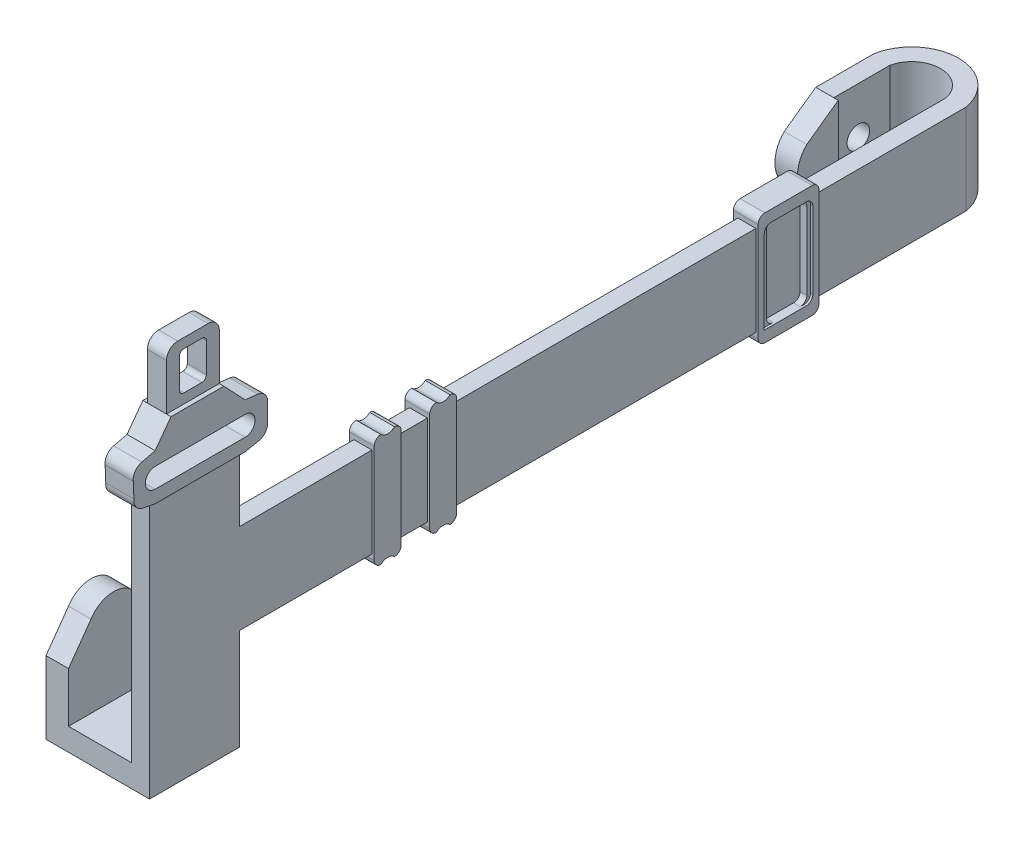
ISO-10303-21;
HEADER;
FILE_DESCRIPTION(('STEP AP214'),'2;1');
FILE_NAME('part.step','',(''),(''),'','','');
FILE_SCHEMA(('AUTOMOTIVE_DESIGN { 1 0 10303 214 1 1 1 1 }'));
ENDSEC;
DATA;
#1=APPLICATION_CONTEXT('core data for automotive mechanical design processes');
#2=APPLICATION_PROTOCOL_DEFINITION('international standard','automotive_design',2000,#1);
#3=PRODUCT_CONTEXT('',#1,'mechanical');
#4=PRODUCT('Part','Part','',(#3));
#5=PRODUCT_RELATED_PRODUCT_CATEGORY('part','',(#4));
#6=PRODUCT_DEFINITION_FORMATION('','',#4);
#7=PRODUCT_DEFINITION_CONTEXT('part definition',#1,'design');
#8=PRODUCT_DEFINITION('design','',#6,#7);
#9=PRODUCT_DEFINITION_SHAPE('','',#8);
#10=(LENGTH_UNIT() NAMED_UNIT(*) SI_UNIT(.MILLI.,.METRE.));
#11=(NAMED_UNIT(*) PLANE_ANGLE_UNIT() SI_UNIT($,.RADIAN.));
#12=(NAMED_UNIT(*) SI_UNIT($,.STERADIAN.) SOLID_ANGLE_UNIT());
#13=UNCERTAINTY_MEASURE_WITH_UNIT(LENGTH_MEASURE(1.E-05),#10,'distance_accuracy_value','');
#14=(GEOMETRIC_REPRESENTATION_CONTEXT(3) GLOBAL_UNCERTAINTY_ASSIGNED_CONTEXT((#13)) GLOBAL_UNIT_ASSIGNED_CONTEXT((#10,
#11,#12)) REPRESENTATION_CONTEXT('',''));
#15=CARTESIAN_POINT('',(0.,0.,0.));
#16=DIRECTION('',(0.,0.,1.));
#17=DIRECTION('',(1.,0.,0.));
#18=AXIS2_PLACEMENT_3D('',#15,#16,#17);
#19=CARTESIAN_POINT('',(-12.5,40.,2.86496189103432));
#20=DIRECTION('',(0.,1.,0.));
#21=DIRECTION('',(1.,0.,0.));
#22=AXIS2_PLACEMENT_3D('',#19,#20,#21);
#23=PLANE('',#22);
#24=DIRECTION('',(0.,0.,-1.));
#25=VECTOR('',#24,1.);
#26=CARTESIAN_POINT('',(0.,40.,0.));
#27=LINE('',#26,#25);
#28=CARTESIAN_POINT('',(0.,40.,322.));
#29=VERTEX_POINT('',#28);
#30=CARTESIAN_POINT('',(0.,40.,263.180473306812));
#31=VERTEX_POINT('',#30);
#32=EDGE_CURVE('E1736',#29,#31,#27,.T.);
#33=ORIENTED_EDGE('',*,*,#32,.F.);
#34=DIRECTION('',(-1.,0.,0.));
#35=VECTOR('',#34,1.);
#36=CARTESIAN_POINT('',(8.00000000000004,40.,322.));
#37=LINE('',#36,#35);
#38=CARTESIAN_POINT('',(8.00000000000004,40.,322.));
#39=VERTEX_POINT('',#38);
#40=EDGE_CURVE('E1172',#39,#29,#37,.T.);
#41=ORIENTED_EDGE('',*,*,#40,.F.);
#42=DIRECTION('',(0.,0.,-1.));
#43=VECTOR('',#42,1.);
#44=CARTESIAN_POINT('',(8.,40.,0.));
#45=LINE('',#44,#43);
#46=CARTESIAN_POINT('',(8.00000000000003,40.,263.180473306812));
#47=VERTEX_POINT('',#46);
#48=EDGE_CURVE('E1743',#39,#47,#45,.T.);
#49=ORIENTED_EDGE('',*,*,#48,.T.);
#50=DIRECTION('',(-1.,0.,0.));
#51=VECTOR('',#50,1.);
#52=CARTESIAN_POINT('',(-12.5,40.,263.180473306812));
#53=LINE('',#52,#51);
#54=EDGE_CURVE('E1472',#47,#31,#53,.T.);
#55=ORIENTED_EDGE('',*,*,#54,.T.);
#56=EDGE_LOOP('',(#33,#41,#49,#55));
#57=FACE_BOUND('',#56,.T.);
#58=ADVANCED_FACE('F41',(#57),#23,.T.);
#59=CARTESIAN_POINT('',(8.,40.,0.));
#60=DIRECTION('',(-1.,0.,0.));
#61=DIRECTION('',(0.,0.,1.));
#62=AXIS2_PLACEMENT_3D('',#59,#60,#61);
#63=PLANE('',#62);
#64=CARTESIAN_POINT('',(8.00000000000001,3.,72.9197046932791));
#65=DIRECTION('',(1.,0.,0.));
#66=DIRECTION('',(0.,0.,-1.));
#67=AXIS2_PLACEMENT_3D('',#64,#65,#66);
#68=CIRCLE('',#67,3.);
#69=CARTESIAN_POINT('',(8.00000000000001,0.,72.9197046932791));
#70=VERTEX_POINT('',#69);
#71=CARTESIAN_POINT('',(8.00000000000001,3.00000000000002,69.9197046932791));
#72=VERTEX_POINT('',#71);
#73=EDGE_CURVE('E1236',#70,#72,#68,.T.);
#74=ORIENTED_EDGE('',*,*,#73,.F.);
#75=DIRECTION('',(0.,0.,-1.));
#76=VECTOR('',#75,1.);
#77=CARTESIAN_POINT('',(8.,0.,0.));
#78=LINE('',#77,#76);
#79=CARTESIAN_POINT('',(8.00000000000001,0.,71.3108628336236));
#80=VERTEX_POINT('',#79);
#81=EDGE_CURVE('E1780',#70,#80,#78,.T.);
#82=ORIENTED_EDGE('',*,*,#81,.T.);
#83=CARTESIAN_POINT('',(8.00000000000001,3.,71.3108628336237));
#84=DIRECTION('',(-1.,0.,0.));
#85=DIRECTION('',(0.,0.,1.));
#86=AXIS2_PLACEMENT_3D('',#83,#84,#85);
#87=CIRCLE('',#86,3.00000000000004);
#88=CARTESIAN_POINT('',(8.00000000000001,3.,68.3108628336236));
#89=VERTEX_POINT('',#88);
#90=EDGE_CURVE('E1824',#80,#89,#87,.F.);
#91=ORIENTED_EDGE('',*,*,#90,.T.);
#92=DIRECTION('',(0.,1.,0.));
#93=VECTOR('',#92,1.);
#94=CARTESIAN_POINT('',(8.00000000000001,40.,68.3108628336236));
#95=LINE('',#94,#93);
#96=CARTESIAN_POINT('',(8.00000000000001,37.,68.3108628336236));
#97=VERTEX_POINT('',#96);
#98=EDGE_CURVE('E1820',#89,#97,#95,.T.);
#99=ORIENTED_EDGE('',*,*,#98,.T.);
#100=CARTESIAN_POINT('',(8.00000000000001,37.,71.3108628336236));
#101=DIRECTION('',(-1.,0.,0.));
#102=DIRECTION('',(0.,0.,1.));
#103=AXIS2_PLACEMENT_3D('',#100,#101,#102);
#104=CIRCLE('',#103,2.99999999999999);
#105=CARTESIAN_POINT('',(8.00000000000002,40.,71.3108628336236));
#106=VERTEX_POINT('',#105);
#107=EDGE_CURVE('E1656',#97,#106,#104,.F.);
#108=ORIENTED_EDGE('',*,*,#107,.T.);
#109=CARTESIAN_POINT('',(8.00000000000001,40.,72.9197046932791));
#110=VERTEX_POINT('',#109);
#111=EDGE_CURVE('E1748',#110,#106,#45,.T.);
#112=ORIENTED_EDGE('',*,*,#111,.F.);
#113=CARTESIAN_POINT('',(8.00000000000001,37.,72.9197046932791));
#114=DIRECTION('',(1.,0.,0.));
#115=DIRECTION('',(0.,0.,1.));
#116=AXIS2_PLACEMENT_3D('',#113,#114,#115);
#117=CIRCLE('',#116,3.);
#118=CARTESIAN_POINT('',(8.00000000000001,37.,69.9197046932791));
#119=VERTEX_POINT('',#118);
#120=EDGE_CURVE('E1244',#119,#110,#117,.T.);
#121=ORIENTED_EDGE('',*,*,#120,.F.);
#122=DIRECTION('',(0.,1.,0.));
#123=VECTOR('',#122,1.);
#124=CARTESIAN_POINT('',(8.00000000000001,37.,69.9197046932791));
#125=LINE('',#124,#123);
#126=EDGE_CURVE('E1240',#72,#119,#125,.T.);
#127=ORIENTED_EDGE('',*,*,#126,.F.);
#128=EDGE_LOOP('',(#74,#82,#91,#99,#108,#112,#121,#127));
#129=FACE_BOUND('',#128,.T.);
#130=ADVANCED_FACE('F1894',(#129),#63,.F.);
#131=CARTESIAN_POINT('',(8.00000000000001,3.,84.9197046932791));
#132=DIRECTION('',(1.,0.,0.));
#133=DIRECTION('',(0.,0.,-1.));
#134=AXIS2_PLACEMENT_3D('',#131,#132,#133);
#135=CIRCLE('',#134,3.);
#136=CARTESIAN_POINT('',(8.00000000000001,3.00000000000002,87.9197046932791));
#137=VERTEX_POINT('',#136);
#138=CARTESIAN_POINT('',(8.00000000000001,0.,84.9197046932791));
#139=VERTEX_POINT('',#138);
#140=EDGE_CURVE('E1198',#137,#139,#135,.T.);
#141=ORIENTED_EDGE('',*,*,#140,.F.);
#142=DIRECTION('',(0.,-1.,0.));
#143=VECTOR('',#142,1.);
#144=CARTESIAN_POINT('',(8.00000000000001,37.,87.9197046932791));
#145=LINE('',#144,#143);
#146=CARTESIAN_POINT('',(8.00000000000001,37.,87.9197046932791));
#147=VERTEX_POINT('',#146);
#148=EDGE_CURVE('E1204',#147,#137,#145,.T.);
#149=ORIENTED_EDGE('',*,*,#148,.F.);
#150=CARTESIAN_POINT('',(8.00000000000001,37.,84.9197046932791));
#151=DIRECTION('',(1.,0.,0.));
#152=DIRECTION('',(0.,0.,-1.));
#153=AXIS2_PLACEMENT_3D('',#150,#151,#152);
#154=CIRCLE('',#153,3.);
#155=CARTESIAN_POINT('',(8.00000000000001,40.,84.9197046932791));
#156=VERTEX_POINT('',#155);
#157=EDGE_CURVE('E1248',#156,#147,#154,.T.);
#158=ORIENTED_EDGE('',*,*,#157,.F.);
#159=CARTESIAN_POINT('',(8.00000000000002,40.,86.889654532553));
#160=VERTEX_POINT('',#159);
#161=EDGE_CURVE('E1749',#160,#156,#45,.T.);
#162=ORIENTED_EDGE('',*,*,#161,.F.);
#163=CARTESIAN_POINT('',(8.00000000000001,37.,86.889654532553));
#164=DIRECTION('',(-1.,0.,0.));
#165=DIRECTION('',(0.,0.,1.));
#166=AXIS2_PLACEMENT_3D('',#163,#164,#165);
#167=CIRCLE('',#166,3.);
#168=CARTESIAN_POINT('',(8.00000000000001,37.,89.889654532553));
#169=VERTEX_POINT('',#168);
#170=EDGE_CURVE('E1648',#160,#169,#167,.F.);
#171=ORIENTED_EDGE('',*,*,#170,.T.);
#172=DIRECTION('',(0.,-1.,0.));
#173=VECTOR('',#172,1.);
#174=CARTESIAN_POINT('',(8.00000000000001,40.,89.889654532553));
#175=LINE('',#174,#173);
#176=CARTESIAN_POINT('',(8.00000000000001,0.,89.889654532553));
#177=VERTEX_POINT('',#176);
#178=EDGE_CURVE('E1816',#169,#177,#175,.T.);
#179=ORIENTED_EDGE('',*,*,#178,.T.);
#180=EDGE_CURVE('E1781',#177,#139,#78,.T.);
#181=ORIENTED_EDGE('',*,*,#180,.T.);
#182=EDGE_LOOP('',(#141,#149,#158,#162,#171,#179,#181));
#183=FACE_BOUND('',#182,.T.);
#184=ADVANCED_FACE('F1902',(#183),#63,.F.);
#185=CARTESIAN_POINT('',(-12.5,0.,2.86496189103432));
#186=DIRECTION('',(0.,1.,0.));
#187=DIRECTION('',(1.,0.,0.));
#188=AXIS2_PLACEMENT_3D('',#185,#186,#187);
#189=PLANE('',#188);
#190=DIRECTION('',(1.,0.,0.));
#191=VECTOR('',#190,1.);
#192=CARTESIAN_POINT('',(-12.5,0.,226.526073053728));
#193=LINE('',#192,#191);
#194=CARTESIAN_POINT('',(0.,0.,226.526073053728));
#195=VERTEX_POINT('',#194);
#196=CARTESIAN_POINT('',(8.00000000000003,0.,226.526073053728));
#197=VERTEX_POINT('',#196);
#198=EDGE_CURVE('E1373',#195,#197,#193,.T.);
#199=ORIENTED_EDGE('',*,*,#198,.F.);
#200=DIRECTION('',(0.,0.,-1.));
#201=VECTOR('',#200,1.);
#202=CARTESIAN_POINT('',(0.,0.,0.));
#203=LINE('',#202,#201);
#204=CARTESIAN_POINT('',(0.,0.,92.5870034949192));
#205=VERTEX_POINT('',#204);
#206=EDGE_CURVE('E1775',#195,#205,#203,.T.);
#207=ORIENTED_EDGE('',*,*,#206,.T.);
#208=DIRECTION('',(-1.,0.,0.));
#209=VECTOR('',#208,1.);
#210=CARTESIAN_POINT('',(-12.5,0.,92.5870034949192));
#211=LINE('',#210,#209);
#212=CARTESIAN_POINT('',(8.00000000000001,0.,92.5870034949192));
#213=VERTEX_POINT('',#212);
#214=EDGE_CURVE('E1682',#213,#205,#211,.T.);
#215=ORIENTED_EDGE('',*,*,#214,.F.);
#216=EDGE_CURVE('E1999',#197,#213,#78,.T.);
#217=ORIENTED_EDGE('',*,*,#216,.F.);
#218=EDGE_LOOP('',(#199,#207,#215,#217));
#219=FACE_BOUND('',#218,.T.);
#220=ADVANCED_FACE('F1911',(#219),#189,.F.);
#221=CARTESIAN_POINT('',(0.,40.,226.526073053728));
#222=VERTEX_POINT('',#221);
#223=CARTESIAN_POINT('',(0.,40.,92.5870034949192));
#224=VERTEX_POINT('',#223);
#225=EDGE_CURVE('E1741',#222,#224,#27,.T.);
#226=ORIENTED_EDGE('',*,*,#225,.F.);
#227=DIRECTION('',(1.,0.,0.));
#228=VECTOR('',#227,1.);
#229=CARTESIAN_POINT('',(-12.5,40.,226.526073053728));
#230=LINE('',#229,#228);
#231=CARTESIAN_POINT('',(8.00000000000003,40.,226.526073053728));
#232=VERTEX_POINT('',#231);
#233=EDGE_CURVE('E1369',#222,#232,#230,.T.);
#234=ORIENTED_EDGE('',*,*,#233,.T.);
#235=CARTESIAN_POINT('',(8.00000000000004,40.,92.5870034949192));
#236=VERTEX_POINT('',#235);
#237=EDGE_CURVE('E1947',#232,#236,#45,.T.);
#238=ORIENTED_EDGE('',*,*,#237,.T.);
#239=DIRECTION('',(-1.,0.,0.));
#240=VECTOR('',#239,1.);
#241=CARTESIAN_POINT('',(-12.5,40.,92.5870034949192));
#242=LINE('',#241,#240);
#243=EDGE_CURVE('E1812',#236,#224,#242,.T.);
#244=ORIENTED_EDGE('',*,*,#243,.T.);
#245=EDGE_LOOP('',(#226,#234,#238,#244));
#246=FACE_BOUND('',#245,.T.);
#247=ADVANCED_FACE('F1897',(#246),#23,.T.);
#248=CARTESIAN_POINT('',(0.,40.,0.));
#249=DIRECTION('',(-1.,0.,0.));
#250=DIRECTION('',(0.,0.,1.));
#251=AXIS2_PLACEMENT_3D('',#248,#249,#250);
#252=PLANE('',#251);
#253=ORIENTED_EDGE('',*,*,#206,.F.);
#254=DIRECTION('',(0.,1.,0.));
#255=VECTOR('',#254,1.);
#256=CARTESIAN_POINT('',(0.,40.,226.526073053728));
#257=LINE('',#256,#255);
#258=EDGE_CURVE('E1377',#195,#222,#257,.T.);
#259=ORIENTED_EDGE('',*,*,#258,.T.);
#260=ORIENTED_EDGE('',*,*,#225,.T.);
#261=DIRECTION('',(0.,-1.,0.));
#262=VECTOR('',#261,1.);
#263=CARTESIAN_POINT('',(0.,40.,92.5870034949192));
#264=LINE('',#263,#262);
#265=EDGE_CURVE('E1678',#224,#205,#264,.T.);
#266=ORIENTED_EDGE('',*,*,#265,.T.);
#267=EDGE_LOOP('',(#253,#259,#260,#266));
#268=FACE_BOUND('',#267,.T.);
#269=ADVANCED_FACE('F1910',(#268),#252,.T.);
#270=DIRECTION('',(0.,1.,0.));
#271=VECTOR('',#270,1.);
#272=CARTESIAN_POINT('',(8.00000000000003,40.,226.526073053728));
#273=LINE('',#272,#271);
#274=EDGE_CURVE('E1840',#197,#232,#273,.T.);
#275=ORIENTED_EDGE('',*,*,#274,.F.);
#276=ORIENTED_EDGE('',*,*,#216,.T.);
#277=DIRECTION('',(0.,-1.,0.));
#278=VECTOR('',#277,1.);
#279=CARTESIAN_POINT('',(8.00000000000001,40.,92.5870034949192));
#280=LINE('',#279,#278);
#281=EDGE_CURVE('E1674',#236,#213,#280,.T.);
#282=ORIENTED_EDGE('',*,*,#281,.F.);
#283=ORIENTED_EDGE('',*,*,#237,.F.);
#284=EDGE_LOOP('',(#275,#276,#282,#283));
#285=FACE_BOUND('',#284,.T.);
#286=ADVANCED_FACE('F1940',(#285),#63,.F.);
#287=CARTESIAN_POINT('',(9.00000000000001,37.,89.889654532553));
#288=DIRECTION('',(0.,0.,-1.));
#289=DIRECTION('',(-1.,0.,0.));
#290=AXIS2_PLACEMENT_3D('',#287,#288,#289);
#291=PLANE('',#290);
#292=ORIENTED_EDGE('',*,*,#178,.F.);
#293=DIRECTION('',(-1.,0.,0.));
#294=VECTOR('',#293,1.);
#295=CARTESIAN_POINT('',(9.00000000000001,37.,89.889654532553));
#296=LINE('',#295,#294);
#297=CARTESIAN_POINT('',(9.00000000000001,37.,89.889654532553));
#298=VERTEX_POINT('',#297);
#299=EDGE_CURVE('E1566',#298,#169,#296,.T.);
#300=ORIENTED_EDGE('',*,*,#299,.F.);
#301=DIRECTION('',(0.,-1.,0.));
#302=VECTOR('',#301,1.);
#303=CARTESIAN_POINT('',(9.00000000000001,37.,89.889654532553));
#304=LINE('',#303,#302);
#305=CARTESIAN_POINT('',(9.00000000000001,0.,89.889654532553));
#306=VERTEX_POINT('',#305);
#307=EDGE_CURVE('E1543',#298,#306,#304,.T.);
#308=ORIENTED_EDGE('',*,*,#307,.T.);
#309=DIRECTION('',(-1.,0.,0.));
#310=VECTOR('',#309,1.);
#311=CARTESIAN_POINT('',(9.00000000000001,0.,89.889654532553));
#312=LINE('',#311,#310);
#313=EDGE_CURVE('E1595',#306,#177,#312,.T.);
#314=ORIENTED_EDGE('',*,*,#313,.T.);
#315=EDGE_LOOP('',(#292,#300,#308,#314));
#316=FACE_BOUND('',#315,.T.);
#317=ADVANCED_FACE('F2757',(#316),#291,.T.);
#318=CARTESIAN_POINT('',(9.00000000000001,0.,71.3108628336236));
#319=DIRECTION('',(0.,1.,0.));
#320=DIRECTION('',(0.,0.,1.));
#321=AXIS2_PLACEMENT_3D('',#318,#319,#320);
#322=PLANE('',#321);
#323=ORIENTED_EDGE('',*,*,#180,.F.);
#324=ORIENTED_EDGE('',*,*,#313,.F.);
#325=DIRECTION('',(0.,0.,-1.));
#326=VECTOR('',#325,1.);
#327=CARTESIAN_POINT('',(9.00000000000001,0.,71.3108628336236));
#328=LINE('',#327,#326);
#329=CARTESIAN_POINT('',(9.00000000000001,0.,71.3108628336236));
#330=VERTEX_POINT('',#329);
#331=EDGE_CURVE('E1546',#306,#330,#328,.T.);
#332=ORIENTED_EDGE('',*,*,#331,.T.);
#333=DIRECTION('',(-1.,0.,0.));
#334=VECTOR('',#333,1.);
#335=CARTESIAN_POINT('',(9.00000000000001,0.,71.3108628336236));
#336=LINE('',#335,#334);
#337=EDGE_CURVE('E1590',#330,#80,#336,.T.);
#338=ORIENTED_EDGE('',*,*,#337,.T.);
#339=ORIENTED_EDGE('',*,*,#81,.F.);
#340=DIRECTION('',(1.,0.,0.));
#341=VECTOR('',#340,1.);
#342=CARTESIAN_POINT('',(5.00000000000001,0.,72.9197046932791));
#343=LINE('',#342,#341);
#344=CARTESIAN_POINT('',(5.00000000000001,0.,72.9197046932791));
#345=VERTEX_POINT('',#344);
#346=EDGE_CURVE('E1274',#345,#70,#343,.T.);
#347=ORIENTED_EDGE('',*,*,#346,.F.);
#348=DIRECTION('',(0.,0.,-1.));
#349=VECTOR('',#348,1.);
#350=CARTESIAN_POINT('',(5.00000000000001,0.,72.9197046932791));
#351=LINE('',#350,#349);
#352=CARTESIAN_POINT('',(5.00000000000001,0.,84.9197046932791));
#353=VERTEX_POINT('',#352);
#354=EDGE_CURVE('E1203',#353,#345,#351,.T.);
#355=ORIENTED_EDGE('',*,*,#354,.F.);
#356=DIRECTION('',(1.,0.,0.));
#357=VECTOR('',#356,1.);
#358=CARTESIAN_POINT('',(5.00000000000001,0.,84.9197046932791));
#359=LINE('',#358,#357);
#360=EDGE_CURVE('E1232',#353,#139,#359,.T.);
#361=ORIENTED_EDGE('',*,*,#360,.T.);
#362=EDGE_LOOP('',(#323,#324,#332,#338,#339,#347,#355,#361));
#363=FACE_BOUND('',#362,.T.);
#364=ADVANCED_FACE('F2752',(#363),#322,.T.);
#365=CARTESIAN_POINT('',(9.00000000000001,3.,71.3108628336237));
#366=DIRECTION('',(-1.,0.,0.));
#367=DIRECTION('',(0.,0.,1.));
#368=AXIS2_PLACEMENT_3D('',#365,#366,#367);
#369=CYLINDRICAL_SURFACE('',#368,3.00000000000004);
#370=ORIENTED_EDGE('',*,*,#90,.F.);
#371=ORIENTED_EDGE('',*,*,#337,.F.);
#372=CARTESIAN_POINT('',(9.00000000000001,3.,71.3108628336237));
#373=DIRECTION('',(1.,0.,0.));
#374=DIRECTION('',(0.,0.,1.));
#375=AXIS2_PLACEMENT_3D('',#372,#373,#374);
#376=CIRCLE('',#375,3.00000000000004);
#377=CARTESIAN_POINT('',(9.00000000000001,3.,68.3108628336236));
#378=VERTEX_POINT('',#377);
#379=EDGE_CURVE('E1549',#330,#378,#376,.T.);
#380=ORIENTED_EDGE('',*,*,#379,.T.);
#381=DIRECTION('',(-1.,0.,0.));
#382=VECTOR('',#381,1.);
#383=CARTESIAN_POINT('',(9.00000000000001,3.,68.3108628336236));
#384=LINE('',#383,#382);
#385=EDGE_CURVE('E1585',#378,#89,#384,.T.);
#386=ORIENTED_EDGE('',*,*,#385,.T.);
#387=EDGE_LOOP('',(#370,#371,#380,#386));
#388=FACE_BOUND('',#387,.T.);
#389=ADVANCED_FACE('F2756',(#388),#369,.F.);
#390=CARTESIAN_POINT('',(9.00000000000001,37.,68.3108628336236));
#391=DIRECTION('',(0.,0.,1.));
#392=DIRECTION('',(1.,0.,0.));
#393=AXIS2_PLACEMENT_3D('',#390,#391,#392);
#394=PLANE('',#393);
#395=ORIENTED_EDGE('',*,*,#98,.F.);
#396=ORIENTED_EDGE('',*,*,#385,.F.);
#397=DIRECTION('',(0.,1.,0.));
#398=VECTOR('',#397,1.);
#399=CARTESIAN_POINT('',(9.00000000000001,37.,68.3108628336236));
#400=LINE('',#399,#398);
#401=CARTESIAN_POINT('',(9.00000000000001,37.,68.3108628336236));
#402=VERTEX_POINT('',#401);
#403=EDGE_CURVE('E1552',#378,#402,#400,.T.);
#404=ORIENTED_EDGE('',*,*,#403,.T.);
#405=DIRECTION('',(-1.,0.,0.));
#406=VECTOR('',#405,1.);
#407=CARTESIAN_POINT('',(9.00000000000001,37.,68.3108628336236));
#408=LINE('',#407,#406);
#409=EDGE_CURVE('E1580',#402,#97,#408,.T.);
#410=ORIENTED_EDGE('',*,*,#409,.T.);
#411=EDGE_LOOP('',(#395,#396,#404,#410));
#412=FACE_BOUND('',#411,.T.);
#413=ADVANCED_FACE('F2742',(#412),#394,.T.);
#414=CARTESIAN_POINT('',(9.00000000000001,40.,71.3108628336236));
#415=DIRECTION('',(0.,-1.,0.));
#416=DIRECTION('',(0.,0.,-1.));
#417=AXIS2_PLACEMENT_3D('',#414,#415,#416);
#418=PLANE('',#417);
#419=ORIENTED_EDGE('',*,*,#161,.T.);
#420=DIRECTION('',(1.,0.,0.));
#421=VECTOR('',#420,1.);
#422=CARTESIAN_POINT('',(5.00000000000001,40.,84.9197046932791));
#423=LINE('',#422,#421);
#424=CARTESIAN_POINT('',(5.00000000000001,40.,84.9197046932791));
#425=VERTEX_POINT('',#424);
#426=EDGE_CURVE('E1262',#425,#156,#423,.T.);
#427=ORIENTED_EDGE('',*,*,#426,.F.);
#428=DIRECTION('',(0.,0.,1.));
#429=VECTOR('',#428,1.);
#430=CARTESIAN_POINT('',(5.00000000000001,40.,72.9197046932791));
#431=LINE('',#430,#429);
#432=CARTESIAN_POINT('',(5.00000000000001,40.,72.9197046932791));
#433=VERTEX_POINT('',#432);
#434=EDGE_CURVE('E1220',#433,#425,#431,.T.);
#435=ORIENTED_EDGE('',*,*,#434,.F.);
#436=DIRECTION('',(1.,0.,0.));
#437=VECTOR('',#436,1.);
#438=CARTESIAN_POINT('',(5.00000000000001,40.,72.9197046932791));
#439=LINE('',#438,#437);
#440=EDGE_CURVE('E1265',#433,#110,#439,.T.);
#441=ORIENTED_EDGE('',*,*,#440,.T.);
#442=ORIENTED_EDGE('',*,*,#111,.T.);
#443=DIRECTION('',(-1.,0.,0.));
#444=VECTOR('',#443,1.);
#445=CARTESIAN_POINT('',(9.00000000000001,40.,71.3108628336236));
#446=LINE('',#445,#444);
#447=CARTESIAN_POINT('',(9.00000000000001,40.,71.3108628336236));
#448=VERTEX_POINT('',#447);
#449=EDGE_CURVE('E1575',#448,#106,#446,.T.);
#450=ORIENTED_EDGE('',*,*,#449,.F.);
#451=DIRECTION('',(0.,0.,1.));
#452=VECTOR('',#451,1.);
#453=CARTESIAN_POINT('',(9.00000000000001,40.,71.3108628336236));
#454=LINE('',#453,#452);
#455=CARTESIAN_POINT('',(9.00000000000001,40.,86.889654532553));
#456=VERTEX_POINT('',#455);
#457=EDGE_CURVE('E1558',#448,#456,#454,.T.);
#458=ORIENTED_EDGE('',*,*,#457,.T.);
#459=DIRECTION('',(-1.,0.,0.));
#460=VECTOR('',#459,1.);
#461=CARTESIAN_POINT('',(9.00000000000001,40.,86.889654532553));
#462=LINE('',#461,#460);
#463=EDGE_CURVE('E1570',#456,#160,#462,.T.);
#464=ORIENTED_EDGE('',*,*,#463,.T.);
#465=EDGE_LOOP('',(#419,#427,#435,#441,#442,#450,#458,#464));
#466=FACE_BOUND('',#465,.T.);
#467=ADVANCED_FACE('F2738',(#466),#418,.T.);
#468=CARTESIAN_POINT('',(9.00000000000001,42.,92.5870034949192));
#469=DIRECTION('',(0.,0.,-1.));
#470=DIRECTION('',(-1.,0.,0.));
#471=AXIS2_PLACEMENT_3D('',#468,#469,#470);
#472=PLANE('',#471);
#473=DIRECTION('',(-1.,0.,0.));
#474=VECTOR('',#473,1.);
#475=CARTESIAN_POINT('',(9.00000000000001,42.,92.5870034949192));
#476=LINE('',#475,#474);
#477=CARTESIAN_POINT('',(9.00000000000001,42.,92.5870034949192));
#478=VERTEX_POINT('',#477);
#479=CARTESIAN_POINT('',(-1.99999999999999,42.,92.5870034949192));
#480=VERTEX_POINT('',#479);
#481=EDGE_CURVE('E1639',#478,#480,#476,.T.);
#482=ORIENTED_EDGE('',*,*,#481,.T.);
#483=DIRECTION('',(0.,-1.,0.));
#484=VECTOR('',#483,1.);
#485=CARTESIAN_POINT('',(-1.99999999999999,42.,92.5870034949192));
#486=LINE('',#485,#484);
#487=CARTESIAN_POINT('',(-1.99999999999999,-2.00000000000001,92.5870034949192));
#488=VERTEX_POINT('',#487);
#489=EDGE_CURVE('E1523',#480,#488,#486,.T.);
#490=ORIENTED_EDGE('',*,*,#489,.T.);
#491=DIRECTION('',(-1.,0.,0.));
#492=VECTOR('',#491,1.);
#493=CARTESIAN_POINT('',(9.00000000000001,-2.00000000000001,92.5870034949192));
#494=LINE('',#493,#492);
#495=CARTESIAN_POINT('',(9.00000000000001,-2.00000000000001,92.5870034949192));
#496=VERTEX_POINT('',#495);
#497=EDGE_CURVE('E1636',#496,#488,#494,.T.);
#498=ORIENTED_EDGE('',*,*,#497,.F.);
#499=DIRECTION('',(0.,-1.,0.));
#500=VECTOR('',#499,1.);
#501=CARTESIAN_POINT('',(9.00000000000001,42.,92.5870034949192));
#502=LINE('',#501,#500);
#503=EDGE_CURVE('E1609',#478,#496,#502,.T.);
#504=ORIENTED_EDGE('',*,*,#503,.F.);
#505=EDGE_LOOP('',(#482,#490,#498,#504));
#506=FACE_BOUND('',#505,.T.);
#507=ORIENTED_EDGE('',*,*,#281,.T.);
#508=ORIENTED_EDGE('',*,*,#214,.T.);
#509=ORIENTED_EDGE('',*,*,#265,.F.);
#510=ORIENTED_EDGE('',*,*,#243,.F.);
#511=EDGE_LOOP('',(#507,#508,#509,#510));
#512=FACE_BOUND('',#511,.T.);
#513=ADVANCED_FACE('F2011',(#506,#512),#472,.F.);
#514=CARTESIAN_POINT('',(9.00000000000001,42.,65.6135138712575));
#515=DIRECTION('',(0.,0.,1.));
#516=DIRECTION('',(0.,-1.,0.));
#517=AXIS2_PLACEMENT_3D('',#514,#515,#516);
#518=PLANE('',#517);
#519=DIRECTION('',(-1.,0.,0.));
#520=VECTOR('',#519,1.);
#521=CARTESIAN_POINT('',(9.00000000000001,-2.,65.6135138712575));
#522=LINE('',#521,#520);
#523=CARTESIAN_POINT('',(9.00000000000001,-2.,65.6135138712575));
#524=VERTEX_POINT('',#523);
#525=CARTESIAN_POINT('',(-1.99999999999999,-2.,65.6135138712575));
#526=VERTEX_POINT('',#525);
#527=EDGE_CURVE('E1627',#524,#526,#522,.T.);
#528=ORIENTED_EDGE('',*,*,#527,.T.);
#529=DIRECTION('',(0.,1.,0.));
#530=VECTOR('',#529,1.);
#531=CARTESIAN_POINT('',(-1.99999999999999,42.,65.6135138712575));
#532=LINE('',#531,#530);
#533=CARTESIAN_POINT('',(-1.99999999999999,42.,65.6135138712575));
#534=VERTEX_POINT('',#533);
#535=EDGE_CURVE('E1539',#526,#534,#532,.T.);
#536=ORIENTED_EDGE('',*,*,#535,.T.);
#537=DIRECTION('',(-1.,0.,0.));
#538=VECTOR('',#537,1.);
#539=CARTESIAN_POINT('',(9.00000000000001,42.,65.6135138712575));
#540=LINE('',#539,#538);
#541=CARTESIAN_POINT('',(9.00000000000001,42.,65.6135138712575));
#542=VERTEX_POINT('',#541);
#543=EDGE_CURVE('E1624',#542,#534,#540,.T.);
#544=ORIENTED_EDGE('',*,*,#543,.F.);
#545=DIRECTION('',(0.,1.,0.));
#546=VECTOR('',#545,1.);
#547=CARTESIAN_POINT('',(9.00000000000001,42.,65.6135138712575));
#548=LINE('',#547,#546);
#549=EDGE_CURVE('E1621',#524,#542,#548,.T.);
#550=ORIENTED_EDGE('',*,*,#549,.F.);
#551=EDGE_LOOP('',(#528,#536,#544,#550));
#552=FACE_BOUND('',#551,.T.);
#553=DIRECTION('',(0.,1.,0.));
#554=VECTOR('',#553,1.);
#555=CARTESIAN_POINT('',(0.,40.,65.6135138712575));
#556=LINE('',#555,#554);
#557=CARTESIAN_POINT('',(0.,0.,65.6135138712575));
#558=VERTEX_POINT('',#557);
#559=CARTESIAN_POINT('',(0.,40.,65.6135138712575));
#560=VERTEX_POINT('',#559);
#561=EDGE_CURVE('E1667',#558,#560,#556,.T.);
#562=ORIENTED_EDGE('',*,*,#561,.F.);
#563=DIRECTION('',(1.,0.,0.));
#564=VECTOR('',#563,1.);
#565=CARTESIAN_POINT('',(-12.5,0.,65.6135138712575));
#566=LINE('',#565,#564);
#567=CARTESIAN_POINT('',(8.00000000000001,0.,65.6135138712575));
#568=VERTEX_POINT('',#567);
#569=EDGE_CURVE('E1671',#558,#568,#566,.T.);
#570=ORIENTED_EDGE('',*,*,#569,.T.);
#571=DIRECTION('',(0.,1.,0.));
#572=VECTOR('',#571,1.);
#573=CARTESIAN_POINT('',(8.00000000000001,40.,65.6135138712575));
#574=LINE('',#573,#572);
#575=CARTESIAN_POINT('',(8.00000000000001,40.,65.6135138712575));
#576=VERTEX_POINT('',#575);
#577=EDGE_CURVE('E1664',#568,#576,#574,.T.);
#578=ORIENTED_EDGE('',*,*,#577,.T.);
#579=DIRECTION('',(1.,0.,0.));
#580=VECTOR('',#579,1.);
#581=CARTESIAN_POINT('',(-12.5,40.,65.6135138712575));
#582=LINE('',#581,#580);
#583=EDGE_CURVE('E1808',#560,#576,#582,.T.);
#584=ORIENTED_EDGE('',*,*,#583,.F.);
#585=EDGE_LOOP('',(#562,#570,#578,#584));
#586=FACE_BOUND('',#585,.T.);
#587=ADVANCED_FACE('F3158',(#552,#586),#518,.F.);
#588=CARTESIAN_POINT('',(9.00000000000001,37.,71.3108628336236));
#589=DIRECTION('',(-1.,0.,0.));
#590=DIRECTION('',(0.,0.,1.));
#591=AXIS2_PLACEMENT_3D('',#588,#589,#590);
#592=CYLINDRICAL_SURFACE('',#591,2.99999999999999);
#593=ORIENTED_EDGE('',*,*,#107,.F.);
#594=ORIENTED_EDGE('',*,*,#409,.F.);
#595=CARTESIAN_POINT('',(9.00000000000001,37.,71.3108628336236));
#596=DIRECTION('',(1.,0.,0.));
#597=DIRECTION('',(0.,0.,1.));
#598=AXIS2_PLACEMENT_3D('',#595,#596,#597);
#599=CIRCLE('',#598,2.99999999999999);
#600=EDGE_CURVE('E1555',#402,#448,#599,.T.);
#601=ORIENTED_EDGE('',*,*,#600,.T.);
#602=ORIENTED_EDGE('',*,*,#449,.T.);
#603=EDGE_LOOP('',(#593,#594,#601,#602));
#604=FACE_BOUND('',#603,.T.);
#605=ADVANCED_FACE('F3062',(#604),#592,.F.);
#606=CARTESIAN_POINT('',(9.00000000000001,37.,86.889654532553));
#607=DIRECTION('',(-1.,0.,0.));
#608=DIRECTION('',(0.,0.,1.));
#609=AXIS2_PLACEMENT_3D('',#606,#607,#608);
#610=CYLINDRICAL_SURFACE('',#609,3.);
#611=ORIENTED_EDGE('',*,*,#170,.F.);
#612=ORIENTED_EDGE('',*,*,#463,.F.);
#613=CARTESIAN_POINT('',(9.00000000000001,37.,86.889654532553));
#614=DIRECTION('',(1.,0.,0.));
#615=DIRECTION('',(0.,0.,1.));
#616=AXIS2_PLACEMENT_3D('',#613,#614,#615);
#617=CIRCLE('',#616,3.);
#618=EDGE_CURVE('E1562',#456,#298,#617,.T.);
#619=ORIENTED_EDGE('',*,*,#618,.T.);
#620=ORIENTED_EDGE('',*,*,#299,.T.);
#621=EDGE_LOOP('',(#611,#612,#619,#620));
#622=FACE_BOUND('',#621,.T.);
#623=ADVANCED_FACE('F3045',(#622),#610,.F.);
#624=CARTESIAN_POINT('',(9.00000000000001,42.,68.6135138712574));
#625=DIRECTION('',(-1.,0.,0.));
#626=DIRECTION('',(0.,0.,1.));
#627=AXIS2_PLACEMENT_3D('',#624,#625,#626);
#628=PLANE('',#627);
#629=CARTESIAN_POINT('',(9.00000000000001,42.,68.6135138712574));
#630=DIRECTION('',(1.,0.,0.));
#631=DIRECTION('',(0.,0.,1.));
#632=AXIS2_PLACEMENT_3D('',#629,#630,#631);
#633=CIRCLE('',#632,2.99999999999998);
#634=CARTESIAN_POINT('',(9.00000000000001,45.,68.6135138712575));
#635=VERTEX_POINT('',#634);
#636=EDGE_CURVE('E1599',#542,#635,#633,.T.);
#637=ORIENTED_EDGE('',*,*,#636,.T.);
#638=DIRECTION('',(0.,0.,1.));
#639=VECTOR('',#638,1.);
#640=CARTESIAN_POINT('',(9.00000000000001,45.,68.6135138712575));
#641=LINE('',#640,#639);
#642=CARTESIAN_POINT('',(9.00000000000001,45.,89.5870034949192));
#643=VERTEX_POINT('',#642);
#644=EDGE_CURVE('E1603',#635,#643,#641,.T.);
#645=ORIENTED_EDGE('',*,*,#644,.T.);
#646=CARTESIAN_POINT('',(9.00000000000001,42.,89.5870034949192));
#647=DIRECTION('',(1.,0.,0.));
#648=DIRECTION('',(0.,0.,-1.));
#649=AXIS2_PLACEMENT_3D('',#646,#647,#648);
#650=CIRCLE('',#649,3.);
#651=EDGE_CURVE('E1606',#643,#478,#650,.T.);
#652=ORIENTED_EDGE('',*,*,#651,.T.);
#653=ORIENTED_EDGE('',*,*,#503,.T.);
#654=CARTESIAN_POINT('',(9.00000000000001,-2.,89.5870034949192));
#655=DIRECTION('',(1.,0.,0.));
#656=DIRECTION('',(0.,0.,-1.));
#657=AXIS2_PLACEMENT_3D('',#654,#655,#656);
#658=CIRCLE('',#657,3.);
#659=CARTESIAN_POINT('',(9.00000000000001,-5.00000000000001,89.5870034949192));
#660=VERTEX_POINT('',#659);
#661=EDGE_CURVE('E1612',#496,#660,#658,.T.);
#662=ORIENTED_EDGE('',*,*,#661,.T.);
#663=DIRECTION('',(0.,0.,-1.));
#664=VECTOR('',#663,1.);
#665=CARTESIAN_POINT('',(9.00000000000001,-5.00000000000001,68.6135138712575));
#666=LINE('',#665,#664);
#667=CARTESIAN_POINT('',(9.00000000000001,-5.00000000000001,68.6135138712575));
#668=VERTEX_POINT('',#667);
#669=EDGE_CURVE('E1615',#660,#668,#666,.T.);
#670=ORIENTED_EDGE('',*,*,#669,.T.);
#671=CARTESIAN_POINT('',(9.00000000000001,-2.,68.6135138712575));
#672=DIRECTION('',(1.,0.,0.));
#673=DIRECTION('',(0.,0.,-1.));
#674=AXIS2_PLACEMENT_3D('',#671,#672,#673);
#675=CIRCLE('',#674,3.00000000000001);
#676=EDGE_CURVE('E1618',#668,#524,#675,.T.);
#677=ORIENTED_EDGE('',*,*,#676,.T.);
#678=ORIENTED_EDGE('',*,*,#549,.T.);
#679=EDGE_LOOP('',(#637,#645,#652,#653,#662,#670,#677,#678));
#680=FACE_BOUND('',#679,.T.);
#681=ORIENTED_EDGE('',*,*,#307,.F.);
#682=ORIENTED_EDGE('',*,*,#618,.F.);
#683=ORIENTED_EDGE('',*,*,#457,.F.);
#684=ORIENTED_EDGE('',*,*,#600,.F.);
#685=ORIENTED_EDGE('',*,*,#403,.F.);
#686=ORIENTED_EDGE('',*,*,#379,.F.);
#687=ORIENTED_EDGE('',*,*,#331,.F.);
#688=EDGE_LOOP('',(#681,#682,#683,#684,#685,#686,#687));
#689=FACE_BOUND('',#688,.T.);
#690=ADVANCED_FACE('F3137',(#680,#689),#628,.F.);
#691=CARTESIAN_POINT('',(9.00000000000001,42.,68.6135138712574));
#692=DIRECTION('',(-1.,0.,0.));
#693=DIRECTION('',(0.,0.,1.));
#694=AXIS2_PLACEMENT_3D('',#691,#692,#693);
#695=CYLINDRICAL_SURFACE('',#694,2.99999999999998);
#696=ORIENTED_EDGE('',*,*,#543,.T.);
#697=CARTESIAN_POINT('',(-1.99999999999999,42.,68.6135138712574));
#698=DIRECTION('',(1.,0.,0.));
#699=DIRECTION('',(0.,0.,1.));
#700=AXIS2_PLACEMENT_3D('',#697,#698,#699);
#701=CIRCLE('',#700,2.99999999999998);
#702=CARTESIAN_POINT('',(-1.99999999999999,45.,68.6135138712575));
#703=VERTEX_POINT('',#702);
#704=EDGE_CURVE('E1511',#534,#703,#701,.T.);
#705=ORIENTED_EDGE('',*,*,#704,.T.);
#706=DIRECTION('',(-1.,0.,0.));
#707=VECTOR('',#706,1.);
#708=CARTESIAN_POINT('',(9.00000000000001,45.,68.6135138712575));
#709=LINE('',#708,#707);
#710=EDGE_CURVE('E1645',#635,#703,#709,.T.);
#711=ORIENTED_EDGE('',*,*,#710,.F.);
#712=ORIENTED_EDGE('',*,*,#636,.F.);
#713=EDGE_LOOP('',(#696,#705,#711,#712));
#714=FACE_BOUND('',#713,.T.);
#715=ADVANCED_FACE('F3129',(#714),#695,.T.);
#716=CARTESIAN_POINT('',(9.00000000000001,45.,68.6135138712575));
#717=DIRECTION('',(0.,-1.,0.));
#718=DIRECTION('',(0.,0.,-1.));
#719=AXIS2_PLACEMENT_3D('',#716,#717,#718);
#720=PLANE('',#719);
#721=ORIENTED_EDGE('',*,*,#710,.T.);
#722=DIRECTION('',(0.,0.,1.));
#723=VECTOR('',#722,1.);
#724=CARTESIAN_POINT('',(-1.99999999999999,45.,68.6135138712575));
#725=LINE('',#724,#723);
#726=CARTESIAN_POINT('',(-1.99999999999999,45.,89.5870034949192));
#727=VERTEX_POINT('',#726);
#728=EDGE_CURVE('E1515',#703,#727,#725,.T.);
#729=ORIENTED_EDGE('',*,*,#728,.T.);
#730=DIRECTION('',(-1.,0.,0.));
#731=VECTOR('',#730,1.);
#732=CARTESIAN_POINT('',(9.00000000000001,45.,89.5870034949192));
#733=LINE('',#732,#731);
#734=EDGE_CURVE('E1642',#643,#727,#733,.T.);
#735=ORIENTED_EDGE('',*,*,#734,.F.);
#736=ORIENTED_EDGE('',*,*,#644,.F.);
#737=EDGE_LOOP('',(#721,#729,#735,#736));
#738=FACE_BOUND('',#737,.T.);
#739=ADVANCED_FACE('F3121',(#738),#720,.F.);
#740=CARTESIAN_POINT('',(9.00000000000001,42.,89.5870034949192));
#741=DIRECTION('',(-1.,0.,0.));
#742=DIRECTION('',(0.,0.,1.));
#743=AXIS2_PLACEMENT_3D('',#740,#741,#742);
#744=CYLINDRICAL_SURFACE('',#743,3.);
#745=ORIENTED_EDGE('',*,*,#734,.T.);
#746=CARTESIAN_POINT('',(-1.99999999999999,42.,89.5870034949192));
#747=DIRECTION('',(1.,0.,0.));
#748=DIRECTION('',(0.,0.,-1.));
#749=AXIS2_PLACEMENT_3D('',#746,#747,#748);
#750=CIRCLE('',#749,3.);
#751=EDGE_CURVE('E1519',#727,#480,#750,.T.);
#752=ORIENTED_EDGE('',*,*,#751,.T.);
#753=ORIENTED_EDGE('',*,*,#481,.F.);
#754=ORIENTED_EDGE('',*,*,#651,.F.);
#755=EDGE_LOOP('',(#745,#752,#753,#754));
#756=FACE_BOUND('',#755,.T.);
#757=ADVANCED_FACE('F3113',(#756),#744,.T.);
#758=CARTESIAN_POINT('',(9.00000000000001,-2.,89.5870034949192));
#759=DIRECTION('',(-1.,0.,0.));
#760=DIRECTION('',(0.,0.,1.));
#761=AXIS2_PLACEMENT_3D('',#758,#759,#760);
#762=CYLINDRICAL_SURFACE('',#761,3.);
#763=ORIENTED_EDGE('',*,*,#497,.T.);
#764=CARTESIAN_POINT('',(-1.99999999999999,-2.,89.5870034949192));
#765=DIRECTION('',(1.,0.,0.));
#766=DIRECTION('',(0.,0.,-1.));
#767=AXIS2_PLACEMENT_3D('',#764,#765,#766);
#768=CIRCLE('',#767,3.);
#769=CARTESIAN_POINT('',(-1.99999999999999,-5.00000000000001,89.5870034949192));
#770=VERTEX_POINT('',#769);
#771=EDGE_CURVE('E1527',#488,#770,#768,.T.);
#772=ORIENTED_EDGE('',*,*,#771,.T.);
#773=DIRECTION('',(-1.,0.,0.));
#774=VECTOR('',#773,1.);
#775=CARTESIAN_POINT('',(9.00000000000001,-5.00000000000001,89.5870034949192));
#776=LINE('',#775,#774);
#777=EDGE_CURVE('E1633',#660,#770,#776,.T.);
#778=ORIENTED_EDGE('',*,*,#777,.F.);
#779=ORIENTED_EDGE('',*,*,#661,.F.);
#780=EDGE_LOOP('',(#763,#772,#778,#779));
#781=FACE_BOUND('',#780,.T.);
#782=ADVANCED_FACE('F3105',(#781),#762,.T.);
#783=CARTESIAN_POINT('',(9.00000000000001,-5.00000000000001,68.6135138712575));
#784=DIRECTION('',(0.,1.,0.));
#785=DIRECTION('',(0.,0.,1.));
#786=AXIS2_PLACEMENT_3D('',#783,#784,#785);
#787=PLANE('',#786);
#788=ORIENTED_EDGE('',*,*,#777,.T.);
#789=DIRECTION('',(0.,0.,-1.));
#790=VECTOR('',#789,1.);
#791=CARTESIAN_POINT('',(-1.99999999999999,-5.00000000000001,68.6135138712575));
#792=LINE('',#791,#790);
#793=CARTESIAN_POINT('',(-1.99999999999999,-5.00000000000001,68.6135138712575));
#794=VERTEX_POINT('',#793);
#795=EDGE_CURVE('E1531',#770,#794,#792,.T.);
#796=ORIENTED_EDGE('',*,*,#795,.T.);
#797=DIRECTION('',(-1.,0.,0.));
#798=VECTOR('',#797,1.);
#799=CARTESIAN_POINT('',(9.00000000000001,-5.00000000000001,68.6135138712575));
#800=LINE('',#799,#798);
#801=EDGE_CURVE('E1630',#668,#794,#800,.T.);
#802=ORIENTED_EDGE('',*,*,#801,.F.);
#803=ORIENTED_EDGE('',*,*,#669,.F.);
#804=EDGE_LOOP('',(#788,#796,#802,#803));
#805=FACE_BOUND('',#804,.T.);
#806=ADVANCED_FACE('F3097',(#805),#787,.F.);
#807=CARTESIAN_POINT('',(9.00000000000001,-2.,68.6135138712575));
#808=DIRECTION('',(-1.,0.,0.));
#809=DIRECTION('',(0.,0.,1.));
#810=AXIS2_PLACEMENT_3D('',#807,#808,#809);
#811=CYLINDRICAL_SURFACE('',#810,3.00000000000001);
#812=ORIENTED_EDGE('',*,*,#801,.T.);
#813=CARTESIAN_POINT('',(-1.99999999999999,-2.,68.6135138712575));
#814=DIRECTION('',(1.,0.,0.));
#815=DIRECTION('',(0.,0.,-1.));
#816=AXIS2_PLACEMENT_3D('',#813,#814,#815);
#817=CIRCLE('',#816,3.00000000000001);
#818=EDGE_CURVE('E1535',#794,#526,#817,.T.);
#819=ORIENTED_EDGE('',*,*,#818,.T.);
#820=ORIENTED_EDGE('',*,*,#527,.F.);
#821=ORIENTED_EDGE('',*,*,#676,.F.);
#822=EDGE_LOOP('',(#812,#819,#820,#821));
#823=FACE_BOUND('',#822,.T.);
#824=ADVANCED_FACE('F3089',(#823),#811,.T.);
#825=CARTESIAN_POINT('',(0.,37.,89.889654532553));
#826=VERTEX_POINT('',#825);
#827=CARTESIAN_POINT('',(-1.99999999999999,37.,89.889654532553));
#828=VERTEX_POINT('',#827);
#829=EDGE_CURVE('E1565',#826,#828,#296,.T.);
#830=ORIENTED_EDGE('',*,*,#829,.F.);
#831=DIRECTION('',(0.,-1.,0.));
#832=VECTOR('',#831,1.);
#833=CARTESIAN_POINT('',(0.,40.,89.889654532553));
#834=LINE('',#833,#832);
#835=CARTESIAN_POINT('',(0.,0.,89.889654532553));
#836=VERTEX_POINT('',#835);
#837=EDGE_CURVE('E1698',#826,#836,#834,.T.);
#838=ORIENTED_EDGE('',*,*,#837,.T.);
#839=CARTESIAN_POINT('',(-1.99999999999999,0.,89.889654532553));
#840=VERTEX_POINT('',#839);
#841=EDGE_CURVE('E1594',#836,#840,#312,.T.);
#842=ORIENTED_EDGE('',*,*,#841,.T.);
#843=DIRECTION('',(0.,-1.,0.));
#844=VECTOR('',#843,1.);
#845=CARTESIAN_POINT('',(-1.99999999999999,37.,89.889654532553));
#846=LINE('',#845,#844);
#847=EDGE_CURVE('E1483',#828,#840,#846,.T.);
#848=ORIENTED_EDGE('',*,*,#847,.F.);
#849=EDGE_LOOP('',(#830,#838,#842,#848));
#850=FACE_BOUND('',#849,.T.);
#851=ADVANCED_FACE('F3082',(#850),#291,.T.);
#852=ORIENTED_EDGE('',*,*,#841,.F.);
#853=DIRECTION('',(0.,0.,-1.));
#854=VECTOR('',#853,1.);
#855=CARTESIAN_POINT('',(0.,0.,0.));
#856=LINE('',#855,#854);
#857=CARTESIAN_POINT('',(0.,0.,71.3108628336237));
#858=VERTEX_POINT('',#857);
#859=EDGE_CURVE('E1694',#836,#858,#856,.T.);
#860=ORIENTED_EDGE('',*,*,#859,.T.);
#861=CARTESIAN_POINT('',(-1.99999999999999,0.,71.3108628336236));
#862=VERTEX_POINT('',#861);
#863=EDGE_CURVE('E1589',#858,#862,#336,.T.);
#864=ORIENTED_EDGE('',*,*,#863,.T.);
#865=DIRECTION('',(0.,0.,-1.));
#866=VECTOR('',#865,1.);
#867=CARTESIAN_POINT('',(-1.99999999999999,0.,71.3108628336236));
#868=LINE('',#867,#866);
#869=EDGE_CURVE('E1487',#840,#862,#868,.T.);
#870=ORIENTED_EDGE('',*,*,#869,.F.);
#871=EDGE_LOOP('',(#852,#860,#864,#870));
#872=FACE_BOUND('',#871,.T.);
#873=ADVANCED_FACE('F2760',(#872),#322,.T.);
#874=ORIENTED_EDGE('',*,*,#863,.F.);
#875=CARTESIAN_POINT('',(0.,3.,71.3108628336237));
#876=DIRECTION('',(-1.,0.,0.));
#877=DIRECTION('',(0.,0.,1.));
#878=AXIS2_PLACEMENT_3D('',#875,#876,#877);
#879=CIRCLE('',#878,3.00000000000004);
#880=CARTESIAN_POINT('',(0.,3.,68.3108628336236));
#881=VERTEX_POINT('',#880);
#882=EDGE_CURVE('E1690',#858,#881,#879,.F.);
#883=ORIENTED_EDGE('',*,*,#882,.T.);
#884=CARTESIAN_POINT('',(-1.99999999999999,3.,68.3108628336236));
#885=VERTEX_POINT('',#884);
#886=EDGE_CURVE('E1584',#881,#885,#384,.T.);
#887=ORIENTED_EDGE('',*,*,#886,.T.);
#888=CARTESIAN_POINT('',(-1.99999999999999,3.,71.3108628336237));
#889=DIRECTION('',(1.,0.,0.));
#890=DIRECTION('',(0.,0.,1.));
#891=AXIS2_PLACEMENT_3D('',#888,#889,#890);
#892=CIRCLE('',#891,3.00000000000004);
#893=EDGE_CURVE('E1491',#862,#885,#892,.T.);
#894=ORIENTED_EDGE('',*,*,#893,.F.);
#895=EDGE_LOOP('',(#874,#883,#887,#894));
#896=FACE_BOUND('',#895,.T.);
#897=ADVANCED_FACE('F3067',(#896),#369,.F.);
#898=ORIENTED_EDGE('',*,*,#886,.F.);
#899=DIRECTION('',(0.,1.,0.));
#900=VECTOR('',#899,1.);
#901=CARTESIAN_POINT('',(0.,40.,68.3108628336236));
#902=LINE('',#901,#900);
#903=CARTESIAN_POINT('',(0.,37.,68.3108628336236));
#904=VERTEX_POINT('',#903);
#905=EDGE_CURVE('E1686',#881,#904,#902,.T.);
#906=ORIENTED_EDGE('',*,*,#905,.T.);
#907=CARTESIAN_POINT('',(-1.99999999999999,37.,68.3108628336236));
#908=VERTEX_POINT('',#907);
#909=EDGE_CURVE('E1579',#904,#908,#408,.T.);
#910=ORIENTED_EDGE('',*,*,#909,.T.);
#911=DIRECTION('',(0.,1.,0.));
#912=VECTOR('',#911,1.);
#913=CARTESIAN_POINT('',(-1.99999999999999,37.,68.3108628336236));
#914=LINE('',#913,#912);
#915=EDGE_CURVE('E1495',#885,#908,#914,.T.);
#916=ORIENTED_EDGE('',*,*,#915,.F.);
#917=EDGE_LOOP('',(#898,#906,#910,#916));
#918=FACE_BOUND('',#917,.T.);
#919=ADVANCED_FACE('F3060',(#918),#394,.T.);
#920=ORIENTED_EDGE('',*,*,#909,.F.);
#921=CARTESIAN_POINT('',(0.,37.,71.3108628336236));
#922=DIRECTION('',(-1.,0.,0.));
#923=DIRECTION('',(0.,0.,1.));
#924=AXIS2_PLACEMENT_3D('',#921,#922,#923);
#925=CIRCLE('',#924,2.99999999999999);
#926=CARTESIAN_POINT('',(0.,40.,71.3108628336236));
#927=VERTEX_POINT('',#926);
#928=EDGE_CURVE('E1660',#904,#927,#925,.F.);
#929=ORIENTED_EDGE('',*,*,#928,.T.);
#930=CARTESIAN_POINT('',(-1.99999999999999,40.,71.3108628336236));
#931=VERTEX_POINT('',#930);
#932=EDGE_CURVE('E1574',#927,#931,#446,.T.);
#933=ORIENTED_EDGE('',*,*,#932,.T.);
#934=CARTESIAN_POINT('',(-1.99999999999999,37.,71.3108628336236));
#935=DIRECTION('',(1.,0.,0.));
#936=DIRECTION('',(0.,0.,1.));
#937=AXIS2_PLACEMENT_3D('',#934,#935,#936);
#938=CIRCLE('',#937,2.99999999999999);
#939=EDGE_CURVE('E1499',#908,#931,#938,.T.);
#940=ORIENTED_EDGE('',*,*,#939,.F.);
#941=EDGE_LOOP('',(#920,#929,#933,#940));
#942=FACE_BOUND('',#941,.T.);
#943=ADVANCED_FACE('F2033',(#942),#592,.F.);
#944=ORIENTED_EDGE('',*,*,#932,.F.);
#945=CARTESIAN_POINT('',(0.,40.,86.889654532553));
#946=VERTEX_POINT('',#945);
#947=EDGE_CURVE('E1742',#946,#927,#27,.T.);
#948=ORIENTED_EDGE('',*,*,#947,.F.);
#949=CARTESIAN_POINT('',(-1.99999999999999,40.,86.889654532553));
#950=VERTEX_POINT('',#949);
#951=EDGE_CURVE('E1569',#946,#950,#462,.T.);
#952=ORIENTED_EDGE('',*,*,#951,.T.);
#953=DIRECTION('',(0.,0.,1.));
#954=VECTOR('',#953,1.);
#955=CARTESIAN_POINT('',(-1.99999999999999,40.,71.3108628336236));
#956=LINE('',#955,#954);
#957=EDGE_CURVE('E1503',#931,#950,#956,.T.);
#958=ORIENTED_EDGE('',*,*,#957,.F.);
#959=EDGE_LOOP('',(#944,#948,#952,#958));
#960=FACE_BOUND('',#959,.T.);
#961=ADVANCED_FACE('F2036',(#960),#418,.T.);
#962=ORIENTED_EDGE('',*,*,#951,.F.);
#963=CARTESIAN_POINT('',(0.,37.,86.889654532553));
#964=DIRECTION('',(-1.,0.,0.));
#965=DIRECTION('',(0.,0.,1.));
#966=AXIS2_PLACEMENT_3D('',#963,#964,#965);
#967=CIRCLE('',#966,3.);
#968=EDGE_CURVE('E1652',#946,#826,#967,.F.);
#969=ORIENTED_EDGE('',*,*,#968,.T.);
#970=ORIENTED_EDGE('',*,*,#829,.T.);
#971=CARTESIAN_POINT('',(-1.99999999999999,37.,86.889654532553));
#972=DIRECTION('',(1.,0.,0.));
#973=DIRECTION('',(0.,0.,1.));
#974=AXIS2_PLACEMENT_3D('',#971,#972,#973);
#975=CIRCLE('',#974,3.);
#976=EDGE_CURVE('E1507',#950,#828,#975,.T.);
#977=ORIENTED_EDGE('',*,*,#976,.F.);
#978=EDGE_LOOP('',(#962,#969,#970,#977));
#979=FACE_BOUND('',#978,.T.);
#980=ADVANCED_FACE('F3033',(#979),#610,.F.);
#981=CARTESIAN_POINT('',(-1.99999999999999,42.,68.6135138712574));
#982=DIRECTION('',(-1.,0.,0.));
#983=DIRECTION('',(0.,0.,1.));
#984=AXIS2_PLACEMENT_3D('',#981,#982,#983);
#985=PLANE('',#984);
#986=ORIENTED_EDGE('',*,*,#847,.T.);
#987=ORIENTED_EDGE('',*,*,#869,.T.);
#988=ORIENTED_EDGE('',*,*,#893,.T.);
#989=ORIENTED_EDGE('',*,*,#915,.T.);
#990=ORIENTED_EDGE('',*,*,#939,.T.);
#991=ORIENTED_EDGE('',*,*,#957,.T.);
#992=ORIENTED_EDGE('',*,*,#976,.T.);
#993=EDGE_LOOP('',(#986,#987,#988,#989,#990,#991,#992));
#994=FACE_BOUND('',#993,.T.);
#995=ORIENTED_EDGE('',*,*,#704,.F.);
#996=ORIENTED_EDGE('',*,*,#535,.F.);
#997=ORIENTED_EDGE('',*,*,#818,.F.);
#998=ORIENTED_EDGE('',*,*,#795,.F.);
#999=ORIENTED_EDGE('',*,*,#771,.F.);
#1000=ORIENTED_EDGE('',*,*,#489,.F.);
#1001=ORIENTED_EDGE('',*,*,#751,.F.);
#1002=ORIENTED_EDGE('',*,*,#728,.F.);
#1003=EDGE_LOOP('',(#995,#996,#997,#998,#999,#1000,#1001,#1002));
#1004=FACE_BOUND('',#1003,.T.);
#1005=ADVANCED_FACE('F3026',(#994,#1004),#985,.T.);
#1006=ORIENTED_EDGE('',*,*,#882,.F.);
#1007=ORIENTED_EDGE('',*,*,#859,.F.);
#1008=ORIENTED_EDGE('',*,*,#837,.F.);
#1009=ORIENTED_EDGE('',*,*,#968,.F.);
#1010=ORIENTED_EDGE('',*,*,#947,.T.);
#1011=ORIENTED_EDGE('',*,*,#928,.F.);
#1012=ORIENTED_EDGE('',*,*,#905,.F.);
#1013=EDGE_LOOP('',(#1006,#1007,#1008,#1009,#1010,#1011,#1012));
#1014=FACE_BOUND('',#1013,.T.);
#1015=ADVANCED_FACE('F2027',(#1014),#252,.T.);
#1016=CARTESIAN_POINT('',(-12.5,40.,2.86496189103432));
#1017=DIRECTION('',(0.,-1.,0.));
#1018=DIRECTION('',(0.,0.,-1.));
#1019=AXIS2_PLACEMENT_3D('',#1016,#1017,#1018);
#1020=CYLINDRICAL_SURFACE('',#1019,12.8241181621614);
#1021=CARTESIAN_POINT('',(-12.5,0.,2.86496189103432));
#1022=DIRECTION('',(0.,1.,0.));
#1023=DIRECTION('',(0.,0.,-1.));
#1024=AXIS2_PLACEMENT_3D('',#1021,#1022,#1023);
#1025=CIRCLE('',#1024,12.8241181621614);
#1026=CARTESIAN_POINT('',(0.,0.,0.));
#1027=VERTEX_POINT('',#1026);
#1028=CARTESIAN_POINT('',(-25.,0.,0.));
#1029=VERTEX_POINT('',#1028);
#1030=EDGE_CURVE('E1764',#1027,#1029,#1025,.T.);
#1031=ORIENTED_EDGE('',*,*,#1030,.F.);
#1032=DIRECTION('',(0.,-1.,0.));
#1033=VECTOR('',#1032,1.);
#1034=CARTESIAN_POINT('',(0.,40.,0.));
#1035=LINE('',#1034,#1033);
#1036=CARTESIAN_POINT('',(0.,40.,0.));
#1037=VERTEX_POINT('',#1036);
#1038=EDGE_CURVE('E1797',#1037,#1027,#1035,.T.);
#1039=ORIENTED_EDGE('',*,*,#1038,.F.);
#1040=CARTESIAN_POINT('',(-12.5,40.,2.86496189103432));
#1041=DIRECTION('',(0.,1.,0.));
#1042=DIRECTION('',(0.,0.,-1.));
#1043=AXIS2_PLACEMENT_3D('',#1040,#1041,#1042);
#1044=CIRCLE('',#1043,12.8241181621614);
#1045=CARTESIAN_POINT('',(-25.,40.,0.));
#1046=VERTEX_POINT('',#1045);
#1047=EDGE_CURVE('E1731',#1037,#1046,#1044,.T.);
#1048=ORIENTED_EDGE('',*,*,#1047,.T.);
#1049=DIRECTION('',(0.,-1.,0.));
#1050=VECTOR('',#1049,1.);
#1051=CARTESIAN_POINT('',(-25.,40.,0.));
#1052=LINE('',#1051,#1050);
#1053=EDGE_CURVE('E1801',#1046,#1029,#1052,.T.);
#1054=ORIENTED_EDGE('',*,*,#1053,.T.);
#1055=EDGE_LOOP('',(#1031,#1039,#1048,#1054));
#1056=FACE_BOUND('',#1055,.T.);
#1057=ADVANCED_FACE('F1970',(#1056),#1020,.F.);
#1058=CARTESIAN_POINT('',(-25.,40.,0.));
#1059=DIRECTION('',(1.,0.,0.));
#1060=DIRECTION('',(0.,0.,-1.));
#1061=AXIS2_PLACEMENT_3D('',#1058,#1059,#1060);
#1062=PLANE('',#1061);
#1063=CARTESIAN_POINT('',(-25.,19.4036814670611,14.0954794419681));
#1064=DIRECTION('',(1.,0.,0.));
#1065=DIRECTION('',(0.,0.,-1.));
#1066=AXIS2_PLACEMENT_3D('',#1063,#1064,#1065);
#1067=CIRCLE('',#1066,5.);
#1068=CARTESIAN_POINT('',(-25.,19.4036814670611,9.0954794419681));
#1069=VERTEX_POINT('',#1068);
#1070=EDGE_CURVE('E1168',#1069,#1069,#1067,.T.);
#1071=ORIENTED_EDGE('',*,*,#1070,.F.);
#1072=EDGE_LOOP('',(#1071));
#1073=FACE_BOUND('',#1072,.T.);
#1074=DIRECTION('',(0.,0.,1.));
#1075=VECTOR('',#1074,1.);
#1076=CARTESIAN_POINT('',(-25.,0.,0.));
#1077=LINE('',#1076,#1075);
#1078=CARTESIAN_POINT('',(-25.,0.,25.));
#1079=VERTEX_POINT('',#1078);
#1080=EDGE_CURVE('E1760',#1029,#1079,#1077,.T.);
#1081=ORIENTED_EDGE('',*,*,#1080,.F.);
#1082=ORIENTED_EDGE('',*,*,#1053,.F.);
#1083=DIRECTION('',(0.,0.,1.));
#1084=VECTOR('',#1083,1.);
#1085=CARTESIAN_POINT('',(-25.,40.,0.));
#1086=LINE('',#1085,#1084);
#1087=CARTESIAN_POINT('',(-25.,40.,25.));
#1088=VERTEX_POINT('',#1087);
#1089=EDGE_CURVE('E1727',#1046,#1088,#1086,.T.);
#1090=ORIENTED_EDGE('',*,*,#1089,.T.);
#1091=DIRECTION('',(0.,-1.,0.));
#1092=VECTOR('',#1091,1.);
#1093=CARTESIAN_POINT('',(-25.,40.,25.));
#1094=LINE('',#1093,#1092);
#1095=EDGE_CURVE('E1804',#1088,#1079,#1094,.T.);
#1096=ORIENTED_EDGE('',*,*,#1095,.T.);
#1097=EDGE_LOOP('',(#1081,#1082,#1090,#1096));
#1098=FACE_BOUND('',#1097,.T.);
#1099=ADVANCED_FACE('F1974',(#1073,#1098),#1062,.T.);
#1100=CARTESIAN_POINT('',(-33.,40.,0.));
#1101=DIRECTION('',(1.,0.,0.));
#1102=DIRECTION('',(0.,0.,-1.));
#1103=AXIS2_PLACEMENT_3D('',#1100,#1101,#1102);
#1104=PLANE('',#1103);
#1105=CARTESIAN_POINT('',(-33.,19.4036814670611,14.0954794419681));
#1106=DIRECTION('',(-1.,0.,0.));
#1107=DIRECTION('',(0.,0.,1.));
#1108=AXIS2_PLACEMENT_3D('',#1105,#1106,#1107);
#1109=CIRCLE('',#1108,5.);
#1110=CARTESIAN_POINT('',(-33.,19.4036814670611,19.0954794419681));
#1111=VERTEX_POINT('',#1110);
#1112=EDGE_CURVE('E1155',#1111,#1111,#1109,.T.);
#1113=ORIENTED_EDGE('',*,*,#1112,.F.);
#1114=EDGE_LOOP('',(#1113));
#1115=FACE_BOUND('',#1114,.T.);
#1116=DIRECTION('',(0.,0.,1.));
#1117=VECTOR('',#1116,1.);
#1118=CARTESIAN_POINT('',(-33.,0.,0.));
#1119=LINE('',#1118,#1117);
#1120=CARTESIAN_POINT('',(-33.,0.,-0.794805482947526));
#1121=VERTEX_POINT('',#1120);
#1122=CARTESIAN_POINT('',(-33.,0.,25.));
#1123=VERTEX_POINT('',#1122);
#1124=EDGE_CURVE('E1718',#1121,#1123,#1119,.T.);
#1125=ORIENTED_EDGE('',*,*,#1124,.T.);
#1126=DIRECTION('',(0.,0.581238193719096,0.813733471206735));
#1127=VECTOR('',#1126,1.);
#1128=CARTESIAN_POINT('',(-33.,0.,25.));
#1129=LINE('',#1128,#1127);
#1130=CARTESIAN_POINT('',(-33.,10.,39.));
#1131=VERTEX_POINT('',#1130);
#1132=EDGE_CURVE('E1030',#1123,#1131,#1129,.T.);
#1133=ORIENTED_EDGE('',*,*,#1132,.T.);
#1134=CARTESIAN_POINT('',(-33.,20.,29.));
#1135=DIRECTION('',(-1.,0.,0.));
#1136=DIRECTION('',(0.,0.,-1.));
#1137=AXIS2_PLACEMENT_3D('',#1134,#1135,#1136);
#1138=CIRCLE('',#1137,14.142135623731);
#1139=CARTESIAN_POINT('',(-33.,30.,39.));
#1140=VERTEX_POINT('',#1139);
#1141=EDGE_CURVE('E1144',#1131,#1140,#1138,.T.);
#1142=ORIENTED_EDGE('',*,*,#1141,.T.);
#1143=DIRECTION('',(0.,0.581238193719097,-0.813733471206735));
#1144=VECTOR('',#1143,1.);
#1145=CARTESIAN_POINT('',(-33.,30.,39.));
#1146=LINE('',#1145,#1144);
#1147=CARTESIAN_POINT('',(-33.,40.,25.));
#1148=VERTEX_POINT('',#1147);
#1149=EDGE_CURVE('E1128',#1140,#1148,#1146,.T.);
#1150=ORIENTED_EDGE('',*,*,#1149,.T.);
#1151=DIRECTION('',(0.,0.,1.));
#1152=VECTOR('',#1151,1.);
#1153=CARTESIAN_POINT('',(-33.,40.,0.));
#1154=LINE('',#1153,#1152);
#1155=CARTESIAN_POINT('',(-33.,40.,-0.794805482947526));
#1156=VERTEX_POINT('',#1155);
#1157=EDGE_CURVE('E1719',#1156,#1148,#1154,.T.);
#1158=ORIENTED_EDGE('',*,*,#1157,.F.);
#1159=DIRECTION('',(0.,-1.,0.));
#1160=VECTOR('',#1159,1.);
#1161=CARTESIAN_POINT('',(-33.,40.,-0.794805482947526));
#1162=LINE('',#1161,#1160);
#1163=EDGE_CURVE('E1752',#1156,#1121,#1162,.T.);
#1164=ORIENTED_EDGE('',*,*,#1163,.T.);
#1165=EDGE_LOOP('',(#1125,#1133,#1142,#1150,#1158,#1164));
#1166=FACE_BOUND('',#1165,.T.);
#1167=ADVANCED_FACE('F43',(#1115,#1166),#1104,.F.);
#1168=CARTESIAN_POINT('',(-12.5,40.,2.86496189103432));
#1169=DIRECTION('',(0.,-1.,0.));
#1170=DIRECTION('',(0.,0.,-1.));
#1171=AXIS2_PLACEMENT_3D('',#1168,#1169,#1170);
#1172=CYLINDRICAL_SURFACE('',#1171,20.8241181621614);
#1173=CARTESIAN_POINT('',(-12.5,0.,2.86496189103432));
#1174=DIRECTION('',(0.,1.,0.));
#1175=DIRECTION('',(1.,0.,0.));
#1176=AXIS2_PLACEMENT_3D('',#1173,#1174,#1175);
#1177=CIRCLE('',#1176,20.8241181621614);
#1178=CARTESIAN_POINT('',(8.,0.,-0.794805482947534));
#1179=VERTEX_POINT('',#1178);
#1180=EDGE_CURVE('E1724',#1179,#1121,#1177,.T.);
#1181=ORIENTED_EDGE('',*,*,#1180,.T.);
#1182=ORIENTED_EDGE('',*,*,#1163,.F.);
#1183=CARTESIAN_POINT('',(-12.5,40.,2.86496189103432));
#1184=DIRECTION('',(0.,1.,0.));
#1185=DIRECTION('',(1.,0.,0.));
#1186=AXIS2_PLACEMENT_3D('',#1183,#1184,#1185);
#1187=CIRCLE('',#1186,20.8241181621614);
#1188=CARTESIAN_POINT('',(8.,40.,-0.794805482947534));
#1189=VERTEX_POINT('',#1188);
#1190=EDGE_CURVE('E1746',#1189,#1156,#1187,.T.);
#1191=ORIENTED_EDGE('',*,*,#1190,.F.);
#1192=DIRECTION('',(0.,-1.,0.));
#1193=VECTOR('',#1192,1.);
#1194=CARTESIAN_POINT('',(8.,40.,-0.794805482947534));
#1195=LINE('',#1194,#1193);
#1196=EDGE_CURVE('E1787',#1189,#1179,#1195,.T.);
#1197=ORIENTED_EDGE('',*,*,#1196,.T.);
#1198=EDGE_LOOP('',(#1181,#1182,#1191,#1197));
#1199=FACE_BOUND('',#1198,.T.);
#1200=ADVANCED_FACE('F1916',(#1199),#1172,.T.);
#1201=EDGE_CURVE('E1735',#560,#1037,#27,.T.);
#1202=ORIENTED_EDGE('',*,*,#1201,.F.);
#1203=ORIENTED_EDGE('',*,*,#583,.T.);
#1204=EDGE_CURVE('E1739',#576,#1189,#45,.T.);
#1205=ORIENTED_EDGE('',*,*,#1204,.T.);
#1206=ORIENTED_EDGE('',*,*,#1190,.T.);
#1207=ORIENTED_EDGE('',*,*,#1157,.T.);
#1208=DIRECTION('',(-1.,0.,0.));
#1209=VECTOR('',#1208,1.);
#1210=CARTESIAN_POINT('',(-25.,40.,25.));
#1211=LINE('',#1210,#1209);
#1212=EDGE_CURVE('E1723',#1088,#1148,#1211,.T.);
#1213=ORIENTED_EDGE('',*,*,#1212,.F.);
#1214=ORIENTED_EDGE('',*,*,#1089,.F.);
#1215=ORIENTED_EDGE('',*,*,#1047,.F.);
#1216=EDGE_LOOP('',(#1202,#1203,#1205,#1206,#1207,#1213,#1214,#1215));
#1217=FACE_BOUND('',#1216,.T.);
#1218=ADVANCED_FACE('F1898',(#1217),#23,.T.);
#1219=ORIENTED_EDGE('',*,*,#577,.F.);
#1220=EDGE_CURVE('E1773',#568,#1179,#78,.T.);
#1221=ORIENTED_EDGE('',*,*,#1220,.T.);
#1222=ORIENTED_EDGE('',*,*,#1196,.F.);
#1223=ORIENTED_EDGE('',*,*,#1204,.F.);
#1224=EDGE_LOOP('',(#1219,#1221,#1222,#1223));
#1225=FACE_BOUND('',#1224,.T.);
#1226=ADVANCED_FACE('F1915',(#1225),#63,.F.);
#1227=EDGE_CURVE('E1768',#558,#1027,#203,.T.);
#1228=ORIENTED_EDGE('',*,*,#1227,.F.);
#1229=ORIENTED_EDGE('',*,*,#561,.T.);
#1230=ORIENTED_EDGE('',*,*,#1201,.T.);
#1231=ORIENTED_EDGE('',*,*,#1038,.T.);
#1232=EDGE_LOOP('',(#1228,#1229,#1230,#1231));
#1233=FACE_BOUND('',#1232,.T.);
#1234=ADVANCED_FACE('F1922',(#1233),#252,.T.);
#1235=ORIENTED_EDGE('',*,*,#569,.F.);
#1236=ORIENTED_EDGE('',*,*,#1227,.T.);
#1237=ORIENTED_EDGE('',*,*,#1030,.T.);
#1238=ORIENTED_EDGE('',*,*,#1080,.T.);
#1239=DIRECTION('',(-1.,0.,0.));
#1240=VECTOR('',#1239,1.);
#1241=CARTESIAN_POINT('',(-25.,0.,25.));
#1242=LINE('',#1241,#1240);
#1243=EDGE_CURVE('E1756',#1079,#1123,#1242,.T.);
#1244=ORIENTED_EDGE('',*,*,#1243,.T.);
#1245=ORIENTED_EDGE('',*,*,#1124,.F.);
#1246=ORIENTED_EDGE('',*,*,#1180,.F.);
#1247=ORIENTED_EDGE('',*,*,#1220,.F.);
#1248=EDGE_LOOP('',(#1235,#1236,#1237,#1238,#1244,#1245,#1246,#1247));
#1249=FACE_BOUND('',#1248,.T.);
#1250=ADVANCED_FACE('F1937',(#1249),#189,.F.);
#1251=CARTESIAN_POINT('',(9.00000000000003,-2.,235.526073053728));
#1252=DIRECTION('',(-1.,0.,0.));
#1253=DIRECTION('',(0.,0.,1.));
#1254=AXIS2_PLACEMENT_3D('',#1251,#1252,#1253);
#1255=CYLINDRICAL_SURFACE('',#1254,3.);
#1256=DIRECTION('',(-1.,0.,0.));
#1257=VECTOR('',#1256,1.);
#1258=CARTESIAN_POINT('',(9.00000000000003,-1.99999999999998,238.526073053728));
#1259=LINE('',#1258,#1257);
#1260=CARTESIAN_POINT('',(9.00000000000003,-1.99999999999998,238.526073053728));
#1261=VERTEX_POINT('',#1260);
#1262=CARTESIAN_POINT('',(-1.99999999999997,-1.99999999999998,238.526073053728));
#1263=VERTEX_POINT('',#1262);
#1264=EDGE_CURVE('E1335',#1261,#1263,#1259,.T.);
#1265=ORIENTED_EDGE('',*,*,#1264,.T.);
#1266=CARTESIAN_POINT('',(-1.99999999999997,-2.,235.526073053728));
#1267=DIRECTION('',(1.,0.,0.));
#1268=DIRECTION('',(0.,0.,-1.));
#1269=AXIS2_PLACEMENT_3D('',#1266,#1267,#1268);
#1270=CIRCLE('',#1269,3.);
#1271=CARTESIAN_POINT('',(-1.99999999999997,-5.,235.526073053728));
#1272=VERTEX_POINT('',#1271);
#1273=EDGE_CURVE('E1257',#1263,#1272,#1270,.T.);
#1274=ORIENTED_EDGE('',*,*,#1273,.T.);
#1275=DIRECTION('',(-1.,0.,0.));
#1276=VECTOR('',#1275,1.);
#1277=CARTESIAN_POINT('',(9.00000000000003,-5.,235.526073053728));
#1278=LINE('',#1277,#1276);
#1279=CARTESIAN_POINT('',(9.00000000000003,-5.,235.526073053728));
#1280=VERTEX_POINT('',#1279);
#1281=EDGE_CURVE('E1356',#1280,#1272,#1278,.T.);
#1282=ORIENTED_EDGE('',*,*,#1281,.F.);
#1283=CARTESIAN_POINT('',(9.00000000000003,-2.,235.526073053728));
#1284=DIRECTION('',(1.,0.,0.));
#1285=DIRECTION('',(0.,0.,-1.));
#1286=AXIS2_PLACEMENT_3D('',#1283,#1284,#1285);
#1287=CIRCLE('',#1286,3.);
#1288=EDGE_CURVE('E1310',#1261,#1280,#1287,.T.);
#1289=ORIENTED_EDGE('',*,*,#1288,.F.);
#1290=EDGE_LOOP('',(#1265,#1274,#1282,#1289));
#1291=FACE_BOUND('',#1290,.T.);
#1292=ADVANCED_FACE('F2625',(#1291),#1255,.T.);
#1293=CARTESIAN_POINT('',(9.00000000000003,-8.,232.526073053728));
#1294=DIRECTION('',(-1.,0.,0.));
#1295=DIRECTION('',(0.,0.,1.));
#1296=AXIS2_PLACEMENT_3D('',#1293,#1294,#1295);
#1297=CYLINDRICAL_SURFACE('',#1296,4.24264068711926);
#1298=ORIENTED_EDGE('',*,*,#1281,.T.);
#1299=CARTESIAN_POINT('',(-1.99999999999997,-8.,232.526073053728));
#1300=DIRECTION('',(-1.,0.,0.));
#1301=DIRECTION('',(0.,0.,-1.));
#1302=AXIS2_PLACEMENT_3D('',#1299,#1300,#1301);
#1303=CIRCLE('',#1302,4.24264068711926);
#1304=CARTESIAN_POINT('',(-1.99999999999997,-5.00000000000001,229.526073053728));
#1305=VERTEX_POINT('',#1304);
#1306=EDGE_CURVE('E1282',#1272,#1305,#1303,.T.);
#1307=ORIENTED_EDGE('',*,*,#1306,.T.);
#1308=DIRECTION('',(-1.,0.,0.));
#1309=VECTOR('',#1308,1.);
#1310=CARTESIAN_POINT('',(9.00000000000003,-5.00000000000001,229.526073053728));
#1311=LINE('',#1310,#1309);
#1312=CARTESIAN_POINT('',(9.00000000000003,-5.00000000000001,229.526073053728));
#1313=VERTEX_POINT('',#1312);
#1314=EDGE_CURVE('E1353',#1313,#1305,#1311,.T.);
#1315=ORIENTED_EDGE('',*,*,#1314,.F.);
#1316=CARTESIAN_POINT('',(9.00000000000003,-8.,232.526073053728));
#1317=DIRECTION('',(-1.,0.,0.));
#1318=DIRECTION('',(0.,0.,-1.));
#1319=AXIS2_PLACEMENT_3D('',#1316,#1317,#1318);
#1320=CIRCLE('',#1319,4.24264068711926);
#1321=EDGE_CURVE('E1314',#1280,#1313,#1320,.T.);
#1322=ORIENTED_EDGE('',*,*,#1321,.F.);
#1323=EDGE_LOOP('',(#1298,#1307,#1315,#1322));
#1324=FACE_BOUND('',#1323,.T.);
#1325=ADVANCED_FACE('F2985',(#1324),#1297,.F.);
#1326=CARTESIAN_POINT('',(9.00000000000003,-2.,229.526073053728));
#1327=DIRECTION('',(-1.,0.,0.));
#1328=DIRECTION('',(0.,0.,1.));
#1329=AXIS2_PLACEMENT_3D('',#1326,#1327,#1328);
#1330=CYLINDRICAL_SURFACE('',#1329,3.);
#1331=ORIENTED_EDGE('',*,*,#1314,.T.);
#1332=CARTESIAN_POINT('',(-1.99999999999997,-2.,229.526073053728));
#1333=DIRECTION('',(1.,0.,0.));
#1334=DIRECTION('',(0.,0.,-1.));
#1335=AXIS2_PLACEMENT_3D('',#1332,#1333,#1334);
#1336=CIRCLE('',#1335,3.);
#1337=CARTESIAN_POINT('',(-1.99999999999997,-1.99999999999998,226.526073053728));
#1338=VERTEX_POINT('',#1337);
#1339=EDGE_CURVE('E1286',#1305,#1338,#1336,.T.);
#1340=ORIENTED_EDGE('',*,*,#1339,.T.);
#1341=DIRECTION('',(-1.,0.,0.));
#1342=VECTOR('',#1341,1.);
#1343=CARTESIAN_POINT('',(9.00000000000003,-1.99999999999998,226.526073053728));
#1344=LINE('',#1343,#1342);
#1345=CARTESIAN_POINT('',(9.00000000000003,-1.99999999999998,226.526073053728));
#1346=VERTEX_POINT('',#1345);
#1347=EDGE_CURVE('E1350',#1346,#1338,#1344,.T.);
#1348=ORIENTED_EDGE('',*,*,#1347,.F.);
#1349=CARTESIAN_POINT('',(9.00000000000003,-2.,229.526073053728));
#1350=DIRECTION('',(1.,0.,0.));
#1351=DIRECTION('',(0.,0.,-1.));
#1352=AXIS2_PLACEMENT_3D('',#1349,#1350,#1351);
#1353=CIRCLE('',#1352,3.);
#1354=EDGE_CURVE('E1317',#1313,#1346,#1353,.T.);
#1355=ORIENTED_EDGE('',*,*,#1354,.F.);
#1356=EDGE_LOOP('',(#1331,#1340,#1348,#1355));
#1357=FACE_BOUND('',#1356,.T.);
#1358=ADVANCED_FACE('F2976',(#1357),#1330,.T.);
#1359=CARTESIAN_POINT('',(9.00000000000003,42.,226.526073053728));
#1360=DIRECTION('',(0.,0.,1.));
#1361=DIRECTION('',(1.,0.,0.));
#1362=AXIS2_PLACEMENT_3D('',#1359,#1360,#1361);
#1363=PLANE('',#1362);
#1364=ORIENTED_EDGE('',*,*,#258,.F.);
#1365=ORIENTED_EDGE('',*,*,#198,.T.);
#1366=ORIENTED_EDGE('',*,*,#274,.T.);
#1367=ORIENTED_EDGE('',*,*,#233,.F.);
#1368=EDGE_LOOP('',(#1364,#1365,#1366,#1367));
#1369=FACE_BOUND('',#1368,.T.);
#1370=ORIENTED_EDGE('',*,*,#1347,.T.);
#1371=DIRECTION('',(0.,1.,0.));
#1372=VECTOR('',#1371,1.);
#1373=CARTESIAN_POINT('',(-1.99999999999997,42.,226.526073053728));
#1374=LINE('',#1373,#1372);
#1375=CARTESIAN_POINT('',(-1.99999999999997,42.,226.526073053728));
#1376=VERTEX_POINT('',#1375);
#1377=EDGE_CURVE('E1290',#1338,#1376,#1374,.T.);
#1378=ORIENTED_EDGE('',*,*,#1377,.T.);
#1379=DIRECTION('',(-1.,0.,0.));
#1380=VECTOR('',#1379,1.);
#1381=CARTESIAN_POINT('',(9.00000000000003,42.,226.526073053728));
#1382=LINE('',#1381,#1380);
#1383=CARTESIAN_POINT('',(9.00000000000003,42.,226.526073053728));
#1384=VERTEX_POINT('',#1383);
#1385=EDGE_CURVE('E1347',#1384,#1376,#1382,.T.);
#1386=ORIENTED_EDGE('',*,*,#1385,.F.);
#1387=DIRECTION('',(0.,1.,0.));
#1388=VECTOR('',#1387,1.);
#1389=CARTESIAN_POINT('',(9.00000000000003,42.,226.526073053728));
#1390=LINE('',#1389,#1388);
#1391=EDGE_CURVE('E1320',#1346,#1384,#1390,.T.);
#1392=ORIENTED_EDGE('',*,*,#1391,.F.);
#1393=EDGE_LOOP('',(#1370,#1378,#1386,#1392));
#1394=FACE_BOUND('',#1393,.T.);
#1395=ADVANCED_FACE('F2019',(#1369,#1394),#1363,.F.);
#1396=CARTESIAN_POINT('',(9.00000000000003,42.,229.526073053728));
#1397=DIRECTION('',(-1.,0.,0.));
#1398=DIRECTION('',(0.,0.,1.));
#1399=AXIS2_PLACEMENT_3D('',#1396,#1397,#1398);
#1400=CYLINDRICAL_SURFACE('',#1399,3.);
#1401=ORIENTED_EDGE('',*,*,#1385,.T.);
#1402=CARTESIAN_POINT('',(-1.99999999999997,42.,229.526073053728));
#1403=DIRECTION('',(1.,0.,0.));
#1404=DIRECTION('',(0.,0.,1.));
#1405=AXIS2_PLACEMENT_3D('',#1402,#1403,#1404);
#1406=CIRCLE('',#1405,3.);
#1407=CARTESIAN_POINT('',(-1.99999999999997,45.,229.526073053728));
#1408=VERTEX_POINT('',#1407);
#1409=EDGE_CURVE('E1294',#1376,#1408,#1406,.T.);
#1410=ORIENTED_EDGE('',*,*,#1409,.T.);
#1411=DIRECTION('',(-1.,0.,0.));
#1412=VECTOR('',#1411,1.);
#1413=CARTESIAN_POINT('',(9.00000000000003,45.,229.526073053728));
#1414=LINE('',#1413,#1412);
#1415=CARTESIAN_POINT('',(9.00000000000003,45.,229.526073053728));
#1416=VERTEX_POINT('',#1415);
#1417=EDGE_CURVE('E1344',#1416,#1408,#1414,.T.);
#1418=ORIENTED_EDGE('',*,*,#1417,.F.);
#1419=CARTESIAN_POINT('',(9.00000000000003,42.,229.526073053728));
#1420=DIRECTION('',(1.,0.,0.));
#1421=DIRECTION('',(0.,0.,1.));
#1422=AXIS2_PLACEMENT_3D('',#1419,#1420,#1421);
#1423=CIRCLE('',#1422,3.);
#1424=EDGE_CURVE('E1323',#1384,#1416,#1423,.T.);
#1425=ORIENTED_EDGE('',*,*,#1424,.F.);
#1426=EDGE_LOOP('',(#1401,#1410,#1418,#1425));
#1427=FACE_BOUND('',#1426,.T.);
#1428=ADVANCED_FACE('F2957',(#1427),#1400,.T.);
#1429=CARTESIAN_POINT('',(9.00000000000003,48.,232.526073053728));
#1430=DIRECTION('',(-1.,0.,0.));
#1431=DIRECTION('',(0.,0.,1.));
#1432=AXIS2_PLACEMENT_3D('',#1429,#1430,#1431);
#1433=CYLINDRICAL_SURFACE('',#1432,4.24264068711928);
#1434=ORIENTED_EDGE('',*,*,#1417,.T.);
#1435=CARTESIAN_POINT('',(-1.99999999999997,48.,232.526073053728));
#1436=DIRECTION('',(-1.,0.,0.));
#1437=DIRECTION('',(0.,0.,-1.));
#1438=AXIS2_PLACEMENT_3D('',#1435,#1436,#1437);
#1439=CIRCLE('',#1438,4.24264068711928);
#1440=CARTESIAN_POINT('',(-1.99999999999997,45.,235.526073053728));
#1441=VERTEX_POINT('',#1440);
#1442=EDGE_CURVE('E1298',#1408,#1441,#1439,.T.);
#1443=ORIENTED_EDGE('',*,*,#1442,.T.);
#1444=DIRECTION('',(-1.,0.,0.));
#1445=VECTOR('',#1444,1.);
#1446=CARTESIAN_POINT('',(9.00000000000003,45.,235.526073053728));
#1447=LINE('',#1446,#1445);
#1448=CARTESIAN_POINT('',(9.00000000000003,45.,235.526073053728));
#1449=VERTEX_POINT('',#1448);
#1450=EDGE_CURVE('E1341',#1449,#1441,#1447,.T.);
#1451=ORIENTED_EDGE('',*,*,#1450,.F.);
#1452=CARTESIAN_POINT('',(9.00000000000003,48.,232.526073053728));
#1453=DIRECTION('',(-1.,0.,0.));
#1454=DIRECTION('',(0.,0.,-1.));
#1455=AXIS2_PLACEMENT_3D('',#1452,#1453,#1454);
#1456=CIRCLE('',#1455,4.24264068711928);
#1457=EDGE_CURVE('E1326',#1416,#1449,#1456,.T.);
#1458=ORIENTED_EDGE('',*,*,#1457,.F.);
#1459=EDGE_LOOP('',(#1434,#1443,#1451,#1458));
#1460=FACE_BOUND('',#1459,.T.);
#1461=ADVANCED_FACE('F2947',(#1460),#1433,.F.);
#1462=CARTESIAN_POINT('',(9.00000000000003,42.,235.526073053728));
#1463=DIRECTION('',(-1.,0.,0.));
#1464=DIRECTION('',(0.,0.,1.));
#1465=AXIS2_PLACEMENT_3D('',#1462,#1463,#1464);
#1466=CYLINDRICAL_SURFACE('',#1465,3.);
#1467=ORIENTED_EDGE('',*,*,#1450,.T.);
#1468=CARTESIAN_POINT('',(-1.99999999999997,42.,235.526073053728));
#1469=DIRECTION('',(1.,0.,0.));
#1470=DIRECTION('',(0.,0.,-1.));
#1471=AXIS2_PLACEMENT_3D('',#1468,#1469,#1470);
#1472=CIRCLE('',#1471,3.);
#1473=CARTESIAN_POINT('',(-1.99999999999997,42.,238.526073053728));
#1474=VERTEX_POINT('',#1473);
#1475=EDGE_CURVE('E1302',#1441,#1474,#1472,.T.);
#1476=ORIENTED_EDGE('',*,*,#1475,.T.);
#1477=DIRECTION('',(-1.,0.,0.));
#1478=VECTOR('',#1477,1.);
#1479=CARTESIAN_POINT('',(9.00000000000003,42.,238.526073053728));
#1480=LINE('',#1479,#1478);
#1481=CARTESIAN_POINT('',(9.00000000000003,42.,238.526073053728));
#1482=VERTEX_POINT('',#1481);
#1483=EDGE_CURVE('E1338',#1482,#1474,#1480,.T.);
#1484=ORIENTED_EDGE('',*,*,#1483,.F.);
#1485=CARTESIAN_POINT('',(9.00000000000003,42.,235.526073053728));
#1486=DIRECTION('',(1.,0.,0.));
#1487=DIRECTION('',(0.,0.,-1.));
#1488=AXIS2_PLACEMENT_3D('',#1485,#1486,#1487);
#1489=CIRCLE('',#1488,3.);
#1490=EDGE_CURVE('E1329',#1449,#1482,#1489,.T.);
#1491=ORIENTED_EDGE('',*,*,#1490,.F.);
#1492=EDGE_LOOP('',(#1467,#1476,#1484,#1491));
#1493=FACE_BOUND('',#1492,.T.);
#1494=ADVANCED_FACE('F2938',(#1493),#1466,.T.);
#1495=CARTESIAN_POINT('',(9.00000000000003,42.,238.526073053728));
#1496=DIRECTION('',(0.,0.,-1.));
#1497=DIRECTION('',(-1.,0.,0.));
#1498=AXIS2_PLACEMENT_3D('',#1495,#1496,#1497);
#1499=PLANE('',#1498);
#1500=DIRECTION('',(0.,-1.,0.));
#1501=VECTOR('',#1500,1.);
#1502=CARTESIAN_POINT('',(0.,40.,238.526073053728));
#1503=LINE('',#1502,#1501);
#1504=CARTESIAN_POINT('',(0.,40.,238.526073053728));
#1505=VERTEX_POINT('',#1504);
#1506=CARTESIAN_POINT('',(0.,0.,238.526073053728));
#1507=VERTEX_POINT('',#1506);
#1508=EDGE_CURVE('E1366',#1505,#1507,#1503,.T.);
#1509=ORIENTED_EDGE('',*,*,#1508,.F.);
#1510=DIRECTION('',(-1.,0.,0.));
#1511=VECTOR('',#1510,1.);
#1512=CARTESIAN_POINT('',(-12.5,40.,238.526073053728));
#1513=LINE('',#1512,#1511);
#1514=CARTESIAN_POINT('',(8.00000000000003,40.,238.526073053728));
#1515=VERTEX_POINT('',#1514);
#1516=EDGE_CURVE('E1359',#1515,#1505,#1513,.T.);
#1517=ORIENTED_EDGE('',*,*,#1516,.F.);
#1518=DIRECTION('',(0.,-1.,0.));
#1519=VECTOR('',#1518,1.);
#1520=CARTESIAN_POINT('',(8.00000000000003,40.,238.526073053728));
#1521=LINE('',#1520,#1519);
#1522=CARTESIAN_POINT('',(8.00000000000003,0.,238.526073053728));
#1523=VERTEX_POINT('',#1522);
#1524=EDGE_CURVE('E1836',#1515,#1523,#1521,.T.);
#1525=ORIENTED_EDGE('',*,*,#1524,.T.);
#1526=DIRECTION('',(-1.,0.,0.));
#1527=VECTOR('',#1526,1.);
#1528=CARTESIAN_POINT('',(-12.5,0.,238.526073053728));
#1529=LINE('',#1528,#1527);
#1530=EDGE_CURVE('E1362',#1523,#1507,#1529,.T.);
#1531=ORIENTED_EDGE('',*,*,#1530,.T.);
#1532=EDGE_LOOP('',(#1509,#1517,#1525,#1531));
#1533=FACE_BOUND('',#1532,.T.);
#1534=ORIENTED_EDGE('',*,*,#1483,.T.);
#1535=DIRECTION('',(0.,-1.,0.));
#1536=VECTOR('',#1535,1.);
#1537=CARTESIAN_POINT('',(-1.99999999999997,42.,238.526073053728));
#1538=LINE('',#1537,#1536);
#1539=EDGE_CURVE('E1306',#1474,#1263,#1538,.T.);
#1540=ORIENTED_EDGE('',*,*,#1539,.T.);
#1541=ORIENTED_EDGE('',*,*,#1264,.F.);
#1542=DIRECTION('',(0.,-1.,0.));
#1543=VECTOR('',#1542,1.);
#1544=CARTESIAN_POINT('',(9.00000000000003,42.,238.526073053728));
#1545=LINE('',#1544,#1543);
#1546=EDGE_CURVE('E1332',#1482,#1261,#1545,.T.);
#1547=ORIENTED_EDGE('',*,*,#1546,.F.);
#1548=EDGE_LOOP('',(#1534,#1540,#1541,#1547));
#1549=FACE_BOUND('',#1548,.T.);
#1550=ADVANCED_FACE('F1950',(#1533,#1549),#1499,.F.);
#1551=CARTESIAN_POINT('',(9.00000000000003,-2.,235.526073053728));
#1552=DIRECTION('',(1.,0.,0.));
#1553=DIRECTION('',(0.,0.,-1.));
#1554=AXIS2_PLACEMENT_3D('',#1551,#1552,#1553);
#1555=PLANE('',#1554);
#1556=ORIENTED_EDGE('',*,*,#1288,.T.);
#1557=ORIENTED_EDGE('',*,*,#1321,.T.);
#1558=ORIENTED_EDGE('',*,*,#1354,.T.);
#1559=ORIENTED_EDGE('',*,*,#1391,.T.);
#1560=ORIENTED_EDGE('',*,*,#1424,.T.);
#1561=ORIENTED_EDGE('',*,*,#1457,.T.);
#1562=ORIENTED_EDGE('',*,*,#1490,.T.);
#1563=ORIENTED_EDGE('',*,*,#1546,.T.);
#1564=EDGE_LOOP('',(#1556,#1557,#1558,#1559,#1560,#1561,#1562,#1563));
#1565=FACE_BOUND('',#1564,.T.);
#1566=ADVANCED_FACE('F2919',(#1565),#1555,.T.);
#1567=CARTESIAN_POINT('',(-1.99999999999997,-2.,235.526073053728));
#1568=DIRECTION('',(1.,0.,0.));
#1569=DIRECTION('',(0.,0.,-1.));
#1570=AXIS2_PLACEMENT_3D('',#1567,#1568,#1569);
#1571=PLANE('',#1570);
#1572=ORIENTED_EDGE('',*,*,#1273,.F.);
#1573=ORIENTED_EDGE('',*,*,#1539,.F.);
#1574=ORIENTED_EDGE('',*,*,#1475,.F.);
#1575=ORIENTED_EDGE('',*,*,#1442,.F.);
#1576=ORIENTED_EDGE('',*,*,#1409,.F.);
#1577=ORIENTED_EDGE('',*,*,#1377,.F.);
#1578=ORIENTED_EDGE('',*,*,#1339,.F.);
#1579=ORIENTED_EDGE('',*,*,#1306,.F.);
#1580=EDGE_LOOP('',(#1572,#1573,#1574,#1575,#1576,#1577,#1578,#1579));
#1581=FACE_BOUND('',#1580,.T.);
#1582=ADVANCED_FACE('F2198',(#1581),#1571,.F.);
#1583=CARTESIAN_POINT('',(8.00000000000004,40.,362.));
#1584=DIRECTION('',(0.,0.,1.));
#1585=DIRECTION('',(1.,0.,0.));
#1586=AXIS2_PLACEMENT_3D('',#1583,#1584,#1585);
#1587=PLANE('',#1586);
#1588=DIRECTION('',(-1.,0.,0.));
#1589=VECTOR('',#1588,1.);
#1590=CARTESIAN_POINT('',(8.00000000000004,-34.88,362.));
#1591=LINE('',#1590,#1589);
#1592=CARTESIAN_POINT('',(0.,-34.88,362.));
#1593=VERTEX_POINT('',#1592);
#1594=CARTESIAN_POINT('',(-28.,-34.88,362.));
#1595=VERTEX_POINT('',#1594);
#1596=EDGE_CURVE('E737',#1593,#1595,#1591,.T.);
#1597=ORIENTED_EDGE('',*,*,#1596,.T.);
#1598=DIRECTION('',(0.,1.,0.));
#1599=VECTOR('',#1598,1.);
#1600=CARTESIAN_POINT('',(-28.,-44.88,362.));
#1601=LINE('',#1600,#1599);
#1602=CARTESIAN_POINT('',(-28.,-12.6399244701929,362.));
#1603=VERTEX_POINT('',#1602);
#1604=EDGE_CURVE('E745',#1595,#1603,#1601,.T.);
#1605=ORIENTED_EDGE('',*,*,#1604,.T.);
#1606=DIRECTION('',(1.,0.,0.));
#1607=VECTOR('',#1606,1.);
#1608=CARTESIAN_POINT('',(-38.,-12.6399244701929,362.));
#1609=LINE('',#1608,#1607);
#1610=CARTESIAN_POINT('',(-38.,-12.6399244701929,362.));
#1611=VERTEX_POINT('',#1610);
#1612=EDGE_CURVE('E726',#1611,#1603,#1609,.T.);
#1613=ORIENTED_EDGE('',*,*,#1612,.F.);
#1614=DIRECTION('',(0.,1.,0.));
#1615=VECTOR('',#1614,1.);
#1616=CARTESIAN_POINT('',(-38.,-44.88,362.));
#1617=LINE('',#1616,#1615);
#1618=CARTESIAN_POINT('',(-38.,-44.88,362.));
#1619=VERTEX_POINT('',#1618);
#1620=EDGE_CURVE('E2048',#1619,#1611,#1617,.T.);
#1621=ORIENTED_EDGE('',*,*,#1620,.F.);
#1622=DIRECTION('',(-1.,0.,0.));
#1623=VECTOR('',#1622,1.);
#1624=CARTESIAN_POINT('',(8.00000000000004,-44.88,362.));
#1625=LINE('',#1624,#1623);
#1626=CARTESIAN_POINT('',(8.00000000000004,-44.88,362.));
#1627=VERTEX_POINT('',#1626);
#1628=EDGE_CURVE('E777',#1627,#1619,#1625,.T.);
#1629=ORIENTED_EDGE('',*,*,#1628,.F.);
#1630=DIRECTION('',(0.,-1.,0.));
#1631=VECTOR('',#1630,1.);
#1632=CARTESIAN_POINT('',(8.00000000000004,40.,362.));
#1633=LINE('',#1632,#1631);
#1634=CARTESIAN_POINT('',(8.00000000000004,70.,362.));
#1635=VERTEX_POINT('',#1634);
#1636=EDGE_CURVE('E1791',#1635,#1627,#1633,.T.);
#1637=ORIENTED_EDGE('',*,*,#1636,.F.);
#1638=DIRECTION('',(1.,0.,0.));
#1639=VECTOR('',#1638,1.);
#1640=CARTESIAN_POINT('',(8.00000000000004,70.,362.));
#1641=LINE('',#1640,#1639);
#1642=CARTESIAN_POINT('',(0.,70.,362.));
#1643=VERTEX_POINT('',#1642);
#1644=EDGE_CURVE('E1185',#1643,#1635,#1641,.T.);
#1645=ORIENTED_EDGE('',*,*,#1644,.F.);
#1646=DIRECTION('',(0.,-1.,0.));
#1647=VECTOR('',#1646,1.);
#1648=CARTESIAN_POINT('',(0.,40.,362.));
#1649=LINE('',#1648,#1647);
#1650=EDGE_CURVE('E1794',#1643,#1593,#1649,.T.);
#1651=ORIENTED_EDGE('',*,*,#1650,.T.);
#1652=EDGE_LOOP('',(#1597,#1605,#1613,#1621,#1629,#1637,#1645,#1651));
#1653=FACE_BOUND('',#1652,.T.);
#1654=ADVANCED_FACE('F752',(#1653),#1587,.T.);
#1655=CARTESIAN_POINT('',(0.,-34.88,322.));
#1656=DIRECTION('',(0.,0.,1.));
#1657=DIRECTION('',(1.,0.,0.));
#1658=AXIS2_PLACEMENT_3D('',#1655,#1656,#1657);
#1659=PLANE('',#1658);
#1660=DIRECTION('',(0.,1.,0.));
#1661=VECTOR('',#1660,1.);
#1662=CARTESIAN_POINT('',(8.00000000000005,-34.88,322.));
#1663=LINE('',#1662,#1661);
#1664=CARTESIAN_POINT('',(8.00000000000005,-44.88,322.));
#1665=VERTEX_POINT('',#1664);
#1666=CARTESIAN_POINT('',(8.00000000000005,0.,322.));
#1667=VERTEX_POINT('',#1666);
#1668=EDGE_CURVE('E1707',#1665,#1667,#1663,.T.);
#1669=ORIENTED_EDGE('',*,*,#1668,.F.);
#1670=DIRECTION('',(1.,0.,0.));
#1671=VECTOR('',#1670,1.);
#1672=CARTESIAN_POINT('',(8.00000000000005,-44.88,322.));
#1673=LINE('',#1672,#1671);
#1674=CARTESIAN_POINT('',(-38.,-44.88,322.));
#1675=VERTEX_POINT('',#1674);
#1676=EDGE_CURVE('E781',#1675,#1665,#1673,.T.);
#1677=ORIENTED_EDGE('',*,*,#1676,.F.);
#1678=DIRECTION('',(0.,-1.,0.));
#1679=VECTOR('',#1678,1.);
#1680=CARTESIAN_POINT('',(-38.,-44.88,322.));
#1681=LINE('',#1680,#1679);
#1682=CARTESIAN_POINT('',(-38.,-12.6399244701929,322.));
#1683=VERTEX_POINT('',#1682);
#1684=EDGE_CURVE('E767',#1683,#1675,#1681,.T.);
#1685=ORIENTED_EDGE('',*,*,#1684,.F.);
#1686=DIRECTION('',(1.,0.,0.));
#1687=VECTOR('',#1686,1.);
#1688=CARTESIAN_POINT('',(-38.,-12.6399244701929,322.));
#1689=LINE('',#1688,#1687);
#1690=CARTESIAN_POINT('',(-28.,-12.6399244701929,322.));
#1691=VERTEX_POINT('',#1690);
#1692=EDGE_CURVE('E738',#1683,#1691,#1689,.T.);
#1693=ORIENTED_EDGE('',*,*,#1692,.T.);
#1694=DIRECTION('',(0.,-1.,0.));
#1695=VECTOR('',#1694,1.);
#1696=CARTESIAN_POINT('',(-28.,-44.88,322.));
#1697=LINE('',#1696,#1695);
#1698=CARTESIAN_POINT('',(-28.,-34.88,322.));
#1699=VERTEX_POINT('',#1698);
#1700=EDGE_CURVE('E756',#1691,#1699,#1697,.T.);
#1701=ORIENTED_EDGE('',*,*,#1700,.T.);
#1702=DIRECTION('',(1.,0.,0.));
#1703=VECTOR('',#1702,1.);
#1704=CARTESIAN_POINT('',(8.00000000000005,-34.88,322.));
#1705=LINE('',#1704,#1703);
#1706=CARTESIAN_POINT('',(0.,-34.88,322.));
#1707=VERTEX_POINT('',#1706);
#1708=EDGE_CURVE('E778',#1699,#1707,#1705,.T.);
#1709=ORIENTED_EDGE('',*,*,#1708,.T.);
#1710=DIRECTION('',(0.,1.,0.));
#1711=VECTOR('',#1710,1.);
#1712=CARTESIAN_POINT('',(0.,-34.88,322.));
#1713=LINE('',#1712,#1711);
#1714=CARTESIAN_POINT('',(0.,0.,322.));
#1715=VERTEX_POINT('',#1714);
#1716=EDGE_CURVE('E1714',#1707,#1715,#1713,.T.);
#1717=ORIENTED_EDGE('',*,*,#1716,.T.);
#1718=DIRECTION('',(1.,0.,0.));
#1719=VECTOR('',#1718,1.);
#1720=CARTESIAN_POINT('',(0.,0.,322.));
#1721=LINE('',#1720,#1719);
#1722=EDGE_CURVE('E1702',#1715,#1667,#1721,.T.);
#1723=ORIENTED_EDGE('',*,*,#1722,.T.);
#1724=EDGE_LOOP('',(#1669,#1677,#1685,#1693,#1701,#1709,#1717,#1723));
#1725=FACE_BOUND('',#1724,.T.);
#1726=ADVANCED_FACE('F2080',(#1725),#1659,.F.);
#1727=DIRECTION('',(-1.,0.,0.));
#1728=VECTOR('',#1727,1.);
#1729=CARTESIAN_POINT('',(-12.5,0.,263.180473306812));
#1730=LINE('',#1729,#1728);
#1731=CARTESIAN_POINT('',(8.00000000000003,0.,263.180473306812));
#1732=VERTEX_POINT('',#1731);
#1733=CARTESIAN_POINT('',(0.,0.,263.180473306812));
#1734=VERTEX_POINT('',#1733);
#1735=EDGE_CURVE('E1476',#1732,#1734,#1730,.T.);
#1736=ORIENTED_EDGE('',*,*,#1735,.F.);
#1737=EDGE_CURVE('E1776',#1667,#1732,#78,.T.);
#1738=ORIENTED_EDGE('',*,*,#1737,.F.);
#1739=ORIENTED_EDGE('',*,*,#1722,.F.);
#1740=EDGE_CURVE('E1769',#1715,#1734,#203,.T.);
#1741=ORIENTED_EDGE('',*,*,#1740,.T.);
#1742=EDGE_LOOP('',(#1736,#1738,#1739,#1741));
#1743=FACE_BOUND('',#1742,.T.);
#1744=ADVANCED_FACE('F2123',(#1743),#189,.F.);
#1745=DIRECTION('',(0.,-1.,0.));
#1746=VECTOR('',#1745,1.);
#1747=CARTESIAN_POINT('',(8.00000000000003,40.,263.180473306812));
#1748=LINE('',#1747,#1746);
#1749=EDGE_CURVE('E1832',#47,#1732,#1748,.T.);
#1750=ORIENTED_EDGE('',*,*,#1749,.F.);
#1751=ORIENTED_EDGE('',*,*,#48,.F.);
#1752=DIRECTION('',(0.,-1.,0.));
#1753=VECTOR('',#1752,1.);
#1754=CARTESIAN_POINT('',(8.00000000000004,70.,322.));
#1755=LINE('',#1754,#1753);
#1756=CARTESIAN_POINT('',(8.00000000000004,70.,322.));
#1757=VERTEX_POINT('',#1756);
#1758=EDGE_CURVE('E1195',#1757,#39,#1755,.T.);
#1759=ORIENTED_EDGE('',*,*,#1758,.F.);
#1760=DIRECTION('',(0.,0.,-1.));
#1761=VECTOR('',#1760,1.);
#1762=CARTESIAN_POINT('',(8.00000000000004,70.,362.));
#1763=LINE('',#1762,#1761);
#1764=EDGE_CURVE('E1173',#1635,#1757,#1763,.T.);
#1765=ORIENTED_EDGE('',*,*,#1764,.F.);
#1766=ORIENTED_EDGE('',*,*,#1636,.T.);
#1767=DIRECTION('',(0.,0.,1.));
#1768=VECTOR('',#1767,1.);
#1769=CARTESIAN_POINT('',(8.00000000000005,-44.88,322.));
#1770=LINE('',#1769,#1768);
#1771=EDGE_CURVE('E773',#1665,#1627,#1770,.T.);
#1772=ORIENTED_EDGE('',*,*,#1771,.F.);
#1773=ORIENTED_EDGE('',*,*,#1668,.T.);
#1774=ORIENTED_EDGE('',*,*,#1737,.T.);
#1775=EDGE_LOOP('',(#1750,#1751,#1759,#1765,#1766,#1772,#1773,#1774));
#1776=FACE_BOUND('',#1775,.T.);
#1777=ADVANCED_FACE('F1905',(#1776),#63,.F.);
#1778=ORIENTED_EDGE('',*,*,#1650,.F.);
#1779=DIRECTION('',(0.,0.,1.));
#1780=VECTOR('',#1779,1.);
#1781=CARTESIAN_POINT('',(0.,70.,362.));
#1782=LINE('',#1781,#1780);
#1783=CARTESIAN_POINT('',(0.,70.,322.));
#1784=VERTEX_POINT('',#1783);
#1785=EDGE_CURVE('E1181',#1784,#1643,#1782,.T.);
#1786=ORIENTED_EDGE('',*,*,#1785,.F.);
#1787=DIRECTION('',(0.,-1.,0.));
#1788=VECTOR('',#1787,1.);
#1789=CARTESIAN_POINT('',(0.,70.,322.));
#1790=LINE('',#1789,#1788);
#1791=EDGE_CURVE('E1189',#1784,#29,#1790,.T.);
#1792=ORIENTED_EDGE('',*,*,#1791,.T.);
#1793=ORIENTED_EDGE('',*,*,#32,.T.);
#1794=DIRECTION('',(0.,-1.,0.));
#1795=VECTOR('',#1794,1.);
#1796=CARTESIAN_POINT('',(0.,40.,263.180473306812));
#1797=LINE('',#1796,#1795);
#1798=EDGE_CURVE('E1480',#31,#1734,#1797,.T.);
#1799=ORIENTED_EDGE('',*,*,#1798,.T.);
#1800=ORIENTED_EDGE('',*,*,#1740,.F.);
#1801=ORIENTED_EDGE('',*,*,#1716,.F.);
#1802=DIRECTION('',(0.,0.,-1.));
#1803=VECTOR('',#1802,1.);
#1804=CARTESIAN_POINT('',(0.,-34.88,362.));
#1805=LINE('',#1804,#1803);
#1806=EDGE_CURVE('E1703',#1593,#1707,#1805,.T.);
#1807=ORIENTED_EDGE('',*,*,#1806,.F.);
#1808=EDGE_LOOP('',(#1778,#1786,#1792,#1793,#1799,#1800,#1801,#1807));
#1809=FACE_BOUND('',#1808,.T.);
#1810=ADVANCED_FACE('F2109',(#1809),#252,.T.);
#1811=CARTESIAN_POINT('',(9.00000000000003,42.,260.180473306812));
#1812=DIRECTION('',(-1.,0.,0.));
#1813=DIRECTION('',(0.,0.,1.));
#1814=AXIS2_PLACEMENT_3D('',#1811,#1812,#1813);
#1815=CYLINDRICAL_SURFACE('',#1814,3.);
#1816=DIRECTION('',(-1.,0.,0.));
#1817=VECTOR('',#1816,1.);
#1818=CARTESIAN_POINT('',(9.00000000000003,45.,260.180473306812));
#1819=LINE('',#1818,#1817);
#1820=CARTESIAN_POINT('',(9.00000000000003,45.,260.180473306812));
#1821=VERTEX_POINT('',#1820);
#1822=CARTESIAN_POINT('',(-1.99999999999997,45.,260.180473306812));
#1823=VERTEX_POINT('',#1822);
#1824=EDGE_CURVE('E1458',#1821,#1823,#1819,.T.);
#1825=ORIENTED_EDGE('',*,*,#1824,.T.);
#1826=CARTESIAN_POINT('',(-1.99999999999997,42.,260.180473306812));
#1827=DIRECTION('',(1.,0.,0.));
#1828=DIRECTION('',(0.,0.,-1.));
#1829=AXIS2_PLACEMENT_3D('',#1826,#1827,#1828);
#1830=CIRCLE('',#1829,3.);
#1831=CARTESIAN_POINT('',(-1.99999999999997,42.,263.180473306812));
#1832=VERTEX_POINT('',#1831);
#1833=EDGE_CURVE('E1384',#1823,#1832,#1830,.T.);
#1834=ORIENTED_EDGE('',*,*,#1833,.T.);
#1835=DIRECTION('',(-1.,0.,0.));
#1836=VECTOR('',#1835,1.);
#1837=CARTESIAN_POINT('',(9.00000000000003,42.,263.180473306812));
#1838=LINE('',#1837,#1836);
#1839=CARTESIAN_POINT('',(9.00000000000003,42.,263.180473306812));
#1840=VERTEX_POINT('',#1839);
#1841=EDGE_CURVE('E1455',#1840,#1832,#1838,.T.);
#1842=ORIENTED_EDGE('',*,*,#1841,.F.);
#1843=CARTESIAN_POINT('',(9.00000000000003,42.,260.180473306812));
#1844=DIRECTION('',(1.,0.,0.));
#1845=DIRECTION('',(0.,0.,-1.));
#1846=AXIS2_PLACEMENT_3D('',#1843,#1844,#1845);
#1847=CIRCLE('',#1846,3.);
#1848=EDGE_CURVE('E1416',#1821,#1840,#1847,.T.);
#1849=ORIENTED_EDGE('',*,*,#1848,.F.);
#1850=EDGE_LOOP('',(#1825,#1834,#1842,#1849));
#1851=FACE_BOUND('',#1850,.T.);
#1852=ADVANCED_FACE('F2215',(#1851),#1815,.T.);
#1853=CARTESIAN_POINT('',(9.00000000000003,42.,263.180473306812));
#1854=DIRECTION('',(0.,0.,-1.));
#1855=DIRECTION('',(-1.,0.,0.));
#1856=AXIS2_PLACEMENT_3D('',#1853,#1854,#1855);
#1857=PLANE('',#1856);
#1858=ORIENTED_EDGE('',*,*,#1798,.F.);
#1859=ORIENTED_EDGE('',*,*,#54,.F.);
#1860=ORIENTED_EDGE('',*,*,#1749,.T.);
#1861=ORIENTED_EDGE('',*,*,#1735,.T.);
#1862=EDGE_LOOP('',(#1858,#1859,#1860,#1861));
#1863=FACE_BOUND('',#1862,.T.);
#1864=ORIENTED_EDGE('',*,*,#1841,.T.);
#1865=DIRECTION('',(0.,-1.,0.));
#1866=VECTOR('',#1865,1.);
#1867=CARTESIAN_POINT('',(-1.99999999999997,42.,263.180473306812));
#1868=LINE('',#1867,#1866);
#1869=CARTESIAN_POINT('',(-1.99999999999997,-1.99999999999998,263.180473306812));
#1870=VERTEX_POINT('',#1869);
#1871=EDGE_CURVE('E1388',#1832,#1870,#1868,.T.);
#1872=ORIENTED_EDGE('',*,*,#1871,.T.);
#1873=DIRECTION('',(-1.,0.,0.));
#1874=VECTOR('',#1873,1.);
#1875=CARTESIAN_POINT('',(9.00000000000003,-1.99999999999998,263.180473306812));
#1876=LINE('',#1875,#1874);
#1877=CARTESIAN_POINT('',(9.00000000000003,-1.99999999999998,263.180473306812));
#1878=VERTEX_POINT('',#1877);
#1879=EDGE_CURVE('E1452',#1878,#1870,#1876,.T.);
#1880=ORIENTED_EDGE('',*,*,#1879,.F.);
#1881=DIRECTION('',(0.,-1.,0.));
#1882=VECTOR('',#1881,1.);
#1883=CARTESIAN_POINT('',(9.00000000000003,42.,263.180473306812));
#1884=LINE('',#1883,#1882);
#1885=EDGE_CURVE('E1419',#1840,#1878,#1884,.T.);
#1886=ORIENTED_EDGE('',*,*,#1885,.F.);
#1887=EDGE_LOOP('',(#1864,#1872,#1880,#1886));
#1888=FACE_BOUND('',#1887,.T.);
#1889=ADVANCED_FACE('F2124',(#1863,#1888),#1857,.F.);
#1890=CARTESIAN_POINT('',(9.00000000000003,-2.,260.180473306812));
#1891=DIRECTION('',(-1.,0.,0.));
#1892=DIRECTION('',(0.,0.,1.));
#1893=AXIS2_PLACEMENT_3D('',#1890,#1891,#1892);
#1894=CYLINDRICAL_SURFACE('',#1893,3.);
#1895=ORIENTED_EDGE('',*,*,#1879,.T.);
#1896=CARTESIAN_POINT('',(-1.99999999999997,-2.,260.180473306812));
#1897=DIRECTION('',(1.,0.,0.));
#1898=DIRECTION('',(0.,0.,-1.));
#1899=AXIS2_PLACEMENT_3D('',#1896,#1897,#1898);
#1900=CIRCLE('',#1899,3.);
#1901=CARTESIAN_POINT('',(-1.99999999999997,-5.00000000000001,260.180473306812));
#1902=VERTEX_POINT('',#1901);
#1903=EDGE_CURVE('E1392',#1870,#1902,#1900,.T.);
#1904=ORIENTED_EDGE('',*,*,#1903,.T.);
#1905=DIRECTION('',(-1.,0.,0.));
#1906=VECTOR('',#1905,1.);
#1907=CARTESIAN_POINT('',(9.00000000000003,-5.00000000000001,260.180473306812));
#1908=LINE('',#1907,#1906);
#1909=CARTESIAN_POINT('',(9.00000000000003,-5.00000000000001,260.180473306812));
#1910=VERTEX_POINT('',#1909);
#1911=EDGE_CURVE('E1449',#1910,#1902,#1908,.T.);
#1912=ORIENTED_EDGE('',*,*,#1911,.F.);
#1913=CARTESIAN_POINT('',(9.00000000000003,-2.,260.180473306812));
#1914=DIRECTION('',(1.,0.,0.));
#1915=DIRECTION('',(0.,0.,-1.));
#1916=AXIS2_PLACEMENT_3D('',#1913,#1914,#1915);
#1917=CIRCLE('',#1916,3.);
#1918=EDGE_CURVE('E1422',#1878,#1910,#1917,.T.);
#1919=ORIENTED_EDGE('',*,*,#1918,.F.);
#1920=EDGE_LOOP('',(#1895,#1904,#1912,#1919));
#1921=FACE_BOUND('',#1920,.T.);
#1922=ADVANCED_FACE('F2879',(#1921),#1894,.T.);
#1923=CARTESIAN_POINT('',(9.00000000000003,48.,257.180473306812));
#1924=DIRECTION('',(-1.,0.,0.));
#1925=DIRECTION('',(0.,0.,1.));
#1926=AXIS2_PLACEMENT_3D('',#1923,#1924,#1925);
#1927=CYLINDRICAL_SURFACE('',#1926,4.24264068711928);
#1928=DIRECTION('',(-1.,0.,0.));
#1929=VECTOR('',#1928,1.);
#1930=CARTESIAN_POINT('',(9.00000000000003,45.,254.180473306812));
#1931=LINE('',#1930,#1929);
#1932=CARTESIAN_POINT('',(9.00000000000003,45.,254.180473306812));
#1933=VERTEX_POINT('',#1932);
#1934=CARTESIAN_POINT('',(-1.99999999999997,45.,254.180473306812));
#1935=VERTEX_POINT('',#1934);
#1936=EDGE_CURVE('E1437',#1933,#1935,#1931,.T.);
#1937=ORIENTED_EDGE('',*,*,#1936,.T.);
#1938=CARTESIAN_POINT('',(-1.99999999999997,48.,257.180473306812));
#1939=DIRECTION('',(-1.,0.,0.));
#1940=DIRECTION('',(0.,0.,1.));
#1941=AXIS2_PLACEMENT_3D('',#1938,#1939,#1940);
#1942=CIRCLE('',#1941,4.24264068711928);
#1943=EDGE_CURVE('E1380',#1935,#1823,#1942,.T.);
#1944=ORIENTED_EDGE('',*,*,#1943,.T.);
#1945=ORIENTED_EDGE('',*,*,#1824,.F.);
#1946=CARTESIAN_POINT('',(9.00000000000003,48.,257.180473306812));
#1947=DIRECTION('',(-1.,0.,0.));
#1948=DIRECTION('',(0.,0.,1.));
#1949=AXIS2_PLACEMENT_3D('',#1946,#1947,#1948);
#1950=CIRCLE('',#1949,4.24264068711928);
#1951=EDGE_CURVE('E1412',#1933,#1821,#1950,.T.);
#1952=ORIENTED_EDGE('',*,*,#1951,.F.);
#1953=EDGE_LOOP('',(#1937,#1944,#1945,#1952));
#1954=FACE_BOUND('',#1953,.T.);
#1955=ADVANCED_FACE('F2869',(#1954),#1927,.F.);
#1956=CARTESIAN_POINT('',(9.00000000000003,-8.00000000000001,257.180473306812));
#1957=DIRECTION('',(-1.,0.,0.));
#1958=DIRECTION('',(0.,0.,1.));
#1959=AXIS2_PLACEMENT_3D('',#1956,#1957,#1958);
#1960=CYLINDRICAL_SURFACE('',#1959,4.24264068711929);
#1961=ORIENTED_EDGE('',*,*,#1911,.T.);
#1962=CARTESIAN_POINT('',(-1.99999999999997,-8.00000000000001,257.180473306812));
#1963=DIRECTION('',(-1.,0.,0.));
#1964=DIRECTION('',(0.,0.,-1.));
#1965=AXIS2_PLACEMENT_3D('',#1962,#1963,#1964);
#1966=CIRCLE('',#1965,4.24264068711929);
#1967=CARTESIAN_POINT('',(-1.99999999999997,-5.,254.180473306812));
#1968=VERTEX_POINT('',#1967);
#1969=EDGE_CURVE('E1396',#1902,#1968,#1966,.T.);
#1970=ORIENTED_EDGE('',*,*,#1969,.T.);
#1971=DIRECTION('',(-1.,0.,0.));
#1972=VECTOR('',#1971,1.);
#1973=CARTESIAN_POINT('',(9.00000000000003,-5.,254.180473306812));
#1974=LINE('',#1973,#1972);
#1975=CARTESIAN_POINT('',(9.00000000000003,-5.,254.180473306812));
#1976=VERTEX_POINT('',#1975);
#1977=EDGE_CURVE('E1446',#1976,#1968,#1974,.T.);
#1978=ORIENTED_EDGE('',*,*,#1977,.F.);
#1979=CARTESIAN_POINT('',(9.00000000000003,-8.00000000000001,257.180473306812));
#1980=DIRECTION('',(-1.,0.,0.));
#1981=DIRECTION('',(0.,0.,-1.));
#1982=AXIS2_PLACEMENT_3D('',#1979,#1980,#1981);
#1983=CIRCLE('',#1982,4.24264068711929);
#1984=EDGE_CURVE('E1425',#1910,#1976,#1983,.T.);
#1985=ORIENTED_EDGE('',*,*,#1984,.F.);
#1986=EDGE_LOOP('',(#1961,#1970,#1978,#1985));
#1987=FACE_BOUND('',#1986,.T.);
#1988=ADVANCED_FACE('F2859',(#1987),#1960,.F.);
#1989=CARTESIAN_POINT('',(9.00000000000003,48.,257.180473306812));
#1990=DIRECTION('',(-1.,0.,0.));
#1991=DIRECTION('',(0.,0.,1.));
#1992=AXIS2_PLACEMENT_3D('',#1989,#1990,#1991);
#1993=PLANE('',#1992);
#1994=ORIENTED_EDGE('',*,*,#1951,.T.);
#1995=ORIENTED_EDGE('',*,*,#1848,.T.);
#1996=ORIENTED_EDGE('',*,*,#1885,.T.);
#1997=ORIENTED_EDGE('',*,*,#1918,.T.);
#1998=ORIENTED_EDGE('',*,*,#1984,.T.);
#1999=CARTESIAN_POINT('',(9.00000000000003,-2.,254.180473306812));
#2000=DIRECTION('',(1.,0.,0.));
#2001=DIRECTION('',(0.,0.,1.));
#2002=AXIS2_PLACEMENT_3D('',#1999,#2000,#2001);
#2003=CIRCLE('',#2002,3.);
#2004=CARTESIAN_POINT('',(9.00000000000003,-1.99999999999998,251.180473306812));
#2005=VERTEX_POINT('',#2004);
#2006=EDGE_CURVE('E1428',#1976,#2005,#2003,.T.);
#2007=ORIENTED_EDGE('',*,*,#2006,.T.);
#2008=DIRECTION('',(0.,1.,0.));
#2009=VECTOR('',#2008,1.);
#2010=CARTESIAN_POINT('',(9.00000000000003,42.,251.180473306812));
#2011=LINE('',#2010,#2009);
#2012=CARTESIAN_POINT('',(9.00000000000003,42.,251.180473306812));
#2013=VERTEX_POINT('',#2012);
#2014=EDGE_CURVE('E1431',#2005,#2013,#2011,.T.);
#2015=ORIENTED_EDGE('',*,*,#2014,.T.);
#2016=CARTESIAN_POINT('',(9.00000000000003,42.,254.180473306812));
#2017=DIRECTION('',(1.,0.,0.));
#2018=DIRECTION('',(0.,0.,1.));
#2019=AXIS2_PLACEMENT_3D('',#2016,#2017,#2018);
#2020=CIRCLE('',#2019,3.);
#2021=EDGE_CURVE('E1434',#2013,#1933,#2020,.T.);
#2022=ORIENTED_EDGE('',*,*,#2021,.T.);
#2023=EDGE_LOOP('',(#1994,#1995,#1996,#1997,#1998,#2007,#2015,#2022));
#2024=FACE_BOUND('',#2023,.T.);
#2025=ADVANCED_FACE('F2849',(#2024),#1993,.F.);
#2026=CARTESIAN_POINT('',(9.00000000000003,42.,254.180473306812));
#2027=DIRECTION('',(-1.,0.,0.));
#2028=DIRECTION('',(0.,0.,1.));
#2029=AXIS2_PLACEMENT_3D('',#2026,#2027,#2028);
#2030=CYLINDRICAL_SURFACE('',#2029,3.);
#2031=DIRECTION('',(-1.,0.,0.));
#2032=VECTOR('',#2031,1.);
#2033=CARTESIAN_POINT('',(9.00000000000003,42.,251.180473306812));
#2034=LINE('',#2033,#2032);
#2035=CARTESIAN_POINT('',(-1.99999999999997,42.,251.180473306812));
#2036=VERTEX_POINT('',#2035);
#2037=EDGE_CURVE('E1440',#2013,#2036,#2034,.T.);
#2038=ORIENTED_EDGE('',*,*,#2037,.T.);
#2039=CARTESIAN_POINT('',(-1.99999999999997,42.,254.180473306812));
#2040=DIRECTION('',(1.,0.,0.));
#2041=DIRECTION('',(0.,0.,1.));
#2042=AXIS2_PLACEMENT_3D('',#2039,#2040,#2041);
#2043=CIRCLE('',#2042,3.);
#2044=EDGE_CURVE('E1408',#2036,#1935,#2043,.T.);
#2045=ORIENTED_EDGE('',*,*,#2044,.T.);
#2046=ORIENTED_EDGE('',*,*,#1936,.F.);
#2047=ORIENTED_EDGE('',*,*,#2021,.F.);
#2048=EDGE_LOOP('',(#2038,#2045,#2046,#2047));
#2049=FACE_BOUND('',#2048,.T.);
#2050=ADVANCED_FACE('F2839',(#2049),#2030,.T.);
#2051=CARTESIAN_POINT('',(-1.99999999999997,48.,257.180473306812));
#2052=DIRECTION('',(-1.,0.,0.));
#2053=DIRECTION('',(0.,0.,1.));
#2054=AXIS2_PLACEMENT_3D('',#2051,#2052,#2053);
#2055=PLANE('',#2054);
#2056=ORIENTED_EDGE('',*,*,#1943,.F.);
#2057=ORIENTED_EDGE('',*,*,#2044,.F.);
#2058=DIRECTION('',(0.,1.,0.));
#2059=VECTOR('',#2058,1.);
#2060=CARTESIAN_POINT('',(-1.99999999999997,42.,251.180473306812));
#2061=LINE('',#2060,#2059);
#2062=CARTESIAN_POINT('',(-1.99999999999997,-1.99999999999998,251.180473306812));
#2063=VERTEX_POINT('',#2062);
#2064=EDGE_CURVE('E1404',#2063,#2036,#2061,.T.);
#2065=ORIENTED_EDGE('',*,*,#2064,.F.);
#2066=CARTESIAN_POINT('',(-1.99999999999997,-2.,254.180473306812));
#2067=DIRECTION('',(1.,0.,0.));
#2068=DIRECTION('',(0.,0.,1.));
#2069=AXIS2_PLACEMENT_3D('',#2066,#2067,#2068);
#2070=CIRCLE('',#2069,3.);
#2071=EDGE_CURVE('E1400',#1968,#2063,#2070,.T.);
#2072=ORIENTED_EDGE('',*,*,#2071,.F.);
#2073=ORIENTED_EDGE('',*,*,#1969,.F.);
#2074=ORIENTED_EDGE('',*,*,#1903,.F.);
#2075=ORIENTED_EDGE('',*,*,#1871,.F.);
#2076=ORIENTED_EDGE('',*,*,#1833,.F.);
#2077=EDGE_LOOP('',(#2056,#2057,#2065,#2072,#2073,#2074,#2075,#2076));
#2078=FACE_BOUND('',#2077,.T.);
#2079=ADVANCED_FACE('F2829',(#2078),#2055,.T.);
#2080=CARTESIAN_POINT('',(9.00000000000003,-2.,254.180473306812));
#2081=DIRECTION('',(-1.,0.,0.));
#2082=DIRECTION('',(0.,0.,1.));
#2083=AXIS2_PLACEMENT_3D('',#2080,#2081,#2082);
#2084=CYLINDRICAL_SURFACE('',#2083,3.);
#2085=ORIENTED_EDGE('',*,*,#1977,.T.);
#2086=ORIENTED_EDGE('',*,*,#2071,.T.);
#2087=DIRECTION('',(-1.,0.,0.));
#2088=VECTOR('',#2087,1.);
#2089=CARTESIAN_POINT('',(9.00000000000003,-1.99999999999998,251.180473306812));
#2090=LINE('',#2089,#2088);
#2091=EDGE_CURVE('E1443',#2005,#2063,#2090,.T.);
#2092=ORIENTED_EDGE('',*,*,#2091,.F.);
#2093=ORIENTED_EDGE('',*,*,#2006,.F.);
#2094=EDGE_LOOP('',(#2085,#2086,#2092,#2093));
#2095=FACE_BOUND('',#2094,.T.);
#2096=ADVANCED_FACE('F2819',(#2095),#2084,.T.);
#2097=CARTESIAN_POINT('',(9.00000000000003,42.,251.180473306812));
#2098=DIRECTION('',(0.,0.,1.));
#2099=DIRECTION('',(1.,0.,0.));
#2100=AXIS2_PLACEMENT_3D('',#2097,#2098,#2099);
#2101=PLANE('',#2100);
#2102=DIRECTION('',(0.,1.,0.));
#2103=VECTOR('',#2102,1.);
#2104=CARTESIAN_POINT('',(0.,40.,251.180473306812));
#2105=LINE('',#2104,#2103);
#2106=CARTESIAN_POINT('',(0.,0.,251.180473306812));
#2107=VERTEX_POINT('',#2106);
#2108=CARTESIAN_POINT('',(0.,40.,251.180473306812));
#2109=VERTEX_POINT('',#2108);
#2110=EDGE_CURVE('E1469',#2107,#2109,#2105,.T.);
#2111=ORIENTED_EDGE('',*,*,#2110,.F.);
#2112=DIRECTION('',(1.,0.,0.));
#2113=VECTOR('',#2112,1.);
#2114=CARTESIAN_POINT('',(-12.5,0.,251.180473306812));
#2115=LINE('',#2114,#2113);
#2116=CARTESIAN_POINT('',(8.00000000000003,0.,251.180473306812));
#2117=VERTEX_POINT('',#2116);
#2118=EDGE_CURVE('E1465',#2107,#2117,#2115,.T.);
#2119=ORIENTED_EDGE('',*,*,#2118,.T.);
#2120=DIRECTION('',(0.,1.,0.));
#2121=VECTOR('',#2120,1.);
#2122=CARTESIAN_POINT('',(8.00000000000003,40.,251.180473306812));
#2123=LINE('',#2122,#2121);
#2124=CARTESIAN_POINT('',(8.00000000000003,40.,251.180473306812));
#2125=VERTEX_POINT('',#2124);
#2126=EDGE_CURVE('E1828',#2117,#2125,#2123,.T.);
#2127=ORIENTED_EDGE('',*,*,#2126,.T.);
#2128=DIRECTION('',(1.,0.,0.));
#2129=VECTOR('',#2128,1.);
#2130=CARTESIAN_POINT('',(-12.5,40.,251.180473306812));
#2131=LINE('',#2130,#2129);
#2132=EDGE_CURVE('E1461',#2109,#2125,#2131,.T.);
#2133=ORIENTED_EDGE('',*,*,#2132,.F.);
#2134=EDGE_LOOP('',(#2111,#2119,#2127,#2133));
#2135=FACE_BOUND('',#2134,.T.);
#2136=ORIENTED_EDGE('',*,*,#2091,.T.);
#2137=ORIENTED_EDGE('',*,*,#2064,.T.);
#2138=ORIENTED_EDGE('',*,*,#2037,.F.);
#2139=ORIENTED_EDGE('',*,*,#2014,.F.);
#2140=EDGE_LOOP('',(#2136,#2137,#2138,#2139));
#2141=FACE_BOUND('',#2140,.T.);
#2142=ADVANCED_FACE('F2809',(#2135,#2141),#2101,.F.);
#2143=EDGE_CURVE('E1740',#2109,#1505,#27,.T.);
#2144=ORIENTED_EDGE('',*,*,#2143,.T.);
#2145=ORIENTED_EDGE('',*,*,#1508,.T.);
#2146=EDGE_CURVE('E1774',#2107,#1507,#203,.T.);
#2147=ORIENTED_EDGE('',*,*,#2146,.F.);
#2148=ORIENTED_EDGE('',*,*,#2110,.T.);
#2149=EDGE_LOOP('',(#2144,#2145,#2147,#2148));
#2150=FACE_BOUND('',#2149,.T.);
#2151=ADVANCED_FACE('F1938',(#2150),#252,.T.);
#2152=ORIENTED_EDGE('',*,*,#1524,.F.);
#2153=EDGE_CURVE('E1747',#2125,#1515,#45,.T.);
#2154=ORIENTED_EDGE('',*,*,#2153,.F.);
#2155=ORIENTED_EDGE('',*,*,#2126,.F.);
#2156=EDGE_CURVE('E1779',#2117,#1523,#78,.T.);
#2157=ORIENTED_EDGE('',*,*,#2156,.T.);
#2158=EDGE_LOOP('',(#2152,#2154,#2155,#2157));
#2159=FACE_BOUND('',#2158,.T.);
#2160=ADVANCED_FACE('F1924',(#2159),#63,.F.);
#2161=ORIENTED_EDGE('',*,*,#2153,.T.);
#2162=ORIENTED_EDGE('',*,*,#1516,.T.);
#2163=ORIENTED_EDGE('',*,*,#2143,.F.);
#2164=ORIENTED_EDGE('',*,*,#2132,.T.);
#2165=EDGE_LOOP('',(#2161,#2162,#2163,#2164));
#2166=FACE_BOUND('',#2165,.T.);
#2167=ADVANCED_FACE('F1913',(#2166),#23,.T.);
#2168=ORIENTED_EDGE('',*,*,#1530,.F.);
#2169=ORIENTED_EDGE('',*,*,#2156,.F.);
#2170=ORIENTED_EDGE('',*,*,#2118,.F.);
#2171=ORIENTED_EDGE('',*,*,#2146,.T.);
#2172=EDGE_LOOP('',(#2168,#2169,#2170,#2171));
#2173=FACE_BOUND('',#2172,.T.);
#2174=ADVANCED_FACE('F1929',(#2173),#189,.F.);
#2175=CARTESIAN_POINT('',(5.00000000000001,3.,84.9197046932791));
#2176=DIRECTION('',(1.,0.,0.));
#2177=DIRECTION('',(0.,0.,-1.));
#2178=AXIS2_PLACEMENT_3D('',#2175,#2176,#2177);
#2179=CYLINDRICAL_SURFACE('',#2178,3.);
#2180=ORIENTED_EDGE('',*,*,#140,.T.);
#2181=ORIENTED_EDGE('',*,*,#360,.F.);
#2182=CARTESIAN_POINT('',(5.00000000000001,3.,84.9197046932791));
#2183=DIRECTION('',(1.,0.,0.));
#2184=DIRECTION('',(0.,0.,-1.));
#2185=AXIS2_PLACEMENT_3D('',#2182,#2183,#2184);
#2186=CIRCLE('',#2185,3.);
#2187=CARTESIAN_POINT('',(5.00000000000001,3.00000000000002,87.9197046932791));
#2188=VERTEX_POINT('',#2187);
#2189=EDGE_CURVE('E1199',#2188,#353,#2186,.T.);
#2190=ORIENTED_EDGE('',*,*,#2189,.F.);
#2191=DIRECTION('',(1.,0.,0.));
#2192=VECTOR('',#2191,1.);
#2193=CARTESIAN_POINT('',(5.00000000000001,3.00000000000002,87.9197046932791));
#2194=LINE('',#2193,#2192);
#2195=EDGE_CURVE('E1254',#2188,#137,#2194,.T.);
#2196=ORIENTED_EDGE('',*,*,#2195,.T.);
#2197=EDGE_LOOP('',(#2180,#2181,#2190,#2196));
#2198=FACE_BOUND('',#2197,.T.);
#2199=ADVANCED_FACE('F1935',(#2198),#2179,.F.);
#2200=CARTESIAN_POINT('',(5.00000000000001,37.,87.9197046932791));
#2201=DIRECTION('',(0.,0.,1.));
#2202=DIRECTION('',(1.,0.,0.));
#2203=AXIS2_PLACEMENT_3D('',#2200,#2201,#2202);
#2204=PLANE('',#2203);
#2205=ORIENTED_EDGE('',*,*,#148,.T.);
#2206=ORIENTED_EDGE('',*,*,#2195,.F.);
#2207=DIRECTION('',(0.,-1.,0.));
#2208=VECTOR('',#2207,1.);
#2209=CARTESIAN_POINT('',(5.00000000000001,37.,87.9197046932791));
#2210=LINE('',#2209,#2208);
#2211=CARTESIAN_POINT('',(5.00000000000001,37.,87.9197046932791));
#2212=VERTEX_POINT('',#2211);
#2213=EDGE_CURVE('E1228',#2212,#2188,#2210,.T.);
#2214=ORIENTED_EDGE('',*,*,#2213,.F.);
#2215=DIRECTION('',(1.,0.,0.));
#2216=VECTOR('',#2215,1.);
#2217=CARTESIAN_POINT('',(5.00000000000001,37.,87.9197046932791));
#2218=LINE('',#2217,#2216);
#2219=EDGE_CURVE('E1258',#2212,#147,#2218,.T.);
#2220=ORIENTED_EDGE('',*,*,#2219,.T.);
#2221=EDGE_LOOP('',(#2205,#2206,#2214,#2220));
#2222=FACE_BOUND('',#2221,.T.);
#2223=ADVANCED_FACE('F2713',(#2222),#2204,.F.);
#2224=CARTESIAN_POINT('',(5.00000000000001,37.,84.9197046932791));
#2225=DIRECTION('',(1.,0.,0.));
#2226=DIRECTION('',(0.,0.,-1.));
#2227=AXIS2_PLACEMENT_3D('',#2224,#2225,#2226);
#2228=CYLINDRICAL_SURFACE('',#2227,3.);
#2229=ORIENTED_EDGE('',*,*,#157,.T.);
#2230=ORIENTED_EDGE('',*,*,#2219,.F.);
#2231=CARTESIAN_POINT('',(5.00000000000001,37.,84.9197046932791));
#2232=DIRECTION('',(1.,0.,0.));
#2233=DIRECTION('',(0.,0.,-1.));
#2234=AXIS2_PLACEMENT_3D('',#2231,#2232,#2233);
#2235=CIRCLE('',#2234,3.);
#2236=EDGE_CURVE('E1224',#425,#2212,#2235,.T.);
#2237=ORIENTED_EDGE('',*,*,#2236,.F.);
#2238=ORIENTED_EDGE('',*,*,#426,.T.);
#2239=EDGE_LOOP('',(#2229,#2230,#2237,#2238));
#2240=FACE_BOUND('',#2239,.T.);
#2241=ADVANCED_FACE('F2703',(#2240),#2228,.F.);
#2242=CARTESIAN_POINT('',(5.00000000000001,37.,72.9197046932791));
#2243=DIRECTION('',(1.,0.,0.));
#2244=DIRECTION('',(0.,0.,-1.));
#2245=AXIS2_PLACEMENT_3D('',#2242,#2243,#2244);
#2246=CYLINDRICAL_SURFACE('',#2245,3.);
#2247=ORIENTED_EDGE('',*,*,#120,.T.);
#2248=ORIENTED_EDGE('',*,*,#440,.F.);
#2249=CARTESIAN_POINT('',(5.00000000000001,37.,72.9197046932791));
#2250=DIRECTION('',(1.,0.,0.));
#2251=DIRECTION('',(0.,0.,1.));
#2252=AXIS2_PLACEMENT_3D('',#2249,#2250,#2251);
#2253=CIRCLE('',#2252,3.);
#2254=CARTESIAN_POINT('',(5.00000000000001,37.,69.9197046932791));
#2255=VERTEX_POINT('',#2254);
#2256=EDGE_CURVE('E1216',#2255,#433,#2253,.T.);
#2257=ORIENTED_EDGE('',*,*,#2256,.F.);
#2258=DIRECTION('',(1.,0.,0.));
#2259=VECTOR('',#2258,1.);
#2260=CARTESIAN_POINT('',(5.00000000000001,37.,69.9197046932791));
#2261=LINE('',#2260,#2259);
#2262=EDGE_CURVE('E1268',#2255,#119,#2261,.T.);
#2263=ORIENTED_EDGE('',*,*,#2262,.T.);
#2264=EDGE_LOOP('',(#2247,#2248,#2257,#2263));
#2265=FACE_BOUND('',#2264,.T.);
#2266=ADVANCED_FACE('F2693',(#2265),#2246,.F.);
#2267=CARTESIAN_POINT('',(5.00000000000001,37.,69.9197046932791));
#2268=DIRECTION('',(0.,0.,-1.));
#2269=DIRECTION('',(-1.,0.,0.));
#2270=AXIS2_PLACEMENT_3D('',#2267,#2268,#2269);
#2271=PLANE('',#2270);
#2272=ORIENTED_EDGE('',*,*,#126,.T.);
#2273=ORIENTED_EDGE('',*,*,#2262,.F.);
#2274=DIRECTION('',(0.,1.,0.));
#2275=VECTOR('',#2274,1.);
#2276=CARTESIAN_POINT('',(5.00000000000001,37.,69.9197046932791));
#2277=LINE('',#2276,#2275);
#2278=CARTESIAN_POINT('',(5.00000000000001,3.00000000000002,69.9197046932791));
#2279=VERTEX_POINT('',#2278);
#2280=EDGE_CURVE('E1212',#2279,#2255,#2277,.T.);
#2281=ORIENTED_EDGE('',*,*,#2280,.F.);
#2282=DIRECTION('',(1.,0.,0.));
#2283=VECTOR('',#2282,1.);
#2284=CARTESIAN_POINT('',(5.00000000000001,3.00000000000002,69.9197046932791));
#2285=LINE('',#2284,#2283);
#2286=EDGE_CURVE('E1271',#2279,#72,#2285,.T.);
#2287=ORIENTED_EDGE('',*,*,#2286,.T.);
#2288=EDGE_LOOP('',(#2272,#2273,#2281,#2287));
#2289=FACE_BOUND('',#2288,.T.);
#2290=ADVANCED_FACE('F2683',(#2289),#2271,.F.);
#2291=CARTESIAN_POINT('',(5.00000000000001,3.,72.9197046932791));
#2292=DIRECTION('',(1.,0.,0.));
#2293=DIRECTION('',(0.,0.,-1.));
#2294=AXIS2_PLACEMENT_3D('',#2291,#2292,#2293);
#2295=CYLINDRICAL_SURFACE('',#2294,3.);
#2296=ORIENTED_EDGE('',*,*,#73,.T.);
#2297=ORIENTED_EDGE('',*,*,#2286,.F.);
#2298=CARTESIAN_POINT('',(5.00000000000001,3.,72.9197046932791));
#2299=DIRECTION('',(1.,0.,0.));
#2300=DIRECTION('',(0.,0.,-1.));
#2301=AXIS2_PLACEMENT_3D('',#2298,#2299,#2300);
#2302=CIRCLE('',#2301,3.);
#2303=EDGE_CURVE('E1208',#345,#2279,#2302,.T.);
#2304=ORIENTED_EDGE('',*,*,#2303,.F.);
#2305=ORIENTED_EDGE('',*,*,#346,.T.);
#2306=EDGE_LOOP('',(#2296,#2297,#2304,#2305));
#2307=FACE_BOUND('',#2306,.T.);
#2308=ADVANCED_FACE('F2673',(#2307),#2295,.F.);
#2309=CARTESIAN_POINT('',(5.00000000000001,3.,84.9197046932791));
#2310=DIRECTION('',(1.,0.,0.));
#2311=DIRECTION('',(0.,0.,-1.));
#2312=AXIS2_PLACEMENT_3D('',#2309,#2310,#2311);
#2313=PLANE('',#2312);
#2314=ORIENTED_EDGE('',*,*,#2189,.T.);
#2315=ORIENTED_EDGE('',*,*,#354,.T.);
#2316=ORIENTED_EDGE('',*,*,#2303,.T.);
#2317=ORIENTED_EDGE('',*,*,#2280,.T.);
#2318=ORIENTED_EDGE('',*,*,#2256,.T.);
#2319=ORIENTED_EDGE('',*,*,#434,.T.);
#2320=ORIENTED_EDGE('',*,*,#2236,.T.);
#2321=ORIENTED_EDGE('',*,*,#2213,.T.);
#2322=EDGE_LOOP('',(#2314,#2315,#2316,#2317,#2318,#2319,#2320,#2321));
#2323=FACE_BOUND('',#2322,.T.);
#2324=ADVANCED_FACE('F2572',(#2323),#2313,.T.);
#2325=CARTESIAN_POINT('',(8.00000000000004,70.,322.));
#2326=DIRECTION('',(0.,0.,1.));
#2327=DIRECTION('',(1.,0.,0.));
#2328=AXIS2_PLACEMENT_3D('',#2325,#2326,#2327);
#2329=PLANE('',#2328);
#2330=ORIENTED_EDGE('',*,*,#40,.T.);
#2331=ORIENTED_EDGE('',*,*,#1791,.F.);
#2332=DIRECTION('',(-1.,0.,0.));
#2333=VECTOR('',#2332,1.);
#2334=CARTESIAN_POINT('',(8.00000000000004,70.,322.));
#2335=LINE('',#2334,#2333);
#2336=EDGE_CURVE('E1177',#1757,#1784,#2335,.T.);
#2337=ORIENTED_EDGE('',*,*,#2336,.F.);
#2338=ORIENTED_EDGE('',*,*,#1758,.T.);
#2339=EDGE_LOOP('',(#2330,#2331,#2337,#2338));
#2340=FACE_BOUND('',#2339,.T.);
#2341=ADVANCED_FACE('F2115',(#2340),#2329,.F.);
#2342=CARTESIAN_POINT('',(-23.,19.4036814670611,14.0954794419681));
#2343=DIRECTION('',(-1.,0.,0.));
#2344=DIRECTION('',(0.,0.,1.));
#2345=AXIS2_PLACEMENT_3D('',#2342,#2343,#2344);
#2346=CYLINDRICAL_SURFACE('',#2345,5.);
#2347=ORIENTED_EDGE('',*,*,#1070,.T.);
#2348=EDGE_LOOP('',(#2347));
#2349=FACE_BOUND('',#2348,.T.);
#2350=ORIENTED_EDGE('',*,*,#1112,.T.);
#2351=EDGE_LOOP('',(#2350));
#2352=FACE_BOUND('',#2351,.T.);
#2353=ADVANCED_FACE('F2571',(#2349,#2352),#2346,.F.);
#2354=CARTESIAN_POINT('',(-23.,0.,25.));
#2355=DIRECTION('',(0.,-0.813733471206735,0.581238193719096));
#2356=DIRECTION('',(0.,-0.581238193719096,-0.813733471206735));
#2357=AXIS2_PLACEMENT_3D('',#2354,#2355,#2356);
#2358=PLANE('',#2357);
#2359=ORIENTED_EDGE('',*,*,#1132,.F.);
#2360=ORIENTED_EDGE('',*,*,#1243,.F.);
#2361=DIRECTION('',(-1.,0.,0.));
#2362=VECTOR('',#2361,1.);
#2363=CARTESIAN_POINT('',(-23.,0.,25.));
#2364=LINE('',#2363,#2362);
#2365=CARTESIAN_POINT('',(-23.,0.,25.));
#2366=VERTEX_POINT('',#2365);
#2367=EDGE_CURVE('E1151',#2366,#1079,#2364,.T.);
#2368=ORIENTED_EDGE('',*,*,#2367,.F.);
#2369=DIRECTION('',(0.,0.581238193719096,0.813733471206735));
#2370=VECTOR('',#2369,1.);
#2371=CARTESIAN_POINT('',(-23.,0.,25.));
#2372=LINE('',#2371,#2370);
#2373=CARTESIAN_POINT('',(-23.,10.,39.));
#2374=VERTEX_POINT('',#2373);
#2375=EDGE_CURVE('E1123',#2366,#2374,#2372,.T.);
#2376=ORIENTED_EDGE('',*,*,#2375,.T.);
#2377=DIRECTION('',(-1.,0.,0.));
#2378=VECTOR('',#2377,1.);
#2379=CARTESIAN_POINT('',(-23.,10.,39.));
#2380=LINE('',#2379,#2378);
#2381=EDGE_CURVE('E1140',#2374,#1131,#2380,.T.);
#2382=ORIENTED_EDGE('',*,*,#2381,.T.);
#2383=EDGE_LOOP('',(#2359,#2360,#2368,#2376,#2382));
#2384=FACE_BOUND('',#2383,.T.);
#2385=ADVANCED_FACE('F1978',(#2384),#2358,.T.);
#2386=CARTESIAN_POINT('',(-23.,40.,25.));
#2387=DIRECTION('',(0.,0.,-1.));
#2388=DIRECTION('',(-1.,0.,0.));
#2389=AXIS2_PLACEMENT_3D('',#2386,#2387,#2388);
#2390=PLANE('',#2389);
#2391=ORIENTED_EDGE('',*,*,#2367,.T.);
#2392=ORIENTED_EDGE('',*,*,#1095,.F.);
#2393=DIRECTION('',(-1.,0.,0.));
#2394=VECTOR('',#2393,1.);
#2395=CARTESIAN_POINT('',(-23.,40.,25.));
#2396=LINE('',#2395,#2394);
#2397=CARTESIAN_POINT('',(-23.,40.,25.));
#2398=VERTEX_POINT('',#2397);
#2399=EDGE_CURVE('E1156',#2398,#1088,#2396,.T.);
#2400=ORIENTED_EDGE('',*,*,#2399,.F.);
#2401=DIRECTION('',(0.,-1.,0.));
#2402=VECTOR('',#2401,1.);
#2403=CARTESIAN_POINT('',(-23.,40.,25.));
#2404=LINE('',#2403,#2402);
#2405=EDGE_CURVE('E1136',#2398,#2366,#2404,.T.);
#2406=ORIENTED_EDGE('',*,*,#2405,.T.);
#2407=EDGE_LOOP('',(#2391,#2392,#2400,#2406));
#2408=FACE_BOUND('',#2407,.T.);
#2409=ADVANCED_FACE('F1981',(#2408),#2390,.T.);
#2410=CARTESIAN_POINT('',(-23.,30.,39.));
#2411=DIRECTION('',(0.,0.813733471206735,0.581238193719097));
#2412=DIRECTION('',(0.,-0.581238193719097,0.813733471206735));
#2413=AXIS2_PLACEMENT_3D('',#2410,#2411,#2412);
#2414=PLANE('',#2413);
#2415=ORIENTED_EDGE('',*,*,#1149,.F.);
#2416=DIRECTION('',(-1.,0.,0.));
#2417=VECTOR('',#2416,1.);
#2418=CARTESIAN_POINT('',(-23.,30.,39.));
#2419=LINE('',#2418,#2417);
#2420=CARTESIAN_POINT('',(-23.,30.,39.));
#2421=VERTEX_POINT('',#2420);
#2422=EDGE_CURVE('E1160',#2421,#1140,#2419,.T.);
#2423=ORIENTED_EDGE('',*,*,#2422,.F.);
#2424=DIRECTION('',(0.,0.581238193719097,-0.813733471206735));
#2425=VECTOR('',#2424,1.);
#2426=CARTESIAN_POINT('',(-23.,30.,39.));
#2427=LINE('',#2426,#2425);
#2428=EDGE_CURVE('E1132',#2421,#2398,#2427,.T.);
#2429=ORIENTED_EDGE('',*,*,#2428,.T.);
#2430=ORIENTED_EDGE('',*,*,#2399,.T.);
#2431=ORIENTED_EDGE('',*,*,#1212,.T.);
#2432=EDGE_LOOP('',(#2415,#2423,#2429,#2430,#2431));
#2433=FACE_BOUND('',#2432,.T.);
#2434=ADVANCED_FACE('F2591',(#2433),#2414,.T.);
#2435=CARTESIAN_POINT('',(-23.,20.,29.));
#2436=DIRECTION('',(-1.,0.,0.));
#2437=DIRECTION('',(0.,0.,1.));
#2438=AXIS2_PLACEMENT_3D('',#2435,#2436,#2437);
#2439=CYLINDRICAL_SURFACE('',#2438,14.142135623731);
#2440=ORIENTED_EDGE('',*,*,#1141,.F.);
#2441=ORIENTED_EDGE('',*,*,#2381,.F.);
#2442=CARTESIAN_POINT('',(-23.,20.,29.));
#2443=DIRECTION('',(-1.,0.,0.));
#2444=DIRECTION('',(0.,0.,-1.));
#2445=AXIS2_PLACEMENT_3D('',#2442,#2443,#2444);
#2446=CIRCLE('',#2445,14.142135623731);
#2447=EDGE_CURVE('E1127',#2374,#2421,#2446,.T.);
#2448=ORIENTED_EDGE('',*,*,#2447,.T.);
#2449=ORIENTED_EDGE('',*,*,#2422,.T.);
#2450=EDGE_LOOP('',(#2440,#2441,#2448,#2449));
#2451=FACE_BOUND('',#2450,.T.);
#2452=ADVANCED_FACE('F1989',(#2451),#2439,.T.);
#2453=CARTESIAN_POINT('',(-23.,20.,29.));
#2454=DIRECTION('',(1.,0.,0.));
#2455=DIRECTION('',(0.,0.,-1.));
#2456=AXIS2_PLACEMENT_3D('',#2453,#2454,#2455);
#2457=PLANE('',#2456);
#2458=ORIENTED_EDGE('',*,*,#2375,.F.);
#2459=ORIENTED_EDGE('',*,*,#2405,.F.);
#2460=ORIENTED_EDGE('',*,*,#2428,.F.);
#2461=ORIENTED_EDGE('',*,*,#2447,.F.);
#2462=EDGE_LOOP('',(#2458,#2459,#2460,#2461));
#2463=FACE_BOUND('',#2462,.T.);
#2464=ADVANCED_FACE('F1985',(#2463),#2457,.T.);
#2465=CARTESIAN_POINT('',(-2.,70.,0.));
#2466=DIRECTION('',(0.,1.,0.));
#2467=DIRECTION('',(0.,0.,1.));
#2468=AXIS2_PLACEMENT_3D('',#2465,#2466,#2467);
#2469=PLANE('',#2468);
#2470=DIRECTION('',(1.,0.,0.));
#2471=VECTOR('',#2470,1.);
#2472=CARTESIAN_POINT('',(-1.99999999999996,70.,362.));
#2473=LINE('',#2472,#2471);
#2474=CARTESIAN_POINT('',(10.5,70.,362.));
#2475=VERTEX_POINT('',#2474);
#2476=EDGE_CURVE('E1084',#1635,#2475,#2473,.T.);
#2477=ORIENTED_EDGE('',*,*,#2476,.F.);
#2478=ORIENTED_EDGE('',*,*,#1764,.T.);
#2479=DIRECTION('',(1.,0.,0.));
#2480=VECTOR('',#2479,1.);
#2481=CARTESIAN_POINT('',(-1.99999999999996,70.,322.));
#2482=LINE('',#2481,#2480);
#2483=CARTESIAN_POINT('',(10.5,70.,322.));
#2484=VERTEX_POINT('',#2483);
#2485=EDGE_CURVE('E1079',#1757,#2484,#2482,.T.);
#2486=ORIENTED_EDGE('',*,*,#2485,.T.);
#2487=DIRECTION('',(0.,0.,1.));
#2488=VECTOR('',#2487,1.);
#2489=CARTESIAN_POINT('',(10.5,70.,0.));
#2490=LINE('',#2489,#2488);
#2491=EDGE_CURVE('E932',#2484,#2475,#2490,.T.);
#2492=ORIENTED_EDGE('',*,*,#2491,.T.);
#2493=EDGE_LOOP('',(#2477,#2478,#2486,#2492));
#2494=FACE_BOUND('',#2493,.T.);
#2495=ADVANCED_FACE('F2095',(#2494),#2469,.F.);
#2496=CARTESIAN_POINT('',(-1.99999999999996,70.,322.));
#2497=VERTEX_POINT('',#2496);
#2498=EDGE_CURVE('E1075',#2497,#1784,#2482,.T.);
#2499=ORIENTED_EDGE('',*,*,#2498,.T.);
#2500=ORIENTED_EDGE('',*,*,#1785,.T.);
#2501=CARTESIAN_POINT('',(-1.99999999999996,70.,362.));
#2502=VERTEX_POINT('',#2501);
#2503=EDGE_CURVE('E1080',#2502,#1643,#2473,.T.);
#2504=ORIENTED_EDGE('',*,*,#2503,.F.);
#2505=DIRECTION('',(0.,0.,1.));
#2506=VECTOR('',#2505,1.);
#2507=CARTESIAN_POINT('',(-2.,70.,0.));
#2508=LINE('',#2507,#2506);
#2509=EDGE_CURVE('E994',#2497,#2502,#2508,.T.);
#2510=ORIENTED_EDGE('',*,*,#2509,.F.);
#2511=EDGE_LOOP('',(#2499,#2500,#2504,#2510));
#2512=FACE_BOUND('',#2511,.T.);
#2513=ADVANCED_FACE('F2105',(#2512),#2469,.F.);
#2514=CARTESIAN_POINT('',(-1.99999999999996,0.,349.234441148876));
#2515=DIRECTION('',(0.,0.,1.));
#2516=DIRECTION('',(1.,0.,0.));
#2517=AXIS2_PLACEMENT_3D('',#2514,#2515,#2516);
#2518=PLANE('',#2517);
#2519=DIRECTION('',(1.,0.,0.));
#2520=VECTOR('',#2519,1.);
#2521=CARTESIAN_POINT('',(-1.99999999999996,106.29858241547,349.234441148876));
#2522=LINE('',#2521,#2520);
#2523=CARTESIAN_POINT('',(0.,106.29858241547,349.234441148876));
#2524=VERTEX_POINT('',#2523);
#2525=CARTESIAN_POINT('',(8.50000000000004,106.29858241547,349.234441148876));
#2526=VERTEX_POINT('',#2525);
#2527=EDGE_CURVE('E1027',#2524,#2526,#2522,.T.);
#2528=ORIENTED_EDGE('',*,*,#2527,.F.);
#2529=DIRECTION('',(0.,1.,0.));
#2530=VECTOR('',#2529,1.);
#2531=CARTESIAN_POINT('',(0.,0.,349.234441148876));
#2532=LINE('',#2531,#2530);
#2533=CARTESIAN_POINT('',(0.,119.29858241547,349.234441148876));
#2534=VERTEX_POINT('',#2533);
#2535=EDGE_CURVE('E836',#2524,#2534,#2532,.T.);
#2536=ORIENTED_EDGE('',*,*,#2535,.T.);
#2537=DIRECTION('',(1.,0.,0.));
#2538=VECTOR('',#2537,1.);
#2539=CARTESIAN_POINT('',(-1.99999999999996,119.29858241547,349.234441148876));
#2540=LINE('',#2539,#2538);
#2541=CARTESIAN_POINT('',(8.50000000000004,119.29858241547,349.234441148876));
#2542=VERTEX_POINT('',#2541);
#2543=EDGE_CURVE('E64',#2534,#2542,#2540,.T.);
#2544=ORIENTED_EDGE('',*,*,#2543,.T.);
#2545=DIRECTION('',(0.,-1.,0.));
#2546=VECTOR('',#2545,1.);
#2547=CARTESIAN_POINT('',(8.50000000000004,0.,349.234441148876));
#2548=LINE('',#2547,#2546);
#2549=EDGE_CURVE('E897',#2542,#2526,#2548,.T.);
#2550=ORIENTED_EDGE('',*,*,#2549,.T.);
#2551=EDGE_LOOP('',(#2528,#2536,#2544,#2550));
#2552=FACE_BOUND('',#2551,.T.);
#2553=ADVANCED_FACE('F1875',(#2552),#2518,.F.);
#2554=CARTESIAN_POINT('',(-1.99999999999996,106.29858241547,347.234441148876));
#2555=DIRECTION('',(1.,0.,0.));
#2556=DIRECTION('',(0.,0.,-1.));
#2557=AXIS2_PLACEMENT_3D('',#2554,#2555,#2556);
#2558=CYLINDRICAL_SURFACE('',#2557,2.);
#2559=DIRECTION('',(1.,0.,0.));
#2560=VECTOR('',#2559,1.);
#2561=CARTESIAN_POINT('',(-1.99999999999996,104.29858241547,347.234441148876));
#2562=LINE('',#2561,#2560);
#2563=CARTESIAN_POINT('',(0.,104.29858241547,347.234441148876));
#2564=VERTEX_POINT('',#2563);
#2565=CARTESIAN_POINT('',(8.50000000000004,104.29858241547,347.234441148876));
#2566=VERTEX_POINT('',#2565);
#2567=EDGE_CURVE('E1031',#2564,#2566,#2562,.T.);
#2568=ORIENTED_EDGE('',*,*,#2567,.F.);
#2569=CARTESIAN_POINT('',(0.,106.29858241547,347.234441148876));
#2570=DIRECTION('',(1.,0.,0.));
#2571=DIRECTION('',(0.,0.,-1.));
#2572=AXIS2_PLACEMENT_3D('',#2569,#2570,#2571);
#2573=CIRCLE('',#2572,2.);
#2574=EDGE_CURVE('E832',#2564,#2524,#2573,.F.);
#2575=ORIENTED_EDGE('',*,*,#2574,.T.);
#2576=ORIENTED_EDGE('',*,*,#2527,.T.);
#2577=CARTESIAN_POINT('',(8.50000000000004,106.29858241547,347.234441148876));
#2578=DIRECTION('',(-1.,0.,0.));
#2579=DIRECTION('',(0.,0.,1.));
#2580=AXIS2_PLACEMENT_3D('',#2577,#2578,#2579);
#2581=CIRCLE('',#2580,2.);
#2582=EDGE_CURVE('E893',#2526,#2566,#2581,.F.);
#2583=ORIENTED_EDGE('',*,*,#2582,.T.);
#2584=EDGE_LOOP('',(#2568,#2575,#2576,#2583));
#2585=FACE_BOUND('',#2584,.T.);
#2586=ADVANCED_FACE('F1873',(#2585),#2558,.F.);
#2587=CARTESIAN_POINT('',(-2.,104.29858241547,0.));
#2588=DIRECTION('',(0.,-1.,0.));
#2589=DIRECTION('',(0.,0.,-1.));
#2590=AXIS2_PLACEMENT_3D('',#2587,#2588,#2589);
#2591=PLANE('',#2590);
#2592=DIRECTION('',(1.,0.,0.));
#2593=VECTOR('',#2592,1.);
#2594=CARTESIAN_POINT('',(-1.99999999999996,104.29858241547,339.234441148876));
#2595=LINE('',#2594,#2593);
#2596=CARTESIAN_POINT('',(0.,104.29858241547,339.234441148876));
#2597=VERTEX_POINT('',#2596);
#2598=CARTESIAN_POINT('',(8.50000000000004,104.29858241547,339.234441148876));
#2599=VERTEX_POINT('',#2598);
#2600=EDGE_CURVE('E1034',#2597,#2599,#2595,.T.);
#2601=ORIENTED_EDGE('',*,*,#2600,.F.);
#2602=DIRECTION('',(0.,0.,1.));
#2603=VECTOR('',#2602,1.);
#2604=CARTESIAN_POINT('',(0.,104.29858241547,0.));
#2605=LINE('',#2604,#2603);
#2606=EDGE_CURVE('E828',#2597,#2564,#2605,.T.);
#2607=ORIENTED_EDGE('',*,*,#2606,.T.);
#2608=ORIENTED_EDGE('',*,*,#2567,.T.);
#2609=DIRECTION('',(0.,0.,-1.));
#2610=VECTOR('',#2609,1.);
#2611=CARTESIAN_POINT('',(8.5,104.29858241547,0.));
#2612=LINE('',#2611,#2610);
#2613=EDGE_CURVE('E889',#2566,#2599,#2612,.T.);
#2614=ORIENTED_EDGE('',*,*,#2613,.T.);
#2615=EDGE_LOOP('',(#2601,#2607,#2608,#2614));
#2616=FACE_BOUND('',#2615,.T.);
#2617=ADVANCED_FACE('F1870',(#2616),#2591,.F.);
#2618=CARTESIAN_POINT('',(-1.99999999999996,106.29858241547,339.234441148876));
#2619=DIRECTION('',(1.,0.,0.));
#2620=DIRECTION('',(0.,0.,-1.));
#2621=AXIS2_PLACEMENT_3D('',#2618,#2619,#2620);
#2622=CYLINDRICAL_SURFACE('',#2621,2.);
#2623=DIRECTION('',(1.,0.,0.));
#2624=VECTOR('',#2623,1.);
#2625=CARTESIAN_POINT('',(-1.99999999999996,106.29858241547,337.234441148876));
#2626=LINE('',#2625,#2624);
#2627=CARTESIAN_POINT('',(0.,106.29858241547,337.234441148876));
#2628=VERTEX_POINT('',#2627);
#2629=CARTESIAN_POINT('',(8.50000000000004,106.29858241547,337.234441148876));
#2630=VERTEX_POINT('',#2629);
#2631=EDGE_CURVE('E1037',#2628,#2630,#2626,.T.);
#2632=ORIENTED_EDGE('',*,*,#2631,.F.);
#2633=CARTESIAN_POINT('',(0.,106.29858241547,339.234441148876));
#2634=DIRECTION('',(1.,0.,0.));
#2635=DIRECTION('',(0.,0.,-1.));
#2636=AXIS2_PLACEMENT_3D('',#2633,#2634,#2635);
#2637=CIRCLE('',#2636,2.);
#2638=EDGE_CURVE('E824',#2628,#2597,#2637,.F.);
#2639=ORIENTED_EDGE('',*,*,#2638,.T.);
#2640=ORIENTED_EDGE('',*,*,#2600,.T.);
#2641=CARTESIAN_POINT('',(8.50000000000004,106.29858241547,339.234441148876));
#2642=DIRECTION('',(-1.,0.,0.));
#2643=DIRECTION('',(0.,0.,1.));
#2644=AXIS2_PLACEMENT_3D('',#2641,#2642,#2643);
#2645=CIRCLE('',#2644,2.);
#2646=EDGE_CURVE('E885',#2599,#2630,#2645,.F.);
#2647=ORIENTED_EDGE('',*,*,#2646,.T.);
#2648=EDGE_LOOP('',(#2632,#2639,#2640,#2647));
#2649=FACE_BOUND('',#2648,.T.);
#2650=ADVANCED_FACE('F1866',(#2649),#2622,.F.);
#2651=CARTESIAN_POINT('',(-1.99999999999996,0.,337.234441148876));
#2652=DIRECTION('',(0.,0.,1.));
#2653=DIRECTION('',(1.,0.,0.));
#2654=AXIS2_PLACEMENT_3D('',#2651,#2652,#2653);
#2655=PLANE('',#2654);
#2656=DIRECTION('',(0.,1.,0.));
#2657=VECTOR('',#2656,1.);
#2658=CARTESIAN_POINT('',(0.,0.,337.234441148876));
#2659=LINE('',#2658,#2657);
#2660=CARTESIAN_POINT('',(0.,119.29858241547,337.234441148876));
#2661=VERTEX_POINT('',#2660);
#2662=EDGE_CURVE('E821',#2628,#2661,#2659,.T.);
#2663=ORIENTED_EDGE('',*,*,#2662,.F.);
#2664=ORIENTED_EDGE('',*,*,#2631,.T.);
#2665=DIRECTION('',(0.,-1.,0.));
#2666=VECTOR('',#2665,1.);
#2667=CARTESIAN_POINT('',(8.50000000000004,0.,337.234441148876));
#2668=LINE('',#2667,#2666);
#2669=CARTESIAN_POINT('',(8.50000000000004,119.29858241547,337.234441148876));
#2670=VERTEX_POINT('',#2669);
#2671=EDGE_CURVE('E881',#2670,#2630,#2668,.T.);
#2672=ORIENTED_EDGE('',*,*,#2671,.F.);
#2673=DIRECTION('',(1.,0.,0.));
#2674=VECTOR('',#2673,1.);
#2675=CARTESIAN_POINT('',(-1.99999999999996,119.29858241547,337.234441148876));
#2676=LINE('',#2675,#2674);
#2677=EDGE_CURVE('E1040',#2661,#2670,#2676,.T.);
#2678=ORIENTED_EDGE('',*,*,#2677,.F.);
#2679=EDGE_LOOP('',(#2663,#2664,#2672,#2678));
#2680=FACE_BOUND('',#2679,.T.);
#2681=ADVANCED_FACE('F1863',(#2680),#2655,.T.);
#2682=CARTESIAN_POINT('',(-1.99999999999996,119.29858241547,339.234441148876));
#2683=DIRECTION('',(1.,0.,0.));
#2684=DIRECTION('',(0.,0.,-1.));
#2685=AXIS2_PLACEMENT_3D('',#2682,#2683,#2684);
#2686=CYLINDRICAL_SURFACE('',#2685,2.);
#2687=DIRECTION('',(1.,0.,0.));
#2688=VECTOR('',#2687,1.);
#2689=CARTESIAN_POINT('',(-1.99999999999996,121.29858241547,339.234441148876));
#2690=LINE('',#2689,#2688);
#2691=CARTESIAN_POINT('',(0.,121.29858241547,339.234441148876));
#2692=VERTEX_POINT('',#2691);
#2693=CARTESIAN_POINT('',(8.50000000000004,121.29858241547,339.234441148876));
#2694=VERTEX_POINT('',#2693);
#2695=EDGE_CURVE('E1043',#2692,#2694,#2690,.T.);
#2696=ORIENTED_EDGE('',*,*,#2695,.F.);
#2697=CARTESIAN_POINT('',(0.,119.29858241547,339.234441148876));
#2698=DIRECTION('',(1.,0.,0.));
#2699=DIRECTION('',(0.,0.,-1.));
#2700=AXIS2_PLACEMENT_3D('',#2697,#2698,#2699);
#2701=CIRCLE('',#2700,2.);
#2702=EDGE_CURVE('E817',#2692,#2661,#2701,.F.);
#2703=ORIENTED_EDGE('',*,*,#2702,.T.);
#2704=ORIENTED_EDGE('',*,*,#2677,.T.);
#2705=CARTESIAN_POINT('',(8.50000000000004,119.29858241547,339.234441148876));
#2706=DIRECTION('',(-1.,0.,0.));
#2707=DIRECTION('',(0.,0.,1.));
#2708=AXIS2_PLACEMENT_3D('',#2705,#2706,#2707);
#2709=CIRCLE('',#2708,2.);
#2710=EDGE_CURVE('E877',#2670,#2694,#2709,.F.);
#2711=ORIENTED_EDGE('',*,*,#2710,.T.);
#2712=EDGE_LOOP('',(#2696,#2703,#2704,#2711));
#2713=FACE_BOUND('',#2712,.T.);
#2714=ADVANCED_FACE('F1857',(#2713),#2686,.F.);
#2715=CARTESIAN_POINT('',(-2.,121.29858241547,0.));
#2716=DIRECTION('',(0.,-1.,0.));
#2717=DIRECTION('',(0.,0.,-1.));
#2718=AXIS2_PLACEMENT_3D('',#2715,#2716,#2717);
#2719=PLANE('',#2718);
#2720=DIRECTION('',(0.,0.,1.));
#2721=VECTOR('',#2720,1.);
#2722=CARTESIAN_POINT('',(0.,121.29858241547,0.));
#2723=LINE('',#2722,#2721);
#2724=CARTESIAN_POINT('',(0.,121.29858241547,347.234441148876));
#2725=VERTEX_POINT('',#2724);
#2726=EDGE_CURVE('E56',#2692,#2725,#2723,.T.);
#2727=ORIENTED_EDGE('',*,*,#2726,.F.);
#2728=ORIENTED_EDGE('',*,*,#2695,.T.);
#2729=DIRECTION('',(0.,0.,-1.));
#2730=VECTOR('',#2729,1.);
#2731=CARTESIAN_POINT('',(8.5,121.29858241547,0.));
#2732=LINE('',#2731,#2730);
#2733=CARTESIAN_POINT('',(8.50000000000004,121.29858241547,347.234441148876));
#2734=VERTEX_POINT('',#2733);
#2735=EDGE_CURVE('E871',#2734,#2694,#2732,.T.);
#2736=ORIENTED_EDGE('',*,*,#2735,.F.);
#2737=DIRECTION('',(1.,0.,0.));
#2738=VECTOR('',#2737,1.);
#2739=CARTESIAN_POINT('',(-1.99999999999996,121.29858241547,347.234441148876));
#2740=LINE('',#2739,#2738);
#2741=EDGE_CURVE('E1046',#2725,#2734,#2740,.T.);
#2742=ORIENTED_EDGE('',*,*,#2741,.F.);
#2743=EDGE_LOOP('',(#2727,#2728,#2736,#2742));
#2744=FACE_BOUND('',#2743,.T.);
#2745=ADVANCED_FACE('F1854',(#2744),#2719,.T.);
#2746=CARTESIAN_POINT('',(-1.99999999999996,80.,322.));
#2747=DIRECTION('',(1.,0.,0.));
#2748=DIRECTION('',(0.,0.,-1.));
#2749=AXIS2_PLACEMENT_3D('',#2746,#2747,#2748);
#2750=CYLINDRICAL_SURFACE('',#2749,4.39134042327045);
#2751=DIRECTION('',(1.,0.,0.));
#2752=VECTOR('',#2751,1.);
#2753=CARTESIAN_POINT('',(-1.99999999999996,75.6086595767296,322.));
#2754=LINE('',#2753,#2752);
#2755=CARTESIAN_POINT('',(-1.99999999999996,75.6086595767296,322.));
#2756=VERTEX_POINT('',#2755);
#2757=CARTESIAN_POINT('',(10.5,75.6086595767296,322.));
#2758=VERTEX_POINT('',#2757);
#2759=EDGE_CURVE('E1060',#2756,#2758,#2754,.T.);
#2760=ORIENTED_EDGE('',*,*,#2759,.T.);
#2761=CARTESIAN_POINT('',(10.5,80.,322.));
#2762=DIRECTION('',(1.,0.,0.));
#2763=DIRECTION('',(0.,0.,-1.));
#2764=AXIS2_PLACEMENT_3D('',#2761,#2762,#2763);
#2765=CIRCLE('',#2764,4.39134042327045);
#2766=CARTESIAN_POINT('',(10.5,84.3913404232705,322.));
#2767=VERTEX_POINT('',#2766);
#2768=EDGE_CURVE('E952',#2758,#2767,#2765,.T.);
#2769=ORIENTED_EDGE('',*,*,#2768,.T.);
#2770=DIRECTION('',(1.,0.,0.));
#2771=VECTOR('',#2770,1.);
#2772=CARTESIAN_POINT('',(-1.99999999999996,84.3913404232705,322.));
#2773=LINE('',#2772,#2771);
#2774=CARTESIAN_POINT('',(-1.99999999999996,84.3913404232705,322.));
#2775=VERTEX_POINT('',#2774);
#2776=EDGE_CURVE('E1051',#2775,#2767,#2773,.T.);
#2777=ORIENTED_EDGE('',*,*,#2776,.F.);
#2778=CARTESIAN_POINT('',(-1.99999999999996,80.,322.));
#2779=DIRECTION('',(1.,0.,0.));
#2780=DIRECTION('',(0.,0.,-1.));
#2781=AXIS2_PLACEMENT_3D('',#2778,#2779,#2780);
#2782=CIRCLE('',#2781,4.39134042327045);
#2783=EDGE_CURVE('E1013',#2756,#2775,#2782,.T.);
#2784=ORIENTED_EDGE('',*,*,#2783,.F.);
#2785=EDGE_LOOP('',(#2760,#2769,#2777,#2784));
#2786=FACE_BOUND('',#2785,.T.);
#2787=ADVANCED_FACE('F2344',(#2786),#2750,.F.);
#2788=CARTESIAN_POINT('',(-2.,84.3913404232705,0.));
#2789=DIRECTION('',(0.,-1.,0.));
#2790=DIRECTION('',(0.,0.,-1.));
#2791=AXIS2_PLACEMENT_3D('',#2788,#2789,#2790);
#2792=PLANE('',#2791);
#2793=ORIENTED_EDGE('',*,*,#2776,.T.);
#2794=DIRECTION('',(0.,0.,-1.));
#2795=VECTOR('',#2794,1.);
#2796=CARTESIAN_POINT('',(10.5,84.3913404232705,0.));
#2797=LINE('',#2796,#2795);
#2798=CARTESIAN_POINT('',(10.5,84.3913404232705,362.));
#2799=VERTEX_POINT('',#2798);
#2800=EDGE_CURVE('E964',#2799,#2767,#2797,.T.);
#2801=ORIENTED_EDGE('',*,*,#2800,.F.);
#2802=DIRECTION('',(1.,0.,0.));
#2803=VECTOR('',#2802,1.);
#2804=CARTESIAN_POINT('',(-1.99999999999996,84.3913404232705,362.));
#2805=LINE('',#2804,#2803);
#2806=CARTESIAN_POINT('',(-1.99999999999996,84.3913404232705,362.));
#2807=VERTEX_POINT('',#2806);
#2808=EDGE_CURVE('E1054',#2807,#2799,#2805,.T.);
#2809=ORIENTED_EDGE('',*,*,#2808,.F.);
#2810=DIRECTION('',(0.,0.,-1.));
#2811=VECTOR('',#2810,1.);
#2812=CARTESIAN_POINT('',(-2.,84.3913404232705,0.));
#2813=LINE('',#2812,#2811);
#2814=EDGE_CURVE('E1022',#2807,#2775,#2813,.T.);
#2815=ORIENTED_EDGE('',*,*,#2814,.T.);
#2816=EDGE_LOOP('',(#2793,#2801,#2809,#2815));
#2817=FACE_BOUND('',#2816,.T.);
#2818=ADVANCED_FACE('F2530',(#2817),#2792,.T.);
#2819=CARTESIAN_POINT('',(-1.99999999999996,80.,362.));
#2820=DIRECTION('',(1.,0.,0.));
#2821=DIRECTION('',(0.,0.,-1.));
#2822=AXIS2_PLACEMENT_3D('',#2819,#2820,#2821);
#2823=CYLINDRICAL_SURFACE('',#2822,4.39134042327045);
#2824=ORIENTED_EDGE('',*,*,#2808,.T.);
#2825=CARTESIAN_POINT('',(10.5,80.,362.));
#2826=DIRECTION('',(1.,0.,0.));
#2827=DIRECTION('',(0.,0.,-1.));
#2828=AXIS2_PLACEMENT_3D('',#2825,#2826,#2827);
#2829=CIRCLE('',#2828,4.39134042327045);
#2830=CARTESIAN_POINT('',(10.5,75.6086595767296,362.));
#2831=VERTEX_POINT('',#2830);
#2832=EDGE_CURVE('E960',#2799,#2831,#2829,.T.);
#2833=ORIENTED_EDGE('',*,*,#2832,.T.);
#2834=DIRECTION('',(1.,0.,0.));
#2835=VECTOR('',#2834,1.);
#2836=CARTESIAN_POINT('',(-1.99999999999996,75.6086595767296,362.));
#2837=LINE('',#2836,#2835);
#2838=CARTESIAN_POINT('',(-1.99999999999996,75.6086595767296,362.));
#2839=VERTEX_POINT('',#2838);
#2840=EDGE_CURVE('E1057',#2839,#2831,#2837,.T.);
#2841=ORIENTED_EDGE('',*,*,#2840,.F.);
#2842=CARTESIAN_POINT('',(-1.99999999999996,80.,362.));
#2843=DIRECTION('',(1.,0.,0.));
#2844=DIRECTION('',(0.,0.,-1.));
#2845=AXIS2_PLACEMENT_3D('',#2842,#2843,#2844);
#2846=CIRCLE('',#2845,4.39134042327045);
#2847=EDGE_CURVE('E1019',#2807,#2839,#2846,.T.);
#2848=ORIENTED_EDGE('',*,*,#2847,.F.);
#2849=EDGE_LOOP('',(#2824,#2833,#2841,#2848));
#2850=FACE_BOUND('',#2849,.T.);
#2851=ADVANCED_FACE('F2520',(#2850),#2823,.F.);
#2852=CARTESIAN_POINT('',(-2.,52.8887710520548,-5.98433247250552));
#2853=DIRECTION('',(0.,0.993659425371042,-0.1124319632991));
#2854=DIRECTION('',(0.,0.1124319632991,0.993659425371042));
#2855=AXIS2_PLACEMENT_3D('',#2852,#2853,#2854);
#2856=PLANE('',#2855);
#2857=DIRECTION('',(1.,0.,0.));
#2858=VECTOR('',#2857,1.);
#2859=CARTESIAN_POINT('',(-1.99999999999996,90.,322.));
#2860=LINE('',#2859,#2858);
#2861=CARTESIAN_POINT('',(-1.99999999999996,90.,322.));
#2862=VERTEX_POINT('',#2861);
#2863=CARTESIAN_POINT('',(10.5,90.,322.));
#2864=VERTEX_POINT('',#2863);
#2865=EDGE_CURVE('E1026',#2862,#2864,#2860,.T.);
#2866=ORIENTED_EDGE('',*,*,#2865,.T.);
#2867=DIRECTION('',(0.,0.1124319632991,0.993659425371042));
#2868=VECTOR('',#2867,1.);
#2869=CARTESIAN_POINT('',(10.5,52.8887710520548,-5.98433247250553));
#2870=LINE('',#2869,#2868);
#2871=CARTESIAN_POINT('',(10.5,89.3706449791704,316.437840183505));
#2872=VERTEX_POINT('',#2871);
#2873=EDGE_CURVE('E900',#2872,#2864,#2870,.T.);
#2874=ORIENTED_EDGE('',*,*,#2873,.F.);
#2875=DIRECTION('',(1.,0.,0.));
#2876=VECTOR('',#2875,1.);
#2877=CARTESIAN_POINT('',(-1.99999999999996,89.3706449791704,316.437840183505));
#2878=LINE('',#2877,#2876);
#2879=CARTESIAN_POINT('',(-1.99999999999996,89.3706449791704,316.437840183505));
#2880=VERTEX_POINT('',#2879);
#2881=EDGE_CURVE('E1063',#2880,#2872,#2878,.T.);
#2882=ORIENTED_EDGE('',*,*,#2881,.F.);
#2883=DIRECTION('',(0.,0.1124319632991,0.993659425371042));
#2884=VECTOR('',#2883,1.);
#2885=CARTESIAN_POINT('',(-2.,52.8887710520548,-5.98433247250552));
#2886=LINE('',#2885,#2884);
#2887=EDGE_CURVE('E968',#2880,#2862,#2886,.T.);
#2888=ORIENTED_EDGE('',*,*,#2887,.T.);
#2889=EDGE_LOOP('',(#2866,#2874,#2882,#2888));
#2890=FACE_BOUND('',#2889,.T.);
#2891=ADVANCED_FACE('F2510',(#2890),#2856,.T.);
#2892=CARTESIAN_POINT('',(-1.99999999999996,84.4023478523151,317.));
#2893=DIRECTION('',(1.,0.,0.));
#2894=DIRECTION('',(0.,0.,-1.));
#2895=AXIS2_PLACEMENT_3D('',#2892,#2893,#2894);
#2896=CYLINDRICAL_SURFACE('',#2895,5.00000000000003);
#2897=ORIENTED_EDGE('',*,*,#2881,.T.);
#2898=CARTESIAN_POINT('',(10.5,84.4023478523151,317.));
#2899=DIRECTION('',(1.,0.,0.));
#2900=DIRECTION('',(0.,0.,-1.));
#2901=AXIS2_PLACEMENT_3D('',#2898,#2899,#2900);
#2902=CIRCLE('',#2901,5.00000000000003);
#2903=CARTESIAN_POINT('',(10.5,84.4023478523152,312.));
#2904=VERTEX_POINT('',#2903);
#2905=EDGE_CURVE('E948',#2904,#2872,#2902,.T.);
#2906=ORIENTED_EDGE('',*,*,#2905,.F.);
#2907=DIRECTION('',(1.,0.,0.));
#2908=VECTOR('',#2907,1.);
#2909=CARTESIAN_POINT('',(-1.99999999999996,84.4023478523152,312.));
#2910=LINE('',#2909,#2908);
#2911=CARTESIAN_POINT('',(-1.99999999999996,84.4023478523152,312.));
#2912=VERTEX_POINT('',#2911);
#2913=EDGE_CURVE('E1066',#2912,#2904,#2910,.T.);
#2914=ORIENTED_EDGE('',*,*,#2913,.F.);
#2915=CARTESIAN_POINT('',(-1.99999999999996,84.4023478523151,317.));
#2916=DIRECTION('',(1.,0.,0.));
#2917=DIRECTION('',(0.,0.,-1.));
#2918=AXIS2_PLACEMENT_3D('',#2915,#2916,#2917);
#2919=CIRCLE('',#2918,5.00000000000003);
#2920=EDGE_CURVE('E1009',#2912,#2880,#2919,.T.);
#2921=ORIENTED_EDGE('',*,*,#2920,.T.);
#2922=EDGE_LOOP('',(#2897,#2906,#2914,#2921));
#2923=FACE_BOUND('',#2922,.T.);
#2924=ADVANCED_FACE('F2499',(#2923),#2896,.T.);
#2925=CARTESIAN_POINT('',(-1.99999999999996,0.,312.));
#2926=DIRECTION('',(0.,0.,-1.));
#2927=DIRECTION('',(-1.,0.,0.));
#2928=AXIS2_PLACEMENT_3D('',#2925,#2926,#2927);
#2929=PLANE('',#2928);
#2930=ORIENTED_EDGE('',*,*,#2913,.T.);
#2931=DIRECTION('',(0.,1.,0.));
#2932=VECTOR('',#2931,1.);
#2933=CARTESIAN_POINT('',(10.5,0.,312.));
#2934=LINE('',#2933,#2932);
#2935=CARTESIAN_POINT('',(10.5,76.0990195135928,312.));
#2936=VERTEX_POINT('',#2935);
#2937=EDGE_CURVE('E944',#2936,#2904,#2934,.T.);
#2938=ORIENTED_EDGE('',*,*,#2937,.F.);
#2939=DIRECTION('',(1.,0.,0.));
#2940=VECTOR('',#2939,1.);
#2941=CARTESIAN_POINT('',(-1.99999999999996,76.0990195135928,312.));
#2942=LINE('',#2941,#2940);
#2943=CARTESIAN_POINT('',(-1.99999999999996,76.0990195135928,312.));
#2944=VERTEX_POINT('',#2943);
#2945=EDGE_CURVE('E1069',#2944,#2936,#2942,.T.);
#2946=ORIENTED_EDGE('',*,*,#2945,.F.);
#2947=DIRECTION('',(0.,1.,0.));
#2948=VECTOR('',#2947,1.);
#2949=CARTESIAN_POINT('',(-1.99999999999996,0.,312.));
#2950=LINE('',#2949,#2948);
#2951=EDGE_CURVE('E1005',#2944,#2912,#2950,.T.);
#2952=ORIENTED_EDGE('',*,*,#2951,.T.);
#2953=EDGE_LOOP('',(#2930,#2938,#2946,#2952));
#2954=FACE_BOUND('',#2953,.T.);
#2955=ADVANCED_FACE('F2489',(#2954),#2929,.T.);
#2956=CARTESIAN_POINT('',(-1.99999999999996,76.0990195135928,317.));
#2957=DIRECTION('',(1.,0.,0.));
#2958=DIRECTION('',(0.,0.,-1.));
#2959=AXIS2_PLACEMENT_3D('',#2956,#2957,#2958);
#2960=CYLINDRICAL_SURFACE('',#2959,5.00000000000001);
#2961=ORIENTED_EDGE('',*,*,#2945,.T.);
#2962=CARTESIAN_POINT('',(10.5,76.0990195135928,317.));
#2963=DIRECTION('',(1.,0.,0.));
#2964=DIRECTION('',(0.,0.,-1.));
#2965=AXIS2_PLACEMENT_3D('',#2962,#2963,#2964);
#2966=CIRCLE('',#2965,5.00000000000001);
#2967=CARTESIAN_POINT('',(10.5,71.1961161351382,316.019419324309));
#2968=VERTEX_POINT('',#2967);
#2969=EDGE_CURVE('E940',#2968,#2936,#2966,.T.);
#2970=ORIENTED_EDGE('',*,*,#2969,.F.);
#2971=DIRECTION('',(1.,0.,0.));
#2972=VECTOR('',#2971,1.);
#2973=CARTESIAN_POINT('',(-1.99999999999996,71.1961161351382,316.019419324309));
#2974=LINE('',#2973,#2972);
#2975=CARTESIAN_POINT('',(-1.99999999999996,71.1961161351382,316.019419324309));
#2976=VERTEX_POINT('',#2975);
#2977=EDGE_CURVE('E1072',#2976,#2968,#2974,.T.);
#2978=ORIENTED_EDGE('',*,*,#2977,.F.);
#2979=CARTESIAN_POINT('',(-1.99999999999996,76.0990195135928,317.));
#2980=DIRECTION('',(1.,0.,0.));
#2981=DIRECTION('',(0.,0.,-1.));
#2982=AXIS2_PLACEMENT_3D('',#2979,#2980,#2981);
#2983=CIRCLE('',#2982,5.00000000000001);
#2984=EDGE_CURVE('E1001',#2976,#2944,#2983,.T.);
#2985=ORIENTED_EDGE('',*,*,#2984,.T.);
#2986=EDGE_LOOP('',(#2961,#2970,#2978,#2985));
#2987=FACE_BOUND('',#2986,.T.);
#2988=ADVANCED_FACE('F2480',(#2987),#2960,.T.);
#2989=CARTESIAN_POINT('',(-2.,129.230769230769,25.8461538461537));
#2990=DIRECTION('',(0.,-0.98058067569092,-0.196116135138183));
#2991=DIRECTION('',(0.,0.196116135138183,-0.98058067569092));
#2992=AXIS2_PLACEMENT_3D('',#2989,#2990,#2991);
#2993=PLANE('',#2992);
#2994=ORIENTED_EDGE('',*,*,#2977,.T.);
#2995=DIRECTION('',(0.,0.196116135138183,-0.98058067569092));
#2996=VECTOR('',#2995,1.);
#2997=CARTESIAN_POINT('',(10.5,129.230769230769,25.8461538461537));
#2998=LINE('',#2997,#2996);
#2999=EDGE_CURVE('E936',#2484,#2968,#2998,.T.);
#3000=ORIENTED_EDGE('',*,*,#2999,.F.);
#3001=ORIENTED_EDGE('',*,*,#2485,.F.);
#3002=ORIENTED_EDGE('',*,*,#2336,.T.);
#3003=ORIENTED_EDGE('',*,*,#2498,.F.);
#3004=DIRECTION('',(0.,0.196116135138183,-0.98058067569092));
#3005=VECTOR('',#3004,1.);
#3006=CARTESIAN_POINT('',(-2.,129.230769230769,25.8461538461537));
#3007=LINE('',#3006,#3005);
#3008=EDGE_CURVE('E997',#2497,#2976,#3007,.T.);
#3009=ORIENTED_EDGE('',*,*,#3008,.T.);
#3010=EDGE_LOOP('',(#2994,#3000,#3001,#3002,#3003,#3009));
#3011=FACE_BOUND('',#3010,.T.);
#3012=ADVANCED_FACE('F2112',(#3011),#2993,.T.);
#3013=CARTESIAN_POINT('',(-2.,-2.30769230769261,0.461538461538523));
#3014=DIRECTION('',(0.,0.98058067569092,-0.196116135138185));
#3015=DIRECTION('',(0.,0.196116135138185,0.98058067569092));
#3016=AXIS2_PLACEMENT_3D('',#3013,#3014,#3015);
#3017=PLANE('',#3016);
#3018=ORIENTED_EDGE('',*,*,#2503,.T.);
#3019=ORIENTED_EDGE('',*,*,#1644,.T.);
#3020=ORIENTED_EDGE('',*,*,#2476,.T.);
#3021=DIRECTION('',(0.,0.196116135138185,0.98058067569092));
#3022=VECTOR('',#3021,1.);
#3023=CARTESIAN_POINT('',(10.5,-2.30769230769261,0.461538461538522));
#3024=LINE('',#3023,#3022);
#3025=CARTESIAN_POINT('',(10.5,71.1961161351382,367.980580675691));
#3026=VERTEX_POINT('',#3025);
#3027=EDGE_CURVE('E928',#2475,#3026,#3024,.T.);
#3028=ORIENTED_EDGE('',*,*,#3027,.T.);
#3029=DIRECTION('',(1.,0.,0.));
#3030=VECTOR('',#3029,1.);
#3031=CARTESIAN_POINT('',(-1.99999999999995,71.1961161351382,367.980580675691));
#3032=LINE('',#3031,#3030);
#3033=CARTESIAN_POINT('',(-1.99999999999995,71.1961161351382,367.980580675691));
#3034=VERTEX_POINT('',#3033);
#3035=EDGE_CURVE('E1085',#3034,#3026,#3032,.T.);
#3036=ORIENTED_EDGE('',*,*,#3035,.F.);
#3037=DIRECTION('',(0.,0.196116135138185,0.98058067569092));
#3038=VECTOR('',#3037,1.);
#3039=CARTESIAN_POINT('',(-2.,-2.30769230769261,0.461538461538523));
#3040=LINE('',#3039,#3038);
#3041=EDGE_CURVE('E991',#2502,#3034,#3040,.T.);
#3042=ORIENTED_EDGE('',*,*,#3041,.F.);
#3043=EDGE_LOOP('',(#3018,#3019,#3020,#3028,#3036,#3042));
#3044=FACE_BOUND('',#3043,.T.);
#3045=ADVANCED_FACE('F2099',(#3044),#3017,.F.);
#3046=CARTESIAN_POINT('',(-1.99999999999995,75.9626700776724,366.470625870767));
#3047=DIRECTION('',(1.,0.,0.));
#3048=DIRECTION('',(0.,0.,-1.));
#3049=AXIS2_PLACEMENT_3D('',#3046,#3047,#3048);
#3050=CYLINDRICAL_SURFACE('',#3049,5.00000000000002);
#3051=ORIENTED_EDGE('',*,*,#3035,.T.);
#3052=CARTESIAN_POINT('',(10.5,75.9626700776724,366.470625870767));
#3053=DIRECTION('',(1.,0.,0.));
#3054=DIRECTION('',(0.,0.,-1.));
#3055=AXIS2_PLACEMENT_3D('',#3052,#3053,#3054);
#3056=CIRCLE('',#3055,5.00000000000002);
#3057=CARTESIAN_POINT('',(10.5,76.4995521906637,371.441718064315));
#3058=VERTEX_POINT('',#3057);
#3059=EDGE_CURVE('E924',#3026,#3058,#3056,.F.);
#3060=ORIENTED_EDGE('',*,*,#3059,.T.);
#3061=DIRECTION('',(1.,0.,0.));
#3062=VECTOR('',#3061,1.);
#3063=CARTESIAN_POINT('',(-1.99999999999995,76.4995521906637,371.441718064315));
#3064=LINE('',#3063,#3062);
#3065=CARTESIAN_POINT('',(-1.99999999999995,76.4995521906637,371.441718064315));
#3066=VERTEX_POINT('',#3065);
#3067=EDGE_CURVE('E1088',#3066,#3058,#3064,.T.);
#3068=ORIENTED_EDGE('',*,*,#3067,.F.);
#3069=CARTESIAN_POINT('',(-1.99999999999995,75.9626700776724,366.470625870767));
#3070=DIRECTION('',(1.,0.,0.));
#3071=DIRECTION('',(0.,0.,-1.));
#3072=AXIS2_PLACEMENT_3D('',#3069,#3070,#3071);
#3073=CIRCLE('',#3072,5.00000000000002);
#3074=EDGE_CURVE('E988',#3034,#3066,#3073,.F.);
#3075=ORIENTED_EDGE('',*,*,#3074,.F.);
#3076=EDGE_LOOP('',(#3051,#3060,#3068,#3075));
#3077=FACE_BOUND('',#3076,.T.);
#3078=ADVANCED_FACE('F2453',(#3077),#3050,.T.);
#3079=CARTESIAN_POINT('',(-1.99999999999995,-14.9393055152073,367.726915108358));
#3080=DIRECTION('',(0.,0.0405926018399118,-0.999175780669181));
#3081=DIRECTION('',(0.,0.999175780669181,0.0405926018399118));
#3082=AXIS2_PLACEMENT_3D('',#3079,#3080,#3081);
#3083=PLANE('',#3082);
#3084=ORIENTED_EDGE('',*,*,#3067,.T.);
#3085=DIRECTION('',(0.,0.999175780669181,0.0405926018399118));
#3086=VECTOR('',#3085,1.);
#3087=CARTESIAN_POINT('',(10.5,-14.9393055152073,367.726915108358));
#3088=LINE('',#3087,#3086);
#3089=CARTESIAN_POINT('',(10.5,83.5004478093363,371.726137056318));
#3090=VERTEX_POINT('',#3089);
#3091=EDGE_CURVE('E920',#3058,#3090,#3088,.T.);
#3092=ORIENTED_EDGE('',*,*,#3091,.T.);
#3093=DIRECTION('',(1.,0.,0.));
#3094=VECTOR('',#3093,1.);
#3095=CARTESIAN_POINT('',(-1.99999999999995,83.5004478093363,371.726137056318));
#3096=LINE('',#3095,#3094);
#3097=CARTESIAN_POINT('',(-1.99999999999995,83.5004478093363,371.726137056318));
#3098=VERTEX_POINT('',#3097);
#3099=EDGE_CURVE('E1091',#3098,#3090,#3096,.T.);
#3100=ORIENTED_EDGE('',*,*,#3099,.F.);
#3101=DIRECTION('',(0.,0.999175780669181,0.0405926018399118));
#3102=VECTOR('',#3101,1.);
#3103=CARTESIAN_POINT('',(-1.99999999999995,-14.9393055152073,367.726915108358));
#3104=LINE('',#3103,#3102);
#3105=EDGE_CURVE('E985',#3066,#3098,#3104,.T.);
#3106=ORIENTED_EDGE('',*,*,#3105,.F.);
#3107=EDGE_LOOP('',(#3084,#3092,#3100,#3106));
#3108=FACE_BOUND('',#3107,.T.);
#3109=ADVANCED_FACE('F2443',(#3108),#3083,.F.);
#3110=CARTESIAN_POINT('',(-1.99999999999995,84.1429616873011,366.767591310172));
#3111=DIRECTION('',(1.,0.,0.));
#3112=DIRECTION('',(0.,0.,-1.));
#3113=AXIS2_PLACEMENT_3D('',#3110,#3111,#3112);
#3114=CYLINDRICAL_SURFACE('',#3113,5.00000000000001);
#3115=ORIENTED_EDGE('',*,*,#3099,.T.);
#3116=CARTESIAN_POINT('',(10.5,84.1429616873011,366.767591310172));
#3117=DIRECTION('',(1.,0.,0.));
#3118=DIRECTION('',(0.,0.,-1.));
#3119=AXIS2_PLACEMENT_3D('',#3116,#3117,#3118);
#3120=CIRCLE('',#3119,5.00000000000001);
#3121=CARTESIAN_POINT('',(10.5,89.0066582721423,367.92709789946));
#3122=VERTEX_POINT('',#3121);
#3123=EDGE_CURVE('E916',#3090,#3122,#3120,.F.);
#3124=ORIENTED_EDGE('',*,*,#3123,.T.);
#3125=DIRECTION('',(1.,0.,0.));
#3126=VECTOR('',#3125,1.);
#3127=CARTESIAN_POINT('',(-1.99999999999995,89.0066582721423,367.92709789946));
#3128=LINE('',#3127,#3126);
#3129=CARTESIAN_POINT('',(-1.99999999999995,89.0066582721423,367.92709789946));
#3130=VERTEX_POINT('',#3129);
#3131=EDGE_CURVE('E1094',#3130,#3122,#3128,.T.);
#3132=ORIENTED_EDGE('',*,*,#3131,.F.);
#3133=CARTESIAN_POINT('',(-1.99999999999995,84.1429616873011,366.767591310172));
#3134=DIRECTION('',(1.,0.,0.));
#3135=DIRECTION('',(0.,0.,-1.));
#3136=AXIS2_PLACEMENT_3D('',#3133,#3134,#3135);
#3137=CIRCLE('',#3136,5.00000000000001);
#3138=EDGE_CURVE('E982',#3098,#3130,#3137,.F.);
#3139=ORIENTED_EDGE('',*,*,#3138,.F.);
#3140=EDGE_LOOP('',(#3115,#3124,#3132,#3139));
#3141=FACE_BOUND('',#3140,.T.);
#3142=ADVANCED_FACE('F2433',(#3141),#3114,.T.);
#3143=CARTESIAN_POINT('',(-1.99999999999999,168.356406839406,40.8427999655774));
#3144=DIRECTION('',(0.,-0.971811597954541,-0.235758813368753));
#3145=DIRECTION('',(0.,0.235758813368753,-0.971811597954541));
#3146=AXIS2_PLACEMENT_3D('',#3143,#3144,#3145);
#3147=PLANE('',#3146);
#3148=ORIENTED_EDGE('',*,*,#3131,.T.);
#3149=DIRECTION('',(0.,0.235758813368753,-0.971811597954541));
#3150=VECTOR('',#3149,1.);
#3151=CARTESIAN_POINT('',(10.5,168.356406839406,40.8427999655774));
#3152=LINE('',#3151,#3150);
#3153=CARTESIAN_POINT('',(10.5,90.4445558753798,362.));
#3154=VERTEX_POINT('',#3153);
#3155=EDGE_CURVE('E912',#3122,#3154,#3152,.T.);
#3156=ORIENTED_EDGE('',*,*,#3155,.T.);
#3157=DIRECTION('',(1.,0.,0.));
#3158=VECTOR('',#3157,1.);
#3159=CARTESIAN_POINT('',(-1.99999999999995,90.4445558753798,362.));
#3160=LINE('',#3159,#3158);
#3161=CARTESIAN_POINT('',(-1.99999999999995,90.4445558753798,362.));
#3162=VERTEX_POINT('',#3161);
#3163=EDGE_CURVE('E1097',#3162,#3154,#3160,.T.);
#3164=ORIENTED_EDGE('',*,*,#3163,.F.);
#3165=DIRECTION('',(0.,0.235758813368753,-0.971811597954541));
#3166=VECTOR('',#3165,1.);
#3167=CARTESIAN_POINT('',(-1.99999999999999,168.356406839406,40.8427999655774));
#3168=LINE('',#3167,#3166);
#3169=EDGE_CURVE('E979',#3130,#3162,#3168,.T.);
#3170=ORIENTED_EDGE('',*,*,#3169,.F.);
#3171=EDGE_LOOP('',(#3148,#3156,#3164,#3170));
#3172=FACE_BOUND('',#3171,.T.);
#3173=ADVANCED_FACE('F2332',(#3172),#3147,.F.);
#3174=CARTESIAN_POINT('',(-1.99999999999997,204.63219226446,277.925402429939));
#3175=DIRECTION('',(0.,-0.592908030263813,-0.805270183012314));
#3176=DIRECTION('',(0.,0.805270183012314,-0.592908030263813));
#3177=AXIS2_PLACEMENT_3D('',#3174,#3175,#3176);
#3178=PLANE('',#3177);
#3179=ORIENTED_EDGE('',*,*,#3163,.T.);
#3180=DIRECTION('',(0.,0.805270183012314,-0.592908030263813));
#3181=VECTOR('',#3180,1.);
#3182=CARTESIAN_POINT('',(10.5,204.63219226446,277.925402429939));
#3183=LINE('',#3182,#3181);
#3184=CARTESIAN_POINT('',(10.5,100.,354.96447369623));
#3185=VERTEX_POINT('',#3184);
#3186=EDGE_CURVE('E908',#3154,#3185,#3183,.T.);
#3187=ORIENTED_EDGE('',*,*,#3186,.T.);
#3188=DIRECTION('',(1.,0.,0.));
#3189=VECTOR('',#3188,1.);
#3190=CARTESIAN_POINT('',(8.50000000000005,100.,354.96447369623));
#3191=LINE('',#3190,#3189);
#3192=CARTESIAN_POINT('',(8.50000000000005,100.,354.96447369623));
#3193=VERTEX_POINT('',#3192);
#3194=EDGE_CURVE('E864',#3193,#3185,#3191,.T.);
#3195=ORIENTED_EDGE('',*,*,#3194,.F.);
#3196=DIRECTION('',(1.,0.,0.));
#3197=VECTOR('',#3196,1.);
#3198=CARTESIAN_POINT('',(-1.99999999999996,100.,354.96447369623));
#3199=LINE('',#3198,#3197);
#3200=CARTESIAN_POINT('',(0.,100.,354.96447369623));
#3201=VERTEX_POINT('',#3200);
#3202=EDGE_CURVE('E1103',#3201,#3193,#3199,.T.);
#3203=ORIENTED_EDGE('',*,*,#3202,.F.);
#3204=CARTESIAN_POINT('',(-1.99999999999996,100.,354.96447369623));
#3205=VERTEX_POINT('',#3204);
#3206=EDGE_CURVE('E1100',#3205,#3201,#3199,.T.);
#3207=ORIENTED_EDGE('',*,*,#3206,.F.);
#3208=DIRECTION('',(0.,0.805270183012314,-0.592908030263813));
#3209=VECTOR('',#3208,1.);
#3210=CARTESIAN_POINT('',(-1.99999999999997,204.63219226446,277.925402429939));
#3211=LINE('',#3210,#3209);
#3212=EDGE_CURVE('E975',#3162,#3205,#3211,.T.);
#3213=ORIENTED_EDGE('',*,*,#3212,.F.);
#3214=EDGE_LOOP('',(#3179,#3187,#3195,#3203,#3207,#3213));
#3215=FACE_BOUND('',#3214,.T.);
#3216=ADVANCED_FACE('F2322',(#3215),#3178,.F.);
#3217=CARTESIAN_POINT('',(-1.99999999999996,9.56660139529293E-13,354.964473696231));
#3218=DIRECTION('',(0.,0.,-1.));
#3219=DIRECTION('',(0.,1.,0.));
#3220=AXIS2_PLACEMENT_3D('',#3217,#3218,#3219);
#3221=PLANE('',#3220);
#3222=DIRECTION('',(1.,0.,0.));
#3223=VECTOR('',#3222,1.);
#3224=CARTESIAN_POINT('',(-1.99999999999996,120.59716483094,354.96447369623));
#3225=LINE('',#3224,#3223);
#3226=CARTESIAN_POINT('',(0.,120.59716483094,354.96447369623));
#3227=VERTEX_POINT('',#3226);
#3228=CARTESIAN_POINT('',(8.50000000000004,120.59716483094,354.96447369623));
#3229=VERTEX_POINT('',#3228);
#3230=EDGE_CURVE('E1104',#3227,#3229,#3225,.T.);
#3231=ORIENTED_EDGE('',*,*,#3230,.F.);
#3232=DIRECTION('',(0.,1.,0.));
#3233=VECTOR('',#3232,1.);
#3234=CARTESIAN_POINT('',(0.,100.,354.96447369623));
#3235=LINE('',#3234,#3233);
#3236=EDGE_CURVE('E797',#3201,#3227,#3235,.T.);
#3237=ORIENTED_EDGE('',*,*,#3236,.F.);
#3238=ORIENTED_EDGE('',*,*,#3202,.T.);
#3239=DIRECTION('',(0.,-1.,0.));
#3240=VECTOR('',#3239,1.);
#3241=CARTESIAN_POINT('',(8.50000000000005,120.59716483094,354.96447369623));
#3242=LINE('',#3241,#3240);
#3243=EDGE_CURVE('E840',#3229,#3193,#3242,.T.);
#3244=ORIENTED_EDGE('',*,*,#3243,.F.);
#3245=EDGE_LOOP('',(#3231,#3237,#3238,#3244));
#3246=FACE_BOUND('',#3245,.T.);
#3247=ADVANCED_FACE('F2312',(#3246),#3221,.F.);
#3248=CARTESIAN_POINT('',(-1.99999999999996,120.59716483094,349.96447369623));
#3249=DIRECTION('',(1.,0.,0.));
#3250=DIRECTION('',(0.,0.,-1.));
#3251=AXIS2_PLACEMENT_3D('',#3248,#3249,#3250);
#3252=CYLINDRICAL_SURFACE('',#3251,4.99999999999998);
#3253=CARTESIAN_POINT('',(0.,120.59716483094,349.96447369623));
#3254=DIRECTION('',(-1.,0.,0.));
#3255=DIRECTION('',(0.,0.,-1.));
#3256=AXIS2_PLACEMENT_3D('',#3253,#3254,#3255);
#3257=CIRCLE('',#3256,5.);
#3258=CARTESIAN_POINT('',(0.,125.59716483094,349.96447369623));
#3259=VERTEX_POINT('',#3258);
#3260=EDGE_CURVE('E800',#3227,#3259,#3257,.T.);
#3261=ORIENTED_EDGE('',*,*,#3260,.F.);
#3262=ORIENTED_EDGE('',*,*,#3230,.T.);
#3263=CARTESIAN_POINT('',(8.50000000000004,120.59716483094,349.96447369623));
#3264=DIRECTION('',(1.,0.,0.));
#3265=DIRECTION('',(0.,0.,1.));
#3266=AXIS2_PLACEMENT_3D('',#3263,#3264,#3265);
#3267=CIRCLE('',#3266,5.);
#3268=CARTESIAN_POINT('',(8.50000000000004,125.59716483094,349.96447369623));
#3269=VERTEX_POINT('',#3268);
#3270=EDGE_CURVE('E860',#3269,#3229,#3267,.T.);
#3271=ORIENTED_EDGE('',*,*,#3270,.F.);
#3272=DIRECTION('',(1.,0.,0.));
#3273=VECTOR('',#3272,1.);
#3274=CARTESIAN_POINT('',(-1.99999999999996,125.59716483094,349.96447369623));
#3275=LINE('',#3274,#3273);
#3276=EDGE_CURVE('E1107',#3259,#3269,#3275,.T.);
#3277=ORIENTED_EDGE('',*,*,#3276,.F.);
#3278=EDGE_LOOP('',(#3261,#3262,#3271,#3277));
#3279=FACE_BOUND('',#3278,.T.);
#3280=ADVANCED_FACE('F2302',(#3279),#3252,.T.);
#3281=CARTESIAN_POINT('',(-2.,125.597164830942,5.18228591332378E-13));
#3282=DIRECTION('',(0.,-1.,0.));
#3283=DIRECTION('',(0.,0.,-1.));
#3284=AXIS2_PLACEMENT_3D('',#3281,#3282,#3283);
#3285=PLANE('',#3284);
#3286=DIRECTION('',(1.,0.,0.));
#3287=VECTOR('',#3286,1.);
#3288=CARTESIAN_POINT('',(-1.99999999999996,125.59716483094,336.504408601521));
#3289=LINE('',#3288,#3287);
#3290=CARTESIAN_POINT('',(0.,125.59716483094,336.504408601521));
#3291=VERTEX_POINT('',#3290);
#3292=CARTESIAN_POINT('',(8.50000000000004,125.59716483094,336.504408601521));
#3293=VERTEX_POINT('',#3292);
#3294=EDGE_CURVE('E1110',#3291,#3293,#3289,.T.);
#3295=ORIENTED_EDGE('',*,*,#3294,.F.);
#3296=DIRECTION('',(0.,0.,-1.));
#3297=VECTOR('',#3296,1.);
#3298=CARTESIAN_POINT('',(0.,125.59716483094,336.504408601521));
#3299=LINE('',#3298,#3297);
#3300=EDGE_CURVE('E803',#3259,#3291,#3299,.T.);
#3301=ORIENTED_EDGE('',*,*,#3300,.F.);
#3302=ORIENTED_EDGE('',*,*,#3276,.T.);
#3303=DIRECTION('',(0.,0.,1.));
#3304=VECTOR('',#3303,1.);
#3305=CARTESIAN_POINT('',(8.50000000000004,125.59716483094,336.504408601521));
#3306=LINE('',#3305,#3304);
#3307=EDGE_CURVE('E856',#3293,#3269,#3306,.T.);
#3308=ORIENTED_EDGE('',*,*,#3307,.F.);
#3309=EDGE_LOOP('',(#3295,#3301,#3302,#3308));
#3310=FACE_BOUND('',#3309,.T.);
#3311=ADVANCED_FACE('F2292',(#3310),#3285,.F.);
#3312=CARTESIAN_POINT('',(-1.99999999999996,120.59716483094,336.504408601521));
#3313=DIRECTION('',(1.,0.,0.));
#3314=DIRECTION('',(0.,0.,-1.));
#3315=AXIS2_PLACEMENT_3D('',#3312,#3313,#3314);
#3316=CYLINDRICAL_SURFACE('',#3315,5.);
#3317=CARTESIAN_POINT('',(0.,120.59716483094,336.504408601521));
#3318=DIRECTION('',(-1.,0.,0.));
#3319=DIRECTION('',(0.,0.,-1.));
#3320=AXIS2_PLACEMENT_3D('',#3317,#3318,#3319);
#3321=CIRCLE('',#3320,5.);
#3322=CARTESIAN_POINT('',(0.,120.59716483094,331.504408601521));
#3323=VERTEX_POINT('',#3322);
#3324=EDGE_CURVE('E806',#3291,#3323,#3321,.T.);
#3325=ORIENTED_EDGE('',*,*,#3324,.F.);
#3326=ORIENTED_EDGE('',*,*,#3294,.T.);
#3327=CARTESIAN_POINT('',(8.50000000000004,120.59716483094,336.504408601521));
#3328=DIRECTION('',(1.,0.,0.));
#3329=DIRECTION('',(0.,0.,1.));
#3330=AXIS2_PLACEMENT_3D('',#3327,#3328,#3329);
#3331=CIRCLE('',#3330,5.);
#3332=CARTESIAN_POINT('',(8.50000000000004,120.59716483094,331.504408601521));
#3333=VERTEX_POINT('',#3332);
#3334=EDGE_CURVE('E852',#3333,#3293,#3331,.T.);
#3335=ORIENTED_EDGE('',*,*,#3334,.F.);
#3336=DIRECTION('',(1.,0.,0.));
#3337=VECTOR('',#3336,1.);
#3338=CARTESIAN_POINT('',(-1.99999999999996,120.59716483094,331.504408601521));
#3339=LINE('',#3338,#3337);
#3340=EDGE_CURVE('E1113',#3323,#3333,#3339,.T.);
#3341=ORIENTED_EDGE('',*,*,#3340,.F.);
#3342=EDGE_LOOP('',(#3325,#3326,#3335,#3341));
#3343=FACE_BOUND('',#3342,.T.);
#3344=ADVANCED_FACE('F2282',(#3343),#3316,.T.);
#3345=CARTESIAN_POINT('',(-1.99999999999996,0.,331.504408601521));
#3346=DIRECTION('',(0.,0.,1.));
#3347=DIRECTION('',(1.,0.,0.));
#3348=AXIS2_PLACEMENT_3D('',#3345,#3346,#3347);
#3349=PLANE('',#3348);
#3350=DIRECTION('',(1.,0.,0.));
#3351=VECTOR('',#3350,1.);
#3352=CARTESIAN_POINT('',(-1.99999999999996,100.,331.504408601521));
#3353=LINE('',#3352,#3351);
#3354=CARTESIAN_POINT('',(0.,100.,331.504408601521));
#3355=VERTEX_POINT('',#3354);
#3356=CARTESIAN_POINT('',(8.50000000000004,100.,331.504408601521));
#3357=VERTEX_POINT('',#3356);
#3358=EDGE_CURVE('E1120',#3355,#3357,#3353,.T.);
#3359=ORIENTED_EDGE('',*,*,#3358,.F.);
#3360=DIRECTION('',(0.,-1.,0.));
#3361=VECTOR('',#3360,1.);
#3362=CARTESIAN_POINT('',(0.,100.,331.504408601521));
#3363=LINE('',#3362,#3361);
#3364=EDGE_CURVE('E809',#3323,#3355,#3363,.T.);
#3365=ORIENTED_EDGE('',*,*,#3364,.F.);
#3366=ORIENTED_EDGE('',*,*,#3340,.T.);
#3367=DIRECTION('',(0.,1.,0.));
#3368=VECTOR('',#3367,1.);
#3369=CARTESIAN_POINT('',(8.50000000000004,100.,331.504408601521));
#3370=LINE('',#3369,#3368);
#3371=EDGE_CURVE('E848',#3357,#3333,#3370,.T.);
#3372=ORIENTED_EDGE('',*,*,#3371,.F.);
#3373=EDGE_LOOP('',(#3359,#3365,#3366,#3372));
#3374=FACE_BOUND('',#3373,.T.);
#3375=ADVANCED_FACE('F2277',(#3374),#3349,.F.);
#3376=CARTESIAN_POINT('',(-2.,75.6086595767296,0.));
#3377=DIRECTION('',(0.,-1.,0.));
#3378=DIRECTION('',(0.,0.,-1.));
#3379=AXIS2_PLACEMENT_3D('',#3376,#3377,#3378);
#3380=PLANE('',#3379);
#3381=ORIENTED_EDGE('',*,*,#2840,.T.);
#3382=DIRECTION('',(0.,0.,-1.));
#3383=VECTOR('',#3382,1.);
#3384=CARTESIAN_POINT('',(10.5,75.6086595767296,0.));
#3385=LINE('',#3384,#3383);
#3386=EDGE_CURVE('E956',#2831,#2758,#3385,.T.);
#3387=ORIENTED_EDGE('',*,*,#3386,.T.);
#3388=ORIENTED_EDGE('',*,*,#2759,.F.);
#3389=DIRECTION('',(0.,0.,-1.));
#3390=VECTOR('',#3389,1.);
#3391=CARTESIAN_POINT('',(-2.,75.6086595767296,0.));
#3392=LINE('',#3391,#3390);
#3393=EDGE_CURVE('E1016',#2839,#2756,#3392,.T.);
#3394=ORIENTED_EDGE('',*,*,#3393,.F.);
#3395=EDGE_LOOP('',(#3381,#3387,#3388,#3394));
#3396=FACE_BOUND('',#3395,.T.);
#3397=ADVANCED_FACE('F2269',(#3396),#3380,.F.);
#3398=CARTESIAN_POINT('',(-1.99999999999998,-118.077594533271,124.234552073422));
#3399=DIRECTION('',(0.,-0.688917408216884,0.724839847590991));
#3400=DIRECTION('',(0.,-0.724839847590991,-0.688917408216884));
#3401=AXIS2_PLACEMENT_3D('',#3398,#3399,#3400);
#3402=PLANE('',#3401);
#3403=CARTESIAN_POINT('',(-1.99999999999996,100.,331.504408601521));
#3404=VERTEX_POINT('',#3403);
#3405=EDGE_CURVE('E1116',#3404,#3355,#3353,.T.);
#3406=ORIENTED_EDGE('',*,*,#3405,.T.);
#3407=ORIENTED_EDGE('',*,*,#3358,.T.);
#3408=DIRECTION('',(1.,0.,0.));
#3409=VECTOR('',#3408,1.);
#3410=CARTESIAN_POINT('',(8.50000000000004,100.,331.504408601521));
#3411=LINE('',#3410,#3409);
#3412=CARTESIAN_POINT('',(10.5,100.,331.504408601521));
#3413=VERTEX_POINT('',#3412);
#3414=EDGE_CURVE('E867',#3357,#3413,#3411,.T.);
#3415=ORIENTED_EDGE('',*,*,#3414,.T.);
#3416=DIRECTION('',(0.,-0.724839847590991,-0.688917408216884));
#3417=VECTOR('',#3416,1.);
#3418=CARTESIAN_POINT('',(10.5,-118.077594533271,124.234552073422));
#3419=LINE('',#3418,#3417);
#3420=EDGE_CURVE('E904',#3413,#2864,#3419,.T.);
#3421=ORIENTED_EDGE('',*,*,#3420,.T.);
#3422=ORIENTED_EDGE('',*,*,#2865,.F.);
#3423=DIRECTION('',(0.,-0.724839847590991,-0.688917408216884));
#3424=VECTOR('',#3423,1.);
#3425=CARTESIAN_POINT('',(-1.99999999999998,-118.077594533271,124.234552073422));
#3426=LINE('',#3425,#3424);
#3427=EDGE_CURVE('E972',#3404,#2862,#3426,.T.);
#3428=ORIENTED_EDGE('',*,*,#3427,.F.);
#3429=EDGE_LOOP('',(#3406,#3407,#3415,#3421,#3422,#3428));
#3430=FACE_BOUND('',#3429,.T.);
#3431=ADVANCED_FACE('F2259',(#3430),#3402,.F.);
#3432=CARTESIAN_POINT('',(-1.99999999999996,119.29858241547,347.234441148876));
#3433=DIRECTION('',(1.,0.,0.));
#3434=DIRECTION('',(0.,0.,-1.));
#3435=AXIS2_PLACEMENT_3D('',#3432,#3433,#3434);
#3436=CYLINDRICAL_SURFACE('',#3435,2.);
#3437=CARTESIAN_POINT('',(0.,119.29858241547,347.234441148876));
#3438=DIRECTION('',(1.,0.,0.));
#3439=DIRECTION('',(0.,0.,-1.));
#3440=AXIS2_PLACEMENT_3D('',#3437,#3438,#3439);
#3441=CIRCLE('',#3440,2.);
#3442=EDGE_CURVE('E11',#2725,#2534,#3441,.T.);
#3443=ORIENTED_EDGE('',*,*,#3442,.F.);
#3444=ORIENTED_EDGE('',*,*,#2741,.T.);
#3445=CARTESIAN_POINT('',(8.50000000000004,119.29858241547,347.234441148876));
#3446=DIRECTION('',(-1.,0.,0.));
#3447=DIRECTION('',(0.,0.,1.));
#3448=AXIS2_PLACEMENT_3D('',#3445,#3446,#3447);
#3449=CIRCLE('',#3448,2.);
#3450=EDGE_CURVE('E50',#2542,#2734,#3449,.T.);
#3451=ORIENTED_EDGE('',*,*,#3450,.F.);
#3452=ORIENTED_EDGE('',*,*,#2543,.F.);
#3453=EDGE_LOOP('',(#3443,#3444,#3451,#3452));
#3454=FACE_BOUND('',#3453,.T.);
#3455=ADVANCED_FACE('F1876',(#3454),#3436,.F.);
#3456=CARTESIAN_POINT('',(-2.,0.,0.));
#3457=DIRECTION('',(1.,0.,0.));
#3458=DIRECTION('',(0.,0.,-1.));
#3459=AXIS2_PLACEMENT_3D('',#3456,#3457,#3458);
#3460=PLANE('',#3459);
#3461=ORIENTED_EDGE('',*,*,#3212,.T.);
#3462=DIRECTION('',(0.,0.,1.));
#3463=VECTOR('',#3462,1.);
#3464=CARTESIAN_POINT('',(-1.99999999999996,100.,354.96447369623));
#3465=LINE('',#3464,#3463);
#3466=EDGE_CURVE('E784',#3404,#3205,#3465,.T.);
#3467=ORIENTED_EDGE('',*,*,#3466,.F.);
#3468=ORIENTED_EDGE('',*,*,#3427,.T.);
#3469=ORIENTED_EDGE('',*,*,#2887,.F.);
#3470=ORIENTED_EDGE('',*,*,#2920,.F.);
#3471=ORIENTED_EDGE('',*,*,#2951,.F.);
#3472=ORIENTED_EDGE('',*,*,#2984,.F.);
#3473=ORIENTED_EDGE('',*,*,#3008,.F.);
#3474=ORIENTED_EDGE('',*,*,#2509,.T.);
#3475=ORIENTED_EDGE('',*,*,#3041,.T.);
#3476=ORIENTED_EDGE('',*,*,#3074,.T.);
#3477=ORIENTED_EDGE('',*,*,#3105,.T.);
#3478=ORIENTED_EDGE('',*,*,#3138,.T.);
#3479=ORIENTED_EDGE('',*,*,#3169,.T.);
#3480=EDGE_LOOP('',(#3461,#3467,#3468,#3469,#3470,#3471,#3472,#3473,#3474,#3475,#3476,#3477,
#3478,#3479));
#3481=FACE_BOUND('',#3480,.T.);
#3482=ORIENTED_EDGE('',*,*,#2783,.T.);
#3483=ORIENTED_EDGE('',*,*,#2814,.F.);
#3484=ORIENTED_EDGE('',*,*,#2847,.T.);
#3485=ORIENTED_EDGE('',*,*,#3393,.T.);
#3486=EDGE_LOOP('',(#3482,#3483,#3484,#3485));
#3487=FACE_BOUND('',#3486,.T.);
#3488=ADVANCED_FACE('F2241',(#3481,#3487),#3460,.F.);
#3489=CARTESIAN_POINT('',(10.5,0.,0.));
#3490=DIRECTION('',(1.,0.,0.));
#3491=DIRECTION('',(0.,0.,-1.));
#3492=AXIS2_PLACEMENT_3D('',#3489,#3490,#3491);
#3493=PLANE('',#3492);
#3494=DIRECTION('',(0.,0.,-1.));
#3495=VECTOR('',#3494,1.);
#3496=CARTESIAN_POINT('',(10.5,100.,354.96447369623));
#3497=LINE('',#3496,#3495);
#3498=EDGE_CURVE('E839',#3185,#3413,#3497,.T.);
#3499=ORIENTED_EDGE('',*,*,#3498,.F.);
#3500=ORIENTED_EDGE('',*,*,#3186,.F.);
#3501=ORIENTED_EDGE('',*,*,#3155,.F.);
#3502=ORIENTED_EDGE('',*,*,#3123,.F.);
#3503=ORIENTED_EDGE('',*,*,#3091,.F.);
#3504=ORIENTED_EDGE('',*,*,#3059,.F.);
#3505=ORIENTED_EDGE('',*,*,#3027,.F.);
#3506=ORIENTED_EDGE('',*,*,#2491,.F.);
#3507=ORIENTED_EDGE('',*,*,#2999,.T.);
#3508=ORIENTED_EDGE('',*,*,#2969,.T.);
#3509=ORIENTED_EDGE('',*,*,#2937,.T.);
#3510=ORIENTED_EDGE('',*,*,#2905,.T.);
#3511=ORIENTED_EDGE('',*,*,#2873,.T.);
#3512=ORIENTED_EDGE('',*,*,#3420,.F.);
#3513=EDGE_LOOP('',(#3499,#3500,#3501,#3502,#3503,#3504,#3505,#3506,#3507,#3508,#3509,#3510,
#3511,#3512));
#3514=FACE_BOUND('',#3513,.T.);
#3515=ORIENTED_EDGE('',*,*,#2768,.F.);
#3516=ORIENTED_EDGE('',*,*,#3386,.F.);
#3517=ORIENTED_EDGE('',*,*,#2832,.F.);
#3518=ORIENTED_EDGE('',*,*,#2800,.T.);
#3519=EDGE_LOOP('',(#3515,#3516,#3517,#3518));
#3520=FACE_BOUND('',#3519,.T.);
#3521=ADVANCED_FACE('F2246',(#3514,#3520),#3493,.T.);
#3522=CARTESIAN_POINT('',(8.50000000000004,120.59716483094,336.504408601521));
#3523=DIRECTION('',(-1.,0.,0.));
#3524=DIRECTION('',(0.,0.,1.));
#3525=AXIS2_PLACEMENT_3D('',#3522,#3523,#3524);
#3526=PLANE('',#3525);
#3527=ORIENTED_EDGE('',*,*,#3243,.T.);
#3528=DIRECTION('',(0.,0.,-1.));
#3529=VECTOR('',#3528,1.);
#3530=CARTESIAN_POINT('',(8.50000000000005,100.,354.96447369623));
#3531=LINE('',#3530,#3529);
#3532=EDGE_CURVE('E844',#3193,#3357,#3531,.T.);
#3533=ORIENTED_EDGE('',*,*,#3532,.T.);
#3534=ORIENTED_EDGE('',*,*,#3371,.T.);
#3535=ORIENTED_EDGE('',*,*,#3334,.T.);
#3536=ORIENTED_EDGE('',*,*,#3307,.T.);
#3537=ORIENTED_EDGE('',*,*,#3270,.T.);
#3538=EDGE_LOOP('',(#3527,#3533,#3534,#3535,#3536,#3537));
#3539=FACE_BOUND('',#3538,.T.);
#3540=ORIENTED_EDGE('',*,*,#3450,.T.);
#3541=ORIENTED_EDGE('',*,*,#2735,.T.);
#3542=ORIENTED_EDGE('',*,*,#2710,.F.);
#3543=ORIENTED_EDGE('',*,*,#2671,.T.);
#3544=ORIENTED_EDGE('',*,*,#2646,.F.);
#3545=ORIENTED_EDGE('',*,*,#2613,.F.);
#3546=ORIENTED_EDGE('',*,*,#2582,.F.);
#3547=ORIENTED_EDGE('',*,*,#2549,.F.);
#3548=EDGE_LOOP('',(#3540,#3541,#3542,#3543,#3544,#3545,#3546,#3547));
#3549=FACE_BOUND('',#3548,.T.);
#3550=ADVANCED_FACE('F1848',(#3539,#3549),#3526,.F.);
#3551=CARTESIAN_POINT('',(8.50000000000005,100.,354.96447369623));
#3552=DIRECTION('',(0.,-1.,0.));
#3553=DIRECTION('',(0.,0.,-1.));
#3554=AXIS2_PLACEMENT_3D('',#3551,#3552,#3553);
#3555=PLANE('',#3554);
#3556=ORIENTED_EDGE('',*,*,#3498,.T.);
#3557=ORIENTED_EDGE('',*,*,#3414,.F.);
#3558=ORIENTED_EDGE('',*,*,#3532,.F.);
#3559=ORIENTED_EDGE('',*,*,#3194,.T.);
#3560=EDGE_LOOP('',(#3556,#3557,#3558,#3559));
#3561=FACE_BOUND('',#3560,.T.);
#3562=ADVANCED_FACE('F1880',(#3561),#3555,.F.);
#3563=CARTESIAN_POINT('',(0.,120.59716483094,336.504408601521));
#3564=DIRECTION('',(1.,0.,0.));
#3565=DIRECTION('',(0.,0.,-1.));
#3566=AXIS2_PLACEMENT_3D('',#3563,#3564,#3565);
#3567=PLANE('',#3566);
#3568=DIRECTION('',(0.,0.,1.));
#3569=VECTOR('',#3568,1.);
#3570=CARTESIAN_POINT('',(0.,100.,354.96447369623));
#3571=LINE('',#3570,#3569);
#3572=EDGE_CURVE('E793',#3355,#3201,#3571,.T.);
#3573=ORIENTED_EDGE('',*,*,#3572,.T.);
#3574=ORIENTED_EDGE('',*,*,#3236,.T.);
#3575=ORIENTED_EDGE('',*,*,#3260,.T.);
#3576=ORIENTED_EDGE('',*,*,#3300,.T.);
#3577=ORIENTED_EDGE('',*,*,#3324,.T.);
#3578=ORIENTED_EDGE('',*,*,#3364,.T.);
#3579=EDGE_LOOP('',(#3573,#3574,#3575,#3576,#3577,#3578));
#3580=FACE_BOUND('',#3579,.T.);
#3581=ORIENTED_EDGE('',*,*,#2574,.F.);
#3582=ORIENTED_EDGE('',*,*,#2606,.F.);
#3583=ORIENTED_EDGE('',*,*,#2638,.F.);
#3584=ORIENTED_EDGE('',*,*,#2662,.T.);
#3585=ORIENTED_EDGE('',*,*,#2702,.F.);
#3586=ORIENTED_EDGE('',*,*,#2726,.T.);
#3587=ORIENTED_EDGE('',*,*,#3442,.T.);
#3588=ORIENTED_EDGE('',*,*,#2535,.F.);
#3589=EDGE_LOOP('',(#3581,#3582,#3583,#3584,#3585,#3586,#3587,#3588));
#3590=FACE_BOUND('',#3589,.T.);
#3591=ADVANCED_FACE('F1877',(#3580,#3590),#3567,.F.);
#3592=CARTESIAN_POINT('',(0.,100.,354.96447369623));
#3593=DIRECTION('',(0.,-1.,0.));
#3594=DIRECTION('',(0.,0.,-1.));
#3595=AXIS2_PLACEMENT_3D('',#3592,#3593,#3594);
#3596=PLANE('',#3595);
#3597=ORIENTED_EDGE('',*,*,#3466,.T.);
#3598=ORIENTED_EDGE('',*,*,#3206,.T.);
#3599=ORIENTED_EDGE('',*,*,#3572,.F.);
#3600=ORIENTED_EDGE('',*,*,#3405,.F.);
#3601=EDGE_LOOP('',(#3597,#3598,#3599,#3600));
#3602=FACE_BOUND('',#3601,.T.);
#3603=ADVANCED_FACE('F1879',(#3602),#3596,.F.);
#3604=CARTESIAN_POINT('',(0.,-34.88,0.));
#3605=DIRECTION('',(0.,-1.,0.));
#3606=DIRECTION('',(0.,0.,-1.));
#3607=AXIS2_PLACEMENT_3D('',#3604,#3605,#3606);
#3608=PLANE('',#3607);
#3609=ORIENTED_EDGE('',*,*,#1596,.F.);
#3610=ORIENTED_EDGE('',*,*,#1806,.T.);
#3611=ORIENTED_EDGE('',*,*,#1708,.F.);
#3612=DIRECTION('',(0.,0.,-1.));
#3613=VECTOR('',#3612,1.);
#3614=CARTESIAN_POINT('',(-28.,-34.88,322.));
#3615=LINE('',#3614,#3613);
#3616=EDGE_CURVE('E787',#1595,#1699,#3615,.T.);
#3617=ORIENTED_EDGE('',*,*,#3616,.F.);
#3618=EDGE_LOOP('',(#3609,#3610,#3611,#3617));
#3619=FACE_BOUND('',#3618,.T.);
#3620=ADVANCED_FACE('F1887',(#3619),#3608,.F.);
#3621=CARTESIAN_POINT('',(0.,-44.88,0.));
#3622=DIRECTION('',(0.,-1.,0.));
#3623=DIRECTION('',(0.,0.,-1.));
#3624=AXIS2_PLACEMENT_3D('',#3621,#3622,#3623);
#3625=PLANE('',#3624);
#3626=ORIENTED_EDGE('',*,*,#1628,.T.);
#3627=DIRECTION('',(0.,0.,1.));
#3628=VECTOR('',#3627,1.);
#3629=CARTESIAN_POINT('',(-38.,-44.88,322.));
#3630=LINE('',#3629,#3628);
#3631=EDGE_CURVE('E762',#1675,#1619,#3630,.T.);
#3632=ORIENTED_EDGE('',*,*,#3631,.F.);
#3633=ORIENTED_EDGE('',*,*,#1676,.T.);
#3634=ORIENTED_EDGE('',*,*,#1771,.T.);
#3635=EDGE_LOOP('',(#3626,#3632,#3633,#3634));
#3636=FACE_BOUND('',#3635,.T.);
#3637=ADVANCED_FACE('F2083',(#3636),#3625,.T.);
#3638=CARTESIAN_POINT('',(-27.9999999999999,0.,0.));
#3639=DIRECTION('',(-1.,0.,0.));
#3640=DIRECTION('',(0.,0.,1.));
#3641=AXIS2_PLACEMENT_3D('',#3638,#3639,#3640);
#3642=PLANE('',#3641);
#3643=ORIENTED_EDGE('',*,*,#1604,.F.);
#3644=ORIENTED_EDGE('',*,*,#3616,.T.);
#3645=ORIENTED_EDGE('',*,*,#1700,.F.);
#3646=DIRECTION('',(0.,-0.813733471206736,-0.581238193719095));
#3647=VECTOR('',#3646,1.);
#3648=CARTESIAN_POINT('',(-28.,-12.6399244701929,322.));
#3649=LINE('',#3648,#3647);
#3650=CARTESIAN_POINT('',(-28.,1.36007552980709,332.));
#3651=VERTEX_POINT('',#3650);
#3652=EDGE_CURVE('E2056',#3651,#1691,#3649,.T.);
#3653=ORIENTED_EDGE('',*,*,#3652,.F.);
#3654=CARTESIAN_POINT('',(-28.,-4.82477894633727,342.));
#3655=DIRECTION('',(-1.,0.,0.));
#3656=DIRECTION('',(0.,0.,-1.));
#3657=AXIS2_PLACEMENT_3D('',#3654,#3655,#3656);
#3658=CIRCLE('',#3657,11.7580791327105);
#3659=CARTESIAN_POINT('',(-28.,1.36007552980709,352.));
#3660=VERTEX_POINT('',#3659);
#3661=EDGE_CURVE('E748',#3660,#3651,#3658,.T.);
#3662=ORIENTED_EDGE('',*,*,#3661,.F.);
#3663=DIRECTION('',(0.,0.813733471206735,-0.581238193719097));
#3664=VECTOR('',#3663,1.);
#3665=CARTESIAN_POINT('',(-28.,-12.6399244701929,362.));
#3666=LINE('',#3665,#3664);
#3667=EDGE_CURVE('E729',#1603,#3660,#3666,.T.);
#3668=ORIENTED_EDGE('',*,*,#3667,.F.);
#3669=EDGE_LOOP('',(#3643,#3644,#3645,#3653,#3662,#3668));
#3670=FACE_BOUND('',#3669,.T.);
#3671=ADVANCED_FACE('F743',(#3670),#3642,.F.);
#3672=CARTESIAN_POINT('',(-37.9999999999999,0.,0.));
#3673=DIRECTION('',(-1.,0.,0.));
#3674=DIRECTION('',(0.,0.,1.));
#3675=AXIS2_PLACEMENT_3D('',#3672,#3673,#3674);
#3676=PLANE('',#3675);
#3677=ORIENTED_EDGE('',*,*,#3631,.T.);
#3678=ORIENTED_EDGE('',*,*,#1620,.T.);
#3679=DIRECTION('',(0.,0.813733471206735,-0.581238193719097));
#3680=VECTOR('',#3679,1.);
#3681=CARTESIAN_POINT('',(-38.,-12.6399244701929,362.));
#3682=LINE('',#3681,#3680);
#3683=CARTESIAN_POINT('',(-38.,1.36007552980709,352.));
#3684=VERTEX_POINT('',#3683);
#3685=EDGE_CURVE('E731',#1611,#3684,#3682,.T.);
#3686=ORIENTED_EDGE('',*,*,#3685,.T.);
#3687=CARTESIAN_POINT('',(-38.,-4.82477894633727,342.));
#3688=DIRECTION('',(-1.,0.,0.));
#3689=DIRECTION('',(0.,0.,-1.));
#3690=AXIS2_PLACEMENT_3D('',#3687,#3688,#3689);
#3691=CIRCLE('',#3690,11.7580791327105);
#3692=CARTESIAN_POINT('',(-38.,1.36007552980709,332.));
#3693=VERTEX_POINT('',#3692);
#3694=EDGE_CURVE('E2060',#3684,#3693,#3691,.T.);
#3695=ORIENTED_EDGE('',*,*,#3694,.T.);
#3696=DIRECTION('',(0.,-0.813733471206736,-0.581238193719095));
#3697=VECTOR('',#3696,1.);
#3698=CARTESIAN_POINT('',(-38.,-12.6399244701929,322.));
#3699=LINE('',#3698,#3697);
#3700=EDGE_CURVE('E750',#3693,#1683,#3699,.T.);
#3701=ORIENTED_EDGE('',*,*,#3700,.T.);
#3702=ORIENTED_EDGE('',*,*,#1684,.T.);
#3703=EDGE_LOOP('',(#3677,#3678,#3686,#3695,#3701,#3702));
#3704=FACE_BOUND('',#3703,.T.);
#3705=ADVANCED_FACE('F2081',(#3704),#3676,.T.);
#3706=CARTESIAN_POINT('',(-28.,-12.6399244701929,322.));
#3707=DIRECTION('',(0.,0.581238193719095,-0.813733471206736));
#3708=DIRECTION('',(0.,0.813733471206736,0.581238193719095));
#3709=AXIS2_PLACEMENT_3D('',#3706,#3707,#3708);
#3710=PLANE('',#3709);
#3711=ORIENTED_EDGE('',*,*,#3700,.F.);
#3712=DIRECTION('',(-1.,0.,0.));
#3713=VECTOR('',#3712,1.);
#3714=CARTESIAN_POINT('',(-28.,1.36007552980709,332.));
#3715=LINE('',#3714,#3713);
#3716=EDGE_CURVE('E757',#3651,#3693,#3715,.T.);
#3717=ORIENTED_EDGE('',*,*,#3716,.F.);
#3718=ORIENTED_EDGE('',*,*,#3652,.T.);
#3719=ORIENTED_EDGE('',*,*,#1692,.F.);
#3720=EDGE_LOOP('',(#3711,#3717,#3718,#3719));
#3721=FACE_BOUND('',#3720,.T.);
#3722=ADVANCED_FACE('F2076',(#3721),#3710,.T.);
#3723=CARTESIAN_POINT('',(-28.,-4.82477894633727,342.));
#3724=DIRECTION('',(-1.,0.,0.));
#3725=DIRECTION('',(0.,0.,1.));
#3726=AXIS2_PLACEMENT_3D('',#3723,#3724,#3725);
#3727=CYLINDRICAL_SURFACE('',#3726,11.7580791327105);
#3728=ORIENTED_EDGE('',*,*,#3694,.F.);
#3729=DIRECTION('',(-1.,0.,0.));
#3730=VECTOR('',#3729,1.);
#3731=CARTESIAN_POINT('',(-28.,1.36007552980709,352.));
#3732=LINE('',#3731,#3730);
#3733=EDGE_CURVE('E764',#3660,#3684,#3732,.T.);
#3734=ORIENTED_EDGE('',*,*,#3733,.F.);
#3735=ORIENTED_EDGE('',*,*,#3661,.T.);
#3736=ORIENTED_EDGE('',*,*,#3716,.T.);
#3737=EDGE_LOOP('',(#3728,#3734,#3735,#3736));
#3738=FACE_BOUND('',#3737,.T.);
#3739=ADVANCED_FACE('F2071',(#3738),#3727,.T.);
#3740=CARTESIAN_POINT('',(-28.,-12.6399244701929,362.));
#3741=DIRECTION('',(0.,0.581238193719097,0.813733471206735));
#3742=DIRECTION('',(0.,-0.813733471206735,0.581238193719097));
#3743=AXIS2_PLACEMENT_3D('',#3740,#3741,#3742);
#3744=PLANE('',#3743);
#3745=ORIENTED_EDGE('',*,*,#3685,.F.);
#3746=ORIENTED_EDGE('',*,*,#1612,.T.);
#3747=ORIENTED_EDGE('',*,*,#3667,.T.);
#3748=ORIENTED_EDGE('',*,*,#3733,.T.);
#3749=EDGE_LOOP('',(#3745,#3746,#3747,#3748));
#3750=FACE_BOUND('',#3749,.T.);
#3751=ADVANCED_FACE('F728',(#3750),#3744,.T.);
#3752=CLOSED_SHELL('',(#58,#130,#184,#220,#247,#269,#286,#317,#364,#389,#413,#467,#513,#587,
#605,#623,#690,#715,#739,#757,#782,#806,#824,#851,#873,#897,#919,#943,#961,#980,#1005,#1015,
#1057,#1099,#1167,#1200,#1218,#1226,#1234,#1250,#1292,#1325,#1358,#1395,#1428,#1461,#1494,#1550,
#1566,#1582,#1654,#1726,#1744,#1777,#1810,#1852,#1889,#1922,#1955,#1988,#2025,#2050,#2079,#2096,
#2142,#2151,#2160,#2167,#2174,#2199,#2223,#2241,#2266,#2290,#2308,#2324,#2341,#2353,#2385,#2409,
#2434,#2452,#2464,#2495,#2513,#2553,#2586,#2617,#2650,#2681,#2714,#2745,#2787,#2818,#2851,#2891,
#2924,#2955,#2988,#3012,#3045,#3078,#3109,#3142,#3173,#3216,#3247,#3280,#3311,#3344,#3375,#3397,
#3431,#3455,#3488,#3521,#3550,#3562,#3591,#3603,#3620,#3637,#3671,#3705,#3722,#3739,#3751));
#3753=MANIFOLD_SOLID_BREP('B2',#3752);
#3754=ADVANCED_BREP_SHAPE_REPRESENTATION('',(#18,#3753),#14);
#3755=SHAPE_DEFINITION_REPRESENTATION(#9,#3754);
ENDSEC;
END-ISO-10303-21;
